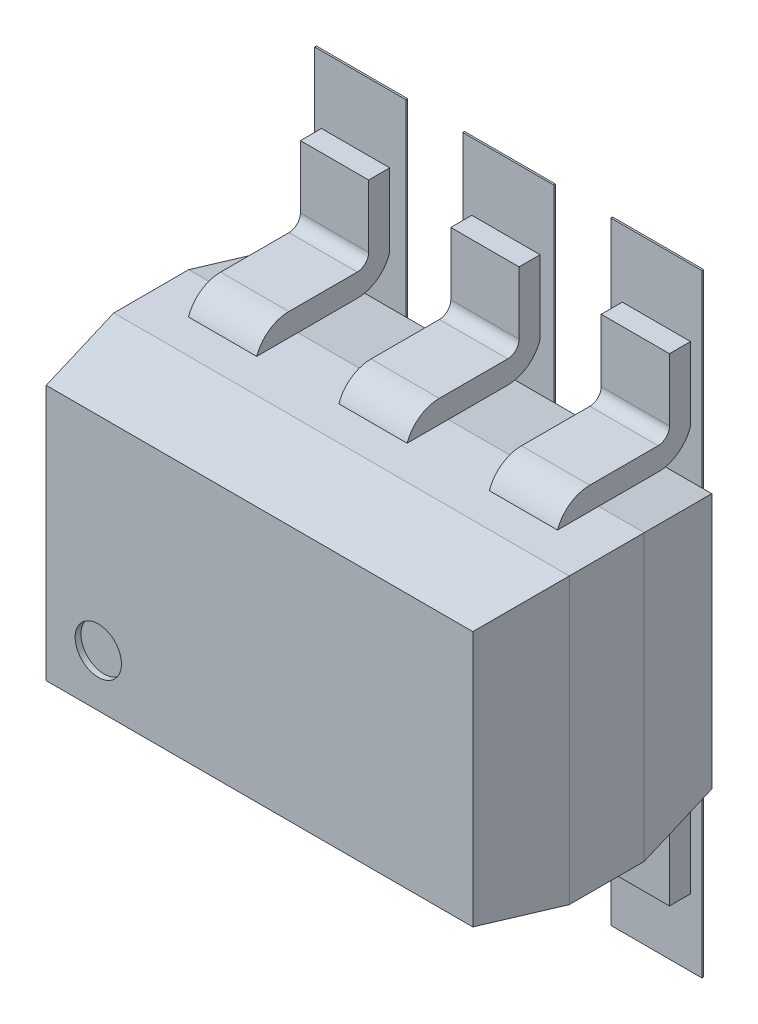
ISO-10303-21;
HEADER;
FILE_DESCRIPTION(('STEP AP214'),'2;1');
FILE_NAME('part.step','',(''),(''),'','','');
FILE_SCHEMA(('AUTOMOTIVE_DESIGN { 1 0 10303 214 1 1 1 1 }'));
ENDSEC;
DATA;
#1=APPLICATION_CONTEXT('core data for automotive mechanical design processes');
#2=APPLICATION_PROTOCOL_DEFINITION('international standard','automotive_design',2000,#1);
#3=PRODUCT_CONTEXT('',#1,'mechanical');
#4=PRODUCT('Part','Part','',(#3));
#5=PRODUCT_RELATED_PRODUCT_CATEGORY('part','',(#4));
#6=PRODUCT_DEFINITION_FORMATION('','',#4);
#7=PRODUCT_DEFINITION_CONTEXT('part definition',#1,'design');
#8=PRODUCT_DEFINITION('design','',#6,#7);
#9=PRODUCT_DEFINITION_SHAPE('','',#8);
#10=(LENGTH_UNIT() NAMED_UNIT(*) SI_UNIT(.MILLI.,.METRE.));
#11=(NAMED_UNIT(*) PLANE_ANGLE_UNIT() SI_UNIT($,.RADIAN.));
#12=(NAMED_UNIT(*) SI_UNIT($,.STERADIAN.) SOLID_ANGLE_UNIT());
#13=UNCERTAINTY_MEASURE_WITH_UNIT(LENGTH_MEASURE(1.E-05),#10,'distance_accuracy_value','');
#14=(GEOMETRIC_REPRESENTATION_CONTEXT(3) GLOBAL_UNCERTAINTY_ASSIGNED_CONTEXT((#13)) GLOBAL_UNIT_ASSIGNED_CONTEXT((#10,
#11,#12)) REPRESENTATION_CONTEXT('',''));
#15=CARTESIAN_POINT('',(0.,0.,0.));
#16=DIRECTION('',(0.,0.,1.));
#17=DIRECTION('',(1.,0.,0.));
#18=AXIS2_PLACEMENT_3D('',#15,#16,#17);
#19=CARTESIAN_POINT('',(0.50013999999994,-1.05000000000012,0.0762));
#20=DIRECTION('',(0.,0.,-1.));
#21=DIRECTION('',(-1.,0.,0.));
#22=AXIS2_PLACEMENT_3D('',#19,#20,#21);
#23=PLANE('',#22);
#24=DIRECTION('',(1.,0.,0.));
#25=VECTOR('',#24,1.);
#26=CARTESIAN_POINT('',(-0.1999996,0.3949954,0.0762));
#27=LINE('',#26,#25);
#28=CARTESIAN_POINT('',(-0.1999996,0.3949954,0.0762));
#29=VERTEX_POINT('',#28);
#30=CARTESIAN_POINT('',(0.1999996,0.3949954,0.0762));
#31=VERTEX_POINT('',#30);
#32=EDGE_CURVE('E913',#29,#31,#27,.T.);
#33=ORIENTED_EDGE('',*,*,#32,.F.);
#34=DIRECTION('',(0.,1.,0.));
#35=VECTOR('',#34,1.);
#36=CARTESIAN_POINT('',(-0.1999996,1.3450062,0.0762));
#37=LINE('',#36,#35);
#38=CARTESIAN_POINT('',(-0.1999996,1.3450062,0.0762));
#39=VERTEX_POINT('',#38);
#40=EDGE_CURVE('E895',#39,#29,#37,.F.);
#41=ORIENTED_EDGE('',*,*,#40,.F.);
#42=DIRECTION('',(1.,0.,0.));
#43=VECTOR('',#42,1.);
#44=CARTESIAN_POINT('',(0.1999996,1.3450062,0.0762));
#45=LINE('',#44,#43);
#46=CARTESIAN_POINT('',(0.1999996,1.3450062,0.0762));
#47=VERTEX_POINT('',#46);
#48=EDGE_CURVE('E903',#47,#39,#45,.F.);
#49=ORIENTED_EDGE('',*,*,#48,.F.);
#50=DIRECTION('',(0.,1.,0.));
#51=VECTOR('',#50,1.);
#52=CARTESIAN_POINT('',(0.1999996,0.3949954,0.0762));
#53=LINE('',#52,#51);
#54=EDGE_CURVE('E908',#31,#47,#53,.T.);
#55=ORIENTED_EDGE('',*,*,#54,.F.);
#56=EDGE_LOOP('',(#33,#41,#49,#55));
#57=FACE_BOUND('',#56,.T.);
#58=ADVANCED_FACE('F16',(#57),#23,.T.);
#59=CARTESIAN_POINT('',(0.50013999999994,-1.05000000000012,0.0762));
#60=DIRECTION('',(0.,0.,-1.));
#61=DIRECTION('',(-1.,0.,0.));
#62=AXIS2_PLACEMENT_3D('',#59,#60,#61);
#63=PLANE('',#62);
#64=DIRECTION('',(1.,0.,0.));
#65=VECTOR('',#64,1.);
#66=CARTESIAN_POINT('',(0.4500118,0.3949954,0.0762));
#67=LINE('',#66,#65);
#68=CARTESIAN_POINT('',(0.4500118,0.3949954,0.0762));
#69=VERTEX_POINT('',#68);
#70=CARTESIAN_POINT('',(0.850011,0.3949954,0.0762));
#71=VERTEX_POINT('',#70);
#72=EDGE_CURVE('E893',#69,#71,#67,.T.);
#73=ORIENTED_EDGE('',*,*,#72,.F.);
#74=DIRECTION('',(0.,1.,0.));
#75=VECTOR('',#74,1.);
#76=CARTESIAN_POINT('',(0.4500118,1.3450062,0.0762));
#77=LINE('',#76,#75);
#78=CARTESIAN_POINT('',(0.4500118,1.3450062,0.0762));
#79=VERTEX_POINT('',#78);
#80=EDGE_CURVE('E875',#79,#69,#77,.F.);
#81=ORIENTED_EDGE('',*,*,#80,.F.);
#82=DIRECTION('',(1.,0.,0.));
#83=VECTOR('',#82,1.);
#84=CARTESIAN_POINT('',(0.850011,1.3450062,0.0762));
#85=LINE('',#84,#83);
#86=CARTESIAN_POINT('',(0.850011,1.3450062,0.0762));
#87=VERTEX_POINT('',#86);
#88=EDGE_CURVE('E883',#87,#79,#85,.F.);
#89=ORIENTED_EDGE('',*,*,#88,.F.);
#90=DIRECTION('',(0.,1.,0.));
#91=VECTOR('',#90,1.);
#92=CARTESIAN_POINT('',(0.850011,0.3949954,0.0762));
#93=LINE('',#92,#91);
#94=EDGE_CURVE('E888',#71,#87,#93,.T.);
#95=ORIENTED_EDGE('',*,*,#94,.F.);
#96=EDGE_LOOP('',(#73,#81,#89,#95));
#97=FACE_BOUND('',#96,.T.);
#98=ADVANCED_FACE('F1877',(#97),#63,.T.);
#99=CARTESIAN_POINT('',(0.50013999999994,-1.05000000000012,0.0762));
#100=DIRECTION('',(0.,0.,-1.));
#101=DIRECTION('',(-1.,0.,0.));
#102=AXIS2_PLACEMENT_3D('',#99,#100,#101);
#103=PLANE('',#102);
#104=DIRECTION('',(1.,0.,0.));
#105=VECTOR('',#104,1.);
#106=CARTESIAN_POINT('',(-0.850011,0.3949954,0.0762));
#107=LINE('',#106,#105);
#108=CARTESIAN_POINT('',(-0.850011,0.3949954,0.0762));
#109=VERTEX_POINT('',#108);
#110=CARTESIAN_POINT('',(-0.4500118,0.3949954,0.0762));
#111=VERTEX_POINT('',#110);
#112=EDGE_CURVE('E873',#109,#111,#107,.T.);
#113=ORIENTED_EDGE('',*,*,#112,.F.);
#114=DIRECTION('',(0.,1.,0.));
#115=VECTOR('',#114,1.);
#116=CARTESIAN_POINT('',(-0.850011,1.3450062,0.0762));
#117=LINE('',#116,#115);
#118=CARTESIAN_POINT('',(-0.850011,1.3450062,0.0762));
#119=VERTEX_POINT('',#118);
#120=EDGE_CURVE('E855',#119,#109,#117,.F.);
#121=ORIENTED_EDGE('',*,*,#120,.F.);
#122=DIRECTION('',(1.,0.,0.));
#123=VECTOR('',#122,1.);
#124=CARTESIAN_POINT('',(-0.4500118,1.3450062,0.0762));
#125=LINE('',#124,#123);
#126=CARTESIAN_POINT('',(-0.4500118,1.3450062,0.0762));
#127=VERTEX_POINT('',#126);
#128=EDGE_CURVE('E863',#127,#119,#125,.F.);
#129=ORIENTED_EDGE('',*,*,#128,.F.);
#130=DIRECTION('',(0.,1.,0.));
#131=VECTOR('',#130,1.);
#132=CARTESIAN_POINT('',(-0.4500118,0.3949954,0.0762));
#133=LINE('',#132,#131);
#134=EDGE_CURVE('E868',#111,#127,#133,.T.);
#135=ORIENTED_EDGE('',*,*,#134,.F.);
#136=EDGE_LOOP('',(#113,#121,#129,#135));
#137=FACE_BOUND('',#136,.T.);
#138=ADVANCED_FACE('F1874',(#137),#103,.T.);
#139=CARTESIAN_POINT('',(0.50013999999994,-1.05000000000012,0.0762));
#140=DIRECTION('',(0.,0.,-1.));
#141=DIRECTION('',(-1.,0.,0.));
#142=AXIS2_PLACEMENT_3D('',#139,#140,#141);
#143=PLANE('',#142);
#144=DIRECTION('',(0.,1.,0.));
#145=VECTOR('',#144,1.);
#146=CARTESIAN_POINT('',(0.1999996,-1.3450062,0.0762));
#147=LINE('',#146,#145);
#148=CARTESIAN_POINT('',(0.1999996,-1.3450062,0.0762));
#149=VERTEX_POINT('',#148);
#150=CARTESIAN_POINT('',(0.1999996,-0.3949954,0.0762));
#151=VERTEX_POINT('',#150);
#152=EDGE_CURVE('E853',#149,#151,#147,.T.);
#153=ORIENTED_EDGE('',*,*,#152,.F.);
#154=DIRECTION('',(1.,0.,0.));
#155=VECTOR('',#154,1.);
#156=CARTESIAN_POINT('',(-0.1999996,-1.3450062,0.0762));
#157=LINE('',#156,#155);
#158=CARTESIAN_POINT('',(-0.1999996,-1.3450062,0.0762));
#159=VERTEX_POINT('',#158);
#160=EDGE_CURVE('E835',#159,#149,#157,.T.);
#161=ORIENTED_EDGE('',*,*,#160,.F.);
#162=DIRECTION('',(0.,1.,0.));
#163=VECTOR('',#162,1.);
#164=CARTESIAN_POINT('',(-0.1999996,-0.3949954,0.0762));
#165=LINE('',#164,#163);
#166=CARTESIAN_POINT('',(-0.1999996,-0.3949954,0.0762));
#167=VERTEX_POINT('',#166);
#168=EDGE_CURVE('E843',#167,#159,#165,.F.);
#169=ORIENTED_EDGE('',*,*,#168,.F.);
#170=DIRECTION('',(1.,0.,0.));
#171=VECTOR('',#170,1.);
#172=CARTESIAN_POINT('',(0.1999996,-0.3949954,0.0762));
#173=LINE('',#172,#171);
#174=EDGE_CURVE('E848',#151,#167,#173,.F.);
#175=ORIENTED_EDGE('',*,*,#174,.F.);
#176=EDGE_LOOP('',(#153,#161,#169,#175));
#177=FACE_BOUND('',#176,.T.);
#178=ADVANCED_FACE('F1870',(#177),#143,.T.);
#179=CARTESIAN_POINT('',(0.50013999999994,-1.05000000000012,0.0762));
#180=DIRECTION('',(0.,0.,-1.));
#181=DIRECTION('',(-1.,0.,0.));
#182=AXIS2_PLACEMENT_3D('',#179,#180,#181);
#183=PLANE('',#182);
#184=DIRECTION('',(1.,0.,0.));
#185=VECTOR('',#184,1.);
#186=CARTESIAN_POINT('',(0.4500118,-1.3450062,0.0762));
#187=LINE('',#186,#185);
#188=CARTESIAN_POINT('',(0.4500118,-1.3450062,0.0762));
#189=VERTEX_POINT('',#188);
#190=CARTESIAN_POINT('',(0.850011,-1.3450062,0.0762));
#191=VERTEX_POINT('',#190);
#192=EDGE_CURVE('E833',#189,#191,#187,.T.);
#193=ORIENTED_EDGE('',*,*,#192,.F.);
#194=DIRECTION('',(0.,1.,0.));
#195=VECTOR('',#194,1.);
#196=CARTESIAN_POINT('',(0.4500118,-0.3949954,0.0762));
#197=LINE('',#196,#195);
#198=CARTESIAN_POINT('',(0.4500118,-0.3949954,0.0762));
#199=VERTEX_POINT('',#198);
#200=EDGE_CURVE('E815',#199,#189,#197,.F.);
#201=ORIENTED_EDGE('',*,*,#200,.F.);
#202=DIRECTION('',(1.,0.,0.));
#203=VECTOR('',#202,1.);
#204=CARTESIAN_POINT('',(0.850011,-0.3949954,0.0762));
#205=LINE('',#204,#203);
#206=CARTESIAN_POINT('',(0.850011,-0.3949954,0.0762));
#207=VERTEX_POINT('',#206);
#208=EDGE_CURVE('E823',#207,#199,#205,.F.);
#209=ORIENTED_EDGE('',*,*,#208,.F.);
#210=DIRECTION('',(0.,1.,0.));
#211=VECTOR('',#210,1.);
#212=CARTESIAN_POINT('',(0.850011,-1.3450062,0.0762));
#213=LINE('',#212,#211);
#214=EDGE_CURVE('E828',#191,#207,#213,.T.);
#215=ORIENTED_EDGE('',*,*,#214,.F.);
#216=EDGE_LOOP('',(#193,#201,#209,#215));
#217=FACE_BOUND('',#216,.T.);
#218=ADVANCED_FACE('F1867',(#217),#183,.T.);
#219=CARTESIAN_POINT('',(1.00000000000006,0.62500000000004,0.0762));
#220=DIRECTION('',(0.,1.,0.));
#221=DIRECTION('',(0.,0.,1.));
#222=AXIS2_PLACEMENT_3D('',#219,#220,#221);
#223=PLANE('',#222);
#224=DIRECTION('',(1.,0.,0.));
#225=VECTOR('',#224,1.);
#226=CARTESIAN_POINT('',(1.00000000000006,0.62500000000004,0.667658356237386));
#227=LINE('',#226,#225);
#228=CARTESIAN_POINT('',(-0.52094000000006,0.62500000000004,0.667658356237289));
#229=VERTEX_POINT('',#228);
#230=CARTESIAN_POINT('',(-0.82066000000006,0.62500000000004,0.667658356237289));
#231=VERTEX_POINT('',#230);
#232=EDGE_CURVE('E916',#229,#231,#227,.F.);
#233=ORIENTED_EDGE('',*,*,#232,.T.);
#234=DIRECTION('',(0.,0.,1.));
#235=VECTOR('',#234,1.);
#236=CARTESIAN_POINT('',(-0.82066000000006,0.62500000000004,0.0762));
#237=LINE('',#236,#235);
#238=CARTESIAN_POINT('',(-0.82066000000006,0.625000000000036,0.487126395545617));
#239=VERTEX_POINT('',#238);
#240=EDGE_CURVE('E915',#231,#239,#237,.F.);
#241=ORIENTED_EDGE('',*,*,#240,.T.);
#242=DIRECTION('',(1.,0.,0.));
#243=VECTOR('',#242,1.);
#244=CARTESIAN_POINT('',(1.00000000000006,0.62500000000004,0.487126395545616));
#245=LINE('',#244,#243);
#246=CARTESIAN_POINT('',(-1.00000000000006,0.62500000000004,0.487126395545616));
#247=VERTEX_POINT('',#246);
#248=EDGE_CURVE('E922',#239,#247,#245,.F.);
#249=ORIENTED_EDGE('',*,*,#248,.T.);
#250=DIRECTION('',(0.,0.,1.));
#251=VECTOR('',#250,1.);
#252=CARTESIAN_POINT('',(-1.00000000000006,0.62500000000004,0.0762));
#253=LINE('',#252,#251);
#254=CARTESIAN_POINT('',(-1.00000000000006,0.625000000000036,0.816147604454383));
#255=VERTEX_POINT('',#254);
#256=EDGE_CURVE('E924',#247,#255,#253,.T.);
#257=ORIENTED_EDGE('',*,*,#256,.T.);
#258=DIRECTION('',(1.,0.,0.));
#259=VECTOR('',#258,1.);
#260=CARTESIAN_POINT('',(0.,0.625000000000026,0.816147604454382));
#261=LINE('',#260,#259);
#262=CARTESIAN_POINT('',(1.00000000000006,0.62500000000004,0.816147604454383));
#263=VERTEX_POINT('',#262);
#264=EDGE_CURVE('E977',#263,#255,#261,.F.);
#265=ORIENTED_EDGE('',*,*,#264,.F.);
#266=DIRECTION('',(0.,0.,1.));
#267=VECTOR('',#266,1.);
#268=CARTESIAN_POINT('',(1.00000000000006,0.62500000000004,0.0762));
#269=LINE('',#268,#267);
#270=CARTESIAN_POINT('',(1.00000000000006,0.62500000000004,0.487126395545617));
#271=VERTEX_POINT('',#270);
#272=EDGE_CURVE('E960',#263,#271,#269,.F.);
#273=ORIENTED_EDGE('',*,*,#272,.T.);
#274=DIRECTION('',(1.,0.,0.));
#275=VECTOR('',#274,1.);
#276=CARTESIAN_POINT('',(1.00000000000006,0.62500000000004,0.487126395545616));
#277=LINE('',#276,#275);
#278=CARTESIAN_POINT('',(0.79985999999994,0.625000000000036,0.487126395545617));
#279=VERTEX_POINT('',#278);
#280=EDGE_CURVE('E956',#271,#279,#277,.F.);
#281=ORIENTED_EDGE('',*,*,#280,.T.);
#282=DIRECTION('',(0.,0.,1.));
#283=VECTOR('',#282,1.);
#284=CARTESIAN_POINT('',(0.79985999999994,0.62500000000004,0.0762));
#285=LINE('',#284,#283);
#286=CARTESIAN_POINT('',(0.79985999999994,0.62500000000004,0.667658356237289));
#287=VERTEX_POINT('',#286);
#288=EDGE_CURVE('E954',#279,#287,#285,.T.);
#289=ORIENTED_EDGE('',*,*,#288,.T.);
#290=DIRECTION('',(1.,0.,0.));
#291=VECTOR('',#290,1.);
#292=CARTESIAN_POINT('',(1.00000000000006,0.62500000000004,0.667658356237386));
#293=LINE('',#292,#291);
#294=CARTESIAN_POINT('',(0.50013999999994,0.62500000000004,0.667658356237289));
#295=VERTEX_POINT('',#294);
#296=EDGE_CURVE('E950',#287,#295,#293,.F.);
#297=ORIENTED_EDGE('',*,*,#296,.T.);
#298=DIRECTION('',(0.,0.,1.));
#299=VECTOR('',#298,1.);
#300=CARTESIAN_POINT('',(0.50013999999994,0.62500000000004,0.0762));
#301=LINE('',#300,#299);
#302=CARTESIAN_POINT('',(0.50013999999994,0.625000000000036,0.487126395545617));
#303=VERTEX_POINT('',#302);
#304=EDGE_CURVE('E946',#295,#303,#301,.F.);
#305=ORIENTED_EDGE('',*,*,#304,.T.);
#306=DIRECTION('',(1.,0.,0.));
#307=VECTOR('',#306,1.);
#308=CARTESIAN_POINT('',(1.00000000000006,0.62500000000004,0.487126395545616));
#309=LINE('',#308,#307);
#310=CARTESIAN_POINT('',(0.139459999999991,0.625000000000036,0.487126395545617));
#311=VERTEX_POINT('',#310);
#312=EDGE_CURVE('E942',#303,#311,#309,.F.);
#313=ORIENTED_EDGE('',*,*,#312,.T.);
#314=DIRECTION('',(0.,0.,1.));
#315=VECTOR('',#314,1.);
#316=CARTESIAN_POINT('',(0.139459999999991,0.62500000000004,0.0762));
#317=LINE('',#316,#315);
#318=CARTESIAN_POINT('',(0.139459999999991,0.62500000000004,0.667658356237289));
#319=VERTEX_POINT('',#318);
#320=EDGE_CURVE('E940',#311,#319,#317,.T.);
#321=ORIENTED_EDGE('',*,*,#320,.T.);
#322=DIRECTION('',(1.,0.,0.));
#323=VECTOR('',#322,1.);
#324=CARTESIAN_POINT('',(1.00000000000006,0.62500000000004,0.667658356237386));
#325=LINE('',#324,#323);
#326=CARTESIAN_POINT('',(-0.160260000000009,0.62500000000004,0.667658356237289));
#327=VERTEX_POINT('',#326);
#328=EDGE_CURVE('E936',#319,#327,#325,.F.);
#329=ORIENTED_EDGE('',*,*,#328,.T.);
#330=DIRECTION('',(0.,0.,1.));
#331=VECTOR('',#330,1.);
#332=CARTESIAN_POINT('',(-0.160260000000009,0.62500000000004,0.0762));
#333=LINE('',#332,#331);
#334=CARTESIAN_POINT('',(-0.160260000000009,0.625000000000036,0.487126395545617));
#335=VERTEX_POINT('',#334);
#336=EDGE_CURVE('E932',#327,#335,#333,.F.);
#337=ORIENTED_EDGE('',*,*,#336,.T.);
#338=DIRECTION('',(1.,0.,0.));
#339=VECTOR('',#338,1.);
#340=CARTESIAN_POINT('',(1.00000000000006,0.62500000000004,0.487126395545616));
#341=LINE('',#340,#339);
#342=CARTESIAN_POINT('',(-0.52094000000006,0.625000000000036,0.487126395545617));
#343=VERTEX_POINT('',#342);
#344=EDGE_CURVE('E928',#335,#343,#341,.F.);
#345=ORIENTED_EDGE('',*,*,#344,.T.);
#346=DIRECTION('',(0.,0.,1.));
#347=VECTOR('',#346,1.);
#348=CARTESIAN_POINT('',(-0.52094000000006,0.62500000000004,0.0762));
#349=LINE('',#348,#347);
#350=EDGE_CURVE('E918',#343,#229,#349,.T.);
#351=ORIENTED_EDGE('',*,*,#350,.T.);
#352=EDGE_LOOP('',(#233,#241,#249,#257,#265,#273,#281,#289,#297,#305,#313,#321,#329,#337,#345,#351));
#353=FACE_BOUND('',#352,.T.);
#354=ADVANCED_FACE('F1123',(#353),#223,.T.);
#355=CARTESIAN_POINT('',(0.,0.,1.150874));
#356=DIRECTION('',(0.,0.,1.));
#357=DIRECTION('',(1.,0.,0.));
#358=AXIS2_PLACEMENT_3D('',#355,#356,#357);
#359=PLANE('',#358);
#360=CARTESIAN_POINT('',(-0.707900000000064,-0.33290000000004,1.150874));
#361=DIRECTION('',(0.,0.,1.));
#362=DIRECTION('',(1.,0.,0.));
#363=AXIS2_PLACEMENT_3D('',#360,#361,#362);
#364=CIRCLE('',#363,0.1016);
#365=CARTESIAN_POINT('',(-0.606300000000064,-0.33290000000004,1.150874));
#366=VERTEX_POINT('',#365);
#367=EDGE_CURVE('E19',#366,#366,#364,.T.);
#368=ORIENTED_EDGE('',*,*,#367,.T.);
#369=EDGE_LOOP('',(#368));
#370=FACE_BOUND('',#369,.T.);
#371=ADVANCED_FACE('F1860',(#370),#359,.T.);
#372=CARTESIAN_POINT('',(0.50013999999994,-1.05000000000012,0.0762));
#373=DIRECTION('',(0.,0.,-1.));
#374=DIRECTION('',(-1.,0.,0.));
#375=AXIS2_PLACEMENT_3D('',#372,#373,#374);
#376=PLANE('',#375);
#377=DIRECTION('',(1.,0.,0.));
#378=VECTOR('',#377,1.);
#379=CARTESIAN_POINT('',(-0.850011,-1.3450062,0.0762));
#380=LINE('',#379,#378);
#381=CARTESIAN_POINT('',(-0.850011,-1.3450062,0.0762));
#382=VERTEX_POINT('',#381);
#383=CARTESIAN_POINT('',(-0.4500118,-1.3450062,0.0762));
#384=VERTEX_POINT('',#383);
#385=EDGE_CURVE('E810',#382,#384,#380,.T.);
#386=ORIENTED_EDGE('',*,*,#385,.F.);
#387=DIRECTION('',(0.,1.,0.));
#388=VECTOR('',#387,1.);
#389=CARTESIAN_POINT('',(-0.850011,-0.3949954,0.0762));
#390=LINE('',#389,#388);
#391=CARTESIAN_POINT('',(-0.850011,-0.3949954,0.0762));
#392=VERTEX_POINT('',#391);
#393=EDGE_CURVE('E785',#392,#382,#390,.F.);
#394=ORIENTED_EDGE('',*,*,#393,.F.);
#395=DIRECTION('',(1.,0.,0.));
#396=VECTOR('',#395,1.);
#397=CARTESIAN_POINT('',(-0.4500118,-0.3949954,0.0762));
#398=LINE('',#397,#396);
#399=CARTESIAN_POINT('',(-0.4500118,-0.3949954,0.0762));
#400=VERTEX_POINT('',#399);
#401=EDGE_CURVE('E800',#400,#392,#398,.F.);
#402=ORIENTED_EDGE('',*,*,#401,.F.);
#403=DIRECTION('',(0.,1.,0.));
#404=VECTOR('',#403,1.);
#405=CARTESIAN_POINT('',(-0.4500118,-1.3450062,0.0762));
#406=LINE('',#405,#404);
#407=EDGE_CURVE('E805',#384,#400,#406,.T.);
#408=ORIENTED_EDGE('',*,*,#407,.F.);
#409=EDGE_LOOP('',(#386,#394,#402,#408));
#410=FACE_BOUND('',#409,.T.);
#411=ADVANCED_FACE('F1856',(#410),#376,.T.);
#412=CARTESIAN_POINT('',(-0.1999996,0.3949954,0.0762));
#413=DIRECTION('',(0.,-1.,0.));
#414=DIRECTION('',(0.,0.,-1.));
#415=AXIS2_PLACEMENT_3D('',#412,#413,#414);
#416=PLANE('',#415);
#417=DIRECTION('',(0.,0.,1.));
#418=VECTOR('',#417,1.);
#419=CARTESIAN_POINT('',(-0.1999996,0.3949954,0.0762));
#420=LINE('',#419,#418);
#421=CARTESIAN_POINT('',(-0.1999996,0.3949954,0.08382));
#422=VERTEX_POINT('',#421);
#423=EDGE_CURVE('E901',#29,#422,#420,.T.);
#424=ORIENTED_EDGE('',*,*,#423,.F.);
#425=ORIENTED_EDGE('',*,*,#32,.T.);
#426=DIRECTION('',(0.,0.,-1.));
#427=VECTOR('',#426,1.);
#428=CARTESIAN_POINT('',(0.1999996,0.3949954,0.0762));
#429=LINE('',#428,#427);
#430=CARTESIAN_POINT('',(0.1999996,0.3949954,0.08382));
#431=VERTEX_POINT('',#430);
#432=EDGE_CURVE('E910',#431,#31,#429,.T.);
#433=ORIENTED_EDGE('',*,*,#432,.F.);
#434=DIRECTION('',(1.,0.,0.));
#435=VECTOR('',#434,1.);
#436=CARTESIAN_POINT('',(0.,0.3949954,0.08382));
#437=LINE('',#436,#435);
#438=EDGE_CURVE('E768',#422,#431,#437,.T.);
#439=ORIENTED_EDGE('',*,*,#438,.F.);
#440=EDGE_LOOP('',(#424,#425,#433,#439));
#441=FACE_BOUND('',#440,.T.);
#442=ADVANCED_FACE('F1852',(#441),#416,.T.);
#443=CARTESIAN_POINT('',(0.1999996,0.3949954,0.0762));
#444=DIRECTION('',(1.,0.,0.));
#445=DIRECTION('',(0.,0.,-1.));
#446=AXIS2_PLACEMENT_3D('',#443,#444,#445);
#447=PLANE('',#446);
#448=ORIENTED_EDGE('',*,*,#432,.T.);
#449=ORIENTED_EDGE('',*,*,#54,.T.);
#450=DIRECTION('',(0.,0.,1.));
#451=VECTOR('',#450,1.);
#452=CARTESIAN_POINT('',(0.1999996,1.3450062,0.0762));
#453=LINE('',#452,#451);
#454=CARTESIAN_POINT('',(0.1999996,1.3450062,0.08382));
#455=VERTEX_POINT('',#454);
#456=EDGE_CURVE('E905',#455,#47,#453,.F.);
#457=ORIENTED_EDGE('',*,*,#456,.F.);
#458=DIRECTION('',(0.,1.,0.));
#459=VECTOR('',#458,1.);
#460=CARTESIAN_POINT('',(0.1999996,0.,0.08382));
#461=LINE('',#460,#459);
#462=EDGE_CURVE('E766',#431,#455,#461,.T.);
#463=ORIENTED_EDGE('',*,*,#462,.F.);
#464=EDGE_LOOP('',(#448,#449,#457,#463));
#465=FACE_BOUND('',#464,.T.);
#466=ADVANCED_FACE('F1848',(#465),#447,.T.);
#467=CARTESIAN_POINT('',(0.1999996,1.3450062,0.0762));
#468=DIRECTION('',(0.,1.,0.));
#469=DIRECTION('',(0.,0.,1.));
#470=AXIS2_PLACEMENT_3D('',#467,#468,#469);
#471=PLANE('',#470);
#472=ORIENTED_EDGE('',*,*,#456,.T.);
#473=ORIENTED_EDGE('',*,*,#48,.T.);
#474=DIRECTION('',(0.,0.,1.));
#475=VECTOR('',#474,1.);
#476=CARTESIAN_POINT('',(-0.1999996,1.3450062,0.0762));
#477=LINE('',#476,#475);
#478=CARTESIAN_POINT('',(-0.1999996,1.3450062,0.08382));
#479=VERTEX_POINT('',#478);
#480=EDGE_CURVE('E898',#479,#39,#477,.F.);
#481=ORIENTED_EDGE('',*,*,#480,.F.);
#482=DIRECTION('',(1.,0.,0.));
#483=VECTOR('',#482,1.);
#484=CARTESIAN_POINT('',(0.,1.3450062,0.08382));
#485=LINE('',#484,#483);
#486=EDGE_CURVE('E764',#455,#479,#485,.F.);
#487=ORIENTED_EDGE('',*,*,#486,.F.);
#488=EDGE_LOOP('',(#472,#473,#481,#487));
#489=FACE_BOUND('',#488,.T.);
#490=ADVANCED_FACE('F1844',(#489),#471,.T.);
#491=CARTESIAN_POINT('',(-0.1999996,1.3450062,0.0762));
#492=DIRECTION('',(-1.,0.,0.));
#493=DIRECTION('',(0.,0.,1.));
#494=AXIS2_PLACEMENT_3D('',#491,#492,#493);
#495=PLANE('',#494);
#496=ORIENTED_EDGE('',*,*,#480,.T.);
#497=ORIENTED_EDGE('',*,*,#40,.T.);
#498=ORIENTED_EDGE('',*,*,#423,.T.);
#499=DIRECTION('',(0.,1.,0.));
#500=VECTOR('',#499,1.);
#501=CARTESIAN_POINT('',(-0.1999996,0.,0.08382));
#502=LINE('',#501,#500);
#503=EDGE_CURVE('E761',#479,#422,#502,.F.);
#504=ORIENTED_EDGE('',*,*,#503,.F.);
#505=EDGE_LOOP('',(#496,#497,#498,#504));
#506=FACE_BOUND('',#505,.T.);
#507=ADVANCED_FACE('F1840',(#506),#495,.T.);
#508=CARTESIAN_POINT('',(0.4500118,0.3949954,0.0762));
#509=DIRECTION('',(0.,-1.,0.));
#510=DIRECTION('',(0.,0.,-1.));
#511=AXIS2_PLACEMENT_3D('',#508,#509,#510);
#512=PLANE('',#511);
#513=DIRECTION('',(0.,0.,1.));
#514=VECTOR('',#513,1.);
#515=CARTESIAN_POINT('',(0.4500118,0.3949954,0.0762));
#516=LINE('',#515,#514);
#517=CARTESIAN_POINT('',(0.4500118,0.3949954,0.08382));
#518=VERTEX_POINT('',#517);
#519=EDGE_CURVE('E881',#69,#518,#516,.T.);
#520=ORIENTED_EDGE('',*,*,#519,.F.);
#521=ORIENTED_EDGE('',*,*,#72,.T.);
#522=DIRECTION('',(0.,0.,-1.));
#523=VECTOR('',#522,1.);
#524=CARTESIAN_POINT('',(0.850011,0.3949954,0.0762));
#525=LINE('',#524,#523);
#526=CARTESIAN_POINT('',(0.850011,0.3949954,0.08382));
#527=VERTEX_POINT('',#526);
#528=EDGE_CURVE('E890',#527,#71,#525,.T.);
#529=ORIENTED_EDGE('',*,*,#528,.F.);
#530=DIRECTION('',(1.,0.,0.));
#531=VECTOR('',#530,1.);
#532=CARTESIAN_POINT('',(0.,0.3949954,0.08382));
#533=LINE('',#532,#531);
#534=EDGE_CURVE('E729',#518,#527,#533,.T.);
#535=ORIENTED_EDGE('',*,*,#534,.F.);
#536=EDGE_LOOP('',(#520,#521,#529,#535));
#537=FACE_BOUND('',#536,.T.);
#538=ADVANCED_FACE('F1836',(#537),#512,.T.);
#539=CARTESIAN_POINT('',(0.850011,0.3949954,0.0762));
#540=DIRECTION('',(1.,0.,0.));
#541=DIRECTION('',(0.,0.,-1.));
#542=AXIS2_PLACEMENT_3D('',#539,#540,#541);
#543=PLANE('',#542);
#544=ORIENTED_EDGE('',*,*,#528,.T.);
#545=ORIENTED_EDGE('',*,*,#94,.T.);
#546=DIRECTION('',(0.,0.,1.));
#547=VECTOR('',#546,1.);
#548=CARTESIAN_POINT('',(0.850011,1.3450062,0.0762));
#549=LINE('',#548,#547);
#550=CARTESIAN_POINT('',(0.850011,1.3450062,0.08382));
#551=VERTEX_POINT('',#550);
#552=EDGE_CURVE('E885',#551,#87,#549,.F.);
#553=ORIENTED_EDGE('',*,*,#552,.F.);
#554=DIRECTION('',(0.,1.,0.));
#555=VECTOR('',#554,1.);
#556=CARTESIAN_POINT('',(0.850011,0.,0.08382));
#557=LINE('',#556,#555);
#558=EDGE_CURVE('E727',#527,#551,#557,.T.);
#559=ORIENTED_EDGE('',*,*,#558,.F.);
#560=EDGE_LOOP('',(#544,#545,#553,#559));
#561=FACE_BOUND('',#560,.T.);
#562=ADVANCED_FACE('F1832',(#561),#543,.T.);
#563=CARTESIAN_POINT('',(0.850011,1.3450062,0.0762));
#564=DIRECTION('',(0.,1.,0.));
#565=DIRECTION('',(0.,0.,1.));
#566=AXIS2_PLACEMENT_3D('',#563,#564,#565);
#567=PLANE('',#566);
#568=ORIENTED_EDGE('',*,*,#552,.T.);
#569=ORIENTED_EDGE('',*,*,#88,.T.);
#570=DIRECTION('',(0.,0.,1.));
#571=VECTOR('',#570,1.);
#572=CARTESIAN_POINT('',(0.4500118,1.3450062,0.0762));
#573=LINE('',#572,#571);
#574=CARTESIAN_POINT('',(0.4500118,1.3450062,0.08382));
#575=VERTEX_POINT('',#574);
#576=EDGE_CURVE('E878',#575,#79,#573,.F.);
#577=ORIENTED_EDGE('',*,*,#576,.F.);
#578=DIRECTION('',(1.,0.,0.));
#579=VECTOR('',#578,1.);
#580=CARTESIAN_POINT('',(0.,1.3450062,0.08382));
#581=LINE('',#580,#579);
#582=EDGE_CURVE('E725',#551,#575,#581,.F.);
#583=ORIENTED_EDGE('',*,*,#582,.F.);
#584=EDGE_LOOP('',(#568,#569,#577,#583));
#585=FACE_BOUND('',#584,.T.);
#586=ADVANCED_FACE('F1828',(#585),#567,.T.);
#587=CARTESIAN_POINT('',(0.4500118,1.3450062,0.0762));
#588=DIRECTION('',(-1.,0.,0.));
#589=DIRECTION('',(0.,0.,1.));
#590=AXIS2_PLACEMENT_3D('',#587,#588,#589);
#591=PLANE('',#590);
#592=ORIENTED_EDGE('',*,*,#576,.T.);
#593=ORIENTED_EDGE('',*,*,#80,.T.);
#594=ORIENTED_EDGE('',*,*,#519,.T.);
#595=DIRECTION('',(0.,1.,0.));
#596=VECTOR('',#595,1.);
#597=CARTESIAN_POINT('',(0.4500118,0.,0.08382));
#598=LINE('',#597,#596);
#599=EDGE_CURVE('E722',#575,#518,#598,.F.);
#600=ORIENTED_EDGE('',*,*,#599,.F.);
#601=EDGE_LOOP('',(#592,#593,#594,#600));
#602=FACE_BOUND('',#601,.T.);
#603=ADVANCED_FACE('F1824',(#602),#591,.T.);
#604=CARTESIAN_POINT('',(-0.850011,0.3949954,0.0762));
#605=DIRECTION('',(0.,-1.,0.));
#606=DIRECTION('',(0.,0.,-1.));
#607=AXIS2_PLACEMENT_3D('',#604,#605,#606);
#608=PLANE('',#607);
#609=DIRECTION('',(0.,0.,1.));
#610=VECTOR('',#609,1.);
#611=CARTESIAN_POINT('',(-0.850011,0.3949954,0.0762));
#612=LINE('',#611,#610);
#613=CARTESIAN_POINT('',(-0.850011,0.3949954,0.08382));
#614=VERTEX_POINT('',#613);
#615=EDGE_CURVE('E861',#109,#614,#612,.T.);
#616=ORIENTED_EDGE('',*,*,#615,.F.);
#617=ORIENTED_EDGE('',*,*,#112,.T.);
#618=DIRECTION('',(0.,0.,-1.));
#619=VECTOR('',#618,1.);
#620=CARTESIAN_POINT('',(-0.4500118,0.3949954,0.0762));
#621=LINE('',#620,#619);
#622=CARTESIAN_POINT('',(-0.4500118,0.3949954,0.08382));
#623=VERTEX_POINT('',#622);
#624=EDGE_CURVE('E870',#623,#111,#621,.T.);
#625=ORIENTED_EDGE('',*,*,#624,.F.);
#626=DIRECTION('',(1.,0.,0.));
#627=VECTOR('',#626,1.);
#628=CARTESIAN_POINT('',(0.,0.3949954,0.08382));
#629=LINE('',#628,#627);
#630=EDGE_CURVE('E690',#614,#623,#629,.T.);
#631=ORIENTED_EDGE('',*,*,#630,.F.);
#632=EDGE_LOOP('',(#616,#617,#625,#631));
#633=FACE_BOUND('',#632,.T.);
#634=ADVANCED_FACE('F1820',(#633),#608,.T.);
#635=CARTESIAN_POINT('',(-0.4500118,0.3949954,0.0762));
#636=DIRECTION('',(1.,0.,0.));
#637=DIRECTION('',(0.,0.,-1.));
#638=AXIS2_PLACEMENT_3D('',#635,#636,#637);
#639=PLANE('',#638);
#640=ORIENTED_EDGE('',*,*,#624,.T.);
#641=ORIENTED_EDGE('',*,*,#134,.T.);
#642=DIRECTION('',(0.,0.,1.));
#643=VECTOR('',#642,1.);
#644=CARTESIAN_POINT('',(-0.4500118,1.3450062,0.0762));
#645=LINE('',#644,#643);
#646=CARTESIAN_POINT('',(-0.4500118,1.3450062,0.08382));
#647=VERTEX_POINT('',#646);
#648=EDGE_CURVE('E865',#647,#127,#645,.F.);
#649=ORIENTED_EDGE('',*,*,#648,.F.);
#650=DIRECTION('',(0.,1.,0.));
#651=VECTOR('',#650,1.);
#652=CARTESIAN_POINT('',(-0.4500118,0.,0.08382));
#653=LINE('',#652,#651);
#654=EDGE_CURVE('E688',#623,#647,#653,.T.);
#655=ORIENTED_EDGE('',*,*,#654,.F.);
#656=EDGE_LOOP('',(#640,#641,#649,#655));
#657=FACE_BOUND('',#656,.T.);
#658=ADVANCED_FACE('F1816',(#657),#639,.T.);
#659=CARTESIAN_POINT('',(-0.4500118,1.3450062,0.0762));
#660=DIRECTION('',(0.,1.,0.));
#661=DIRECTION('',(0.,0.,1.));
#662=AXIS2_PLACEMENT_3D('',#659,#660,#661);
#663=PLANE('',#662);
#664=ORIENTED_EDGE('',*,*,#648,.T.);
#665=ORIENTED_EDGE('',*,*,#128,.T.);
#666=DIRECTION('',(0.,0.,1.));
#667=VECTOR('',#666,1.);
#668=CARTESIAN_POINT('',(-0.850011,1.3450062,0.0762));
#669=LINE('',#668,#667);
#670=CARTESIAN_POINT('',(-0.850011,1.3450062,0.08382));
#671=VERTEX_POINT('',#670);
#672=EDGE_CURVE('E858',#671,#119,#669,.F.);
#673=ORIENTED_EDGE('',*,*,#672,.F.);
#674=DIRECTION('',(1.,0.,0.));
#675=VECTOR('',#674,1.);
#676=CARTESIAN_POINT('',(0.,1.3450062,0.08382));
#677=LINE('',#676,#675);
#678=EDGE_CURVE('E686',#647,#671,#677,.F.);
#679=ORIENTED_EDGE('',*,*,#678,.F.);
#680=EDGE_LOOP('',(#664,#665,#673,#679));
#681=FACE_BOUND('',#680,.T.);
#682=ADVANCED_FACE('F1812',(#681),#663,.T.);
#683=CARTESIAN_POINT('',(-0.850011,1.3450062,0.0762));
#684=DIRECTION('',(-1.,0.,0.));
#685=DIRECTION('',(0.,0.,1.));
#686=AXIS2_PLACEMENT_3D('',#683,#684,#685);
#687=PLANE('',#686);
#688=ORIENTED_EDGE('',*,*,#672,.T.);
#689=ORIENTED_EDGE('',*,*,#120,.T.);
#690=ORIENTED_EDGE('',*,*,#615,.T.);
#691=DIRECTION('',(0.,1.,0.));
#692=VECTOR('',#691,1.);
#693=CARTESIAN_POINT('',(-0.850011,0.,0.08382));
#694=LINE('',#693,#692);
#695=EDGE_CURVE('E683',#671,#614,#694,.F.);
#696=ORIENTED_EDGE('',*,*,#695,.F.);
#697=EDGE_LOOP('',(#688,#689,#690,#696));
#698=FACE_BOUND('',#697,.T.);
#699=ADVANCED_FACE('F1808',(#698),#687,.T.);
#700=CARTESIAN_POINT('',(0.1999996,-1.3450062,0.0762));
#701=DIRECTION('',(1.,0.,0.));
#702=DIRECTION('',(0.,0.,-1.));
#703=AXIS2_PLACEMENT_3D('',#700,#701,#702);
#704=PLANE('',#703);
#705=DIRECTION('',(0.,0.,-1.));
#706=VECTOR('',#705,1.);
#707=CARTESIAN_POINT('',(0.1999996,-1.3450062,0.0762));
#708=LINE('',#707,#706);
#709=CARTESIAN_POINT('',(0.1999996,-1.3450062,0.08382));
#710=VERTEX_POINT('',#709);
#711=EDGE_CURVE('E841',#149,#710,#708,.F.);
#712=ORIENTED_EDGE('',*,*,#711,.F.);
#713=ORIENTED_EDGE('',*,*,#152,.T.);
#714=DIRECTION('',(0.,0.,1.));
#715=VECTOR('',#714,1.);
#716=CARTESIAN_POINT('',(0.1999996,-0.3949954,0.0762));
#717=LINE('',#716,#715);
#718=CARTESIAN_POINT('',(0.1999996,-0.3949954,0.08382));
#719=VERTEX_POINT('',#718);
#720=EDGE_CURVE('E850',#719,#151,#717,.F.);
#721=ORIENTED_EDGE('',*,*,#720,.F.);
#722=DIRECTION('',(0.,1.,0.));
#723=VECTOR('',#722,1.);
#724=CARTESIAN_POINT('',(0.1999996,0.,0.08382));
#725=LINE('',#724,#723);
#726=EDGE_CURVE('E650',#710,#719,#725,.T.);
#727=ORIENTED_EDGE('',*,*,#726,.F.);
#728=EDGE_LOOP('',(#712,#713,#721,#727));
#729=FACE_BOUND('',#728,.T.);
#730=ADVANCED_FACE('F1804',(#729),#704,.T.);
#731=CARTESIAN_POINT('',(0.1999996,-0.3949954,0.0762));
#732=DIRECTION('',(0.,1.,0.));
#733=DIRECTION('',(0.,0.,1.));
#734=AXIS2_PLACEMENT_3D('',#731,#732,#733);
#735=PLANE('',#734);
#736=ORIENTED_EDGE('',*,*,#720,.T.);
#737=ORIENTED_EDGE('',*,*,#174,.T.);
#738=DIRECTION('',(0.,0.,1.));
#739=VECTOR('',#738,1.);
#740=CARTESIAN_POINT('',(-0.1999996,-0.3949954,0.0762));
#741=LINE('',#740,#739);
#742=CARTESIAN_POINT('',(-0.1999996,-0.3949954,0.08382));
#743=VERTEX_POINT('',#742);
#744=EDGE_CURVE('E845',#743,#167,#741,.F.);
#745=ORIENTED_EDGE('',*,*,#744,.F.);
#746=DIRECTION('',(1.,0.,0.));
#747=VECTOR('',#746,1.);
#748=CARTESIAN_POINT('',(0.,-0.3949954,0.08382));
#749=LINE('',#748,#747);
#750=EDGE_CURVE('E648',#719,#743,#749,.F.);
#751=ORIENTED_EDGE('',*,*,#750,.F.);
#752=EDGE_LOOP('',(#736,#737,#745,#751));
#753=FACE_BOUND('',#752,.T.);
#754=ADVANCED_FACE('F1800',(#753),#735,.T.);
#755=CARTESIAN_POINT('',(-0.1999996,-0.3949954,0.0762));
#756=DIRECTION('',(-1.,0.,0.));
#757=DIRECTION('',(0.,0.,1.));
#758=AXIS2_PLACEMENT_3D('',#755,#756,#757);
#759=PLANE('',#758);
#760=ORIENTED_EDGE('',*,*,#744,.T.);
#761=ORIENTED_EDGE('',*,*,#168,.T.);
#762=DIRECTION('',(0.,0.,-1.));
#763=VECTOR('',#762,1.);
#764=CARTESIAN_POINT('',(-0.1999996,-1.3450062,0.0762));
#765=LINE('',#764,#763);
#766=CARTESIAN_POINT('',(-0.1999996,-1.3450062,0.08382));
#767=VERTEX_POINT('',#766);
#768=EDGE_CURVE('E838',#767,#159,#765,.T.);
#769=ORIENTED_EDGE('',*,*,#768,.F.);
#770=DIRECTION('',(0.,1.,0.));
#771=VECTOR('',#770,1.);
#772=CARTESIAN_POINT('',(-0.1999996,0.,0.08382));
#773=LINE('',#772,#771);
#774=EDGE_CURVE('E646',#743,#767,#773,.F.);
#775=ORIENTED_EDGE('',*,*,#774,.F.);
#776=EDGE_LOOP('',(#760,#761,#769,#775));
#777=FACE_BOUND('',#776,.T.);
#778=ADVANCED_FACE('F1796',(#777),#759,.T.);
#779=CARTESIAN_POINT('',(-0.1999996,-1.3450062,0.0762));
#780=DIRECTION('',(0.,-1.,0.));
#781=DIRECTION('',(0.,0.,-1.));
#782=AXIS2_PLACEMENT_3D('',#779,#780,#781);
#783=PLANE('',#782);
#784=ORIENTED_EDGE('',*,*,#768,.T.);
#785=ORIENTED_EDGE('',*,*,#160,.T.);
#786=ORIENTED_EDGE('',*,*,#711,.T.);
#787=DIRECTION('',(1.,0.,0.));
#788=VECTOR('',#787,1.);
#789=CARTESIAN_POINT('',(0.,-1.3450062,0.08382));
#790=LINE('',#789,#788);
#791=EDGE_CURVE('E643',#767,#710,#790,.T.);
#792=ORIENTED_EDGE('',*,*,#791,.F.);
#793=EDGE_LOOP('',(#784,#785,#786,#792));
#794=FACE_BOUND('',#793,.T.);
#795=ADVANCED_FACE('F1792',(#794),#783,.T.);
#796=CARTESIAN_POINT('',(0.4500118,-1.3450062,0.0762));
#797=DIRECTION('',(0.,-1.,0.));
#798=DIRECTION('',(0.,0.,-1.));
#799=AXIS2_PLACEMENT_3D('',#796,#797,#798);
#800=PLANE('',#799);
#801=DIRECTION('',(0.,0.,1.));
#802=VECTOR('',#801,1.);
#803=CARTESIAN_POINT('',(0.4500118,-1.3450062,0.0762));
#804=LINE('',#803,#802);
#805=CARTESIAN_POINT('',(0.4500118,-1.3450062,0.08382));
#806=VERTEX_POINT('',#805);
#807=EDGE_CURVE('E821',#189,#806,#804,.T.);
#808=ORIENTED_EDGE('',*,*,#807,.F.);
#809=ORIENTED_EDGE('',*,*,#192,.T.);
#810=DIRECTION('',(0.,0.,-1.));
#811=VECTOR('',#810,1.);
#812=CARTESIAN_POINT('',(0.850011,-1.3450062,0.0762));
#813=LINE('',#812,#811);
#814=CARTESIAN_POINT('',(0.850011,-1.3450062,0.08382));
#815=VERTEX_POINT('',#814);
#816=EDGE_CURVE('E830',#815,#191,#813,.T.);
#817=ORIENTED_EDGE('',*,*,#816,.F.);
#818=DIRECTION('',(1.,0.,0.));
#819=VECTOR('',#818,1.);
#820=CARTESIAN_POINT('',(0.,-1.3450062,0.08382));
#821=LINE('',#820,#819);
#822=EDGE_CURVE('E608',#806,#815,#821,.T.);
#823=ORIENTED_EDGE('',*,*,#822,.F.);
#824=EDGE_LOOP('',(#808,#809,#817,#823));
#825=FACE_BOUND('',#824,.T.);
#826=ADVANCED_FACE('F1788',(#825),#800,.T.);
#827=CARTESIAN_POINT('',(0.850011,-1.3450062,0.0762));
#828=DIRECTION('',(1.,0.,0.));
#829=DIRECTION('',(0.,0.,-1.));
#830=AXIS2_PLACEMENT_3D('',#827,#828,#829);
#831=PLANE('',#830);
#832=ORIENTED_EDGE('',*,*,#816,.T.);
#833=ORIENTED_EDGE('',*,*,#214,.T.);
#834=DIRECTION('',(0.,0.,1.));
#835=VECTOR('',#834,1.);
#836=CARTESIAN_POINT('',(0.850011,-0.3949954,0.0762));
#837=LINE('',#836,#835);
#838=CARTESIAN_POINT('',(0.850011,-0.3949954,0.08382));
#839=VERTEX_POINT('',#838);
#840=EDGE_CURVE('E825',#839,#207,#837,.F.);
#841=ORIENTED_EDGE('',*,*,#840,.F.);
#842=DIRECTION('',(0.,1.,0.));
#843=VECTOR('',#842,1.);
#844=CARTESIAN_POINT('',(0.850011,0.,0.08382));
#845=LINE('',#844,#843);
#846=EDGE_CURVE('E606',#815,#839,#845,.T.);
#847=ORIENTED_EDGE('',*,*,#846,.F.);
#848=EDGE_LOOP('',(#832,#833,#841,#847));
#849=FACE_BOUND('',#848,.T.);
#850=ADVANCED_FACE('F1784',(#849),#831,.T.);
#851=CARTESIAN_POINT('',(0.850011,-0.3949954,0.0762));
#852=DIRECTION('',(0.,1.,0.));
#853=DIRECTION('',(0.,0.,1.));
#854=AXIS2_PLACEMENT_3D('',#851,#852,#853);
#855=PLANE('',#854);
#856=ORIENTED_EDGE('',*,*,#840,.T.);
#857=ORIENTED_EDGE('',*,*,#208,.T.);
#858=DIRECTION('',(0.,0.,1.));
#859=VECTOR('',#858,1.);
#860=CARTESIAN_POINT('',(0.4500118,-0.3949954,0.0762));
#861=LINE('',#860,#859);
#862=CARTESIAN_POINT('',(0.4500118,-0.3949954,0.08382));
#863=VERTEX_POINT('',#862);
#864=EDGE_CURVE('E818',#863,#199,#861,.F.);
#865=ORIENTED_EDGE('',*,*,#864,.F.);
#866=DIRECTION('',(1.,0.,0.));
#867=VECTOR('',#866,1.);
#868=CARTESIAN_POINT('',(0.,-0.3949954,0.08382));
#869=LINE('',#868,#867);
#870=EDGE_CURVE('E604',#839,#863,#869,.F.);
#871=ORIENTED_EDGE('',*,*,#870,.F.);
#872=EDGE_LOOP('',(#856,#857,#865,#871));
#873=FACE_BOUND('',#872,.T.);
#874=ADVANCED_FACE('F1780',(#873),#855,.T.);
#875=CARTESIAN_POINT('',(0.4500118,-0.3949954,0.0762));
#876=DIRECTION('',(-1.,0.,0.));
#877=DIRECTION('',(0.,0.,1.));
#878=AXIS2_PLACEMENT_3D('',#875,#876,#877);
#879=PLANE('',#878);
#880=ORIENTED_EDGE('',*,*,#864,.T.);
#881=ORIENTED_EDGE('',*,*,#200,.T.);
#882=ORIENTED_EDGE('',*,*,#807,.T.);
#883=DIRECTION('',(0.,1.,0.));
#884=VECTOR('',#883,1.);
#885=CARTESIAN_POINT('',(0.4500118,0.,0.08382));
#886=LINE('',#885,#884);
#887=EDGE_CURVE('E601',#863,#806,#886,.F.);
#888=ORIENTED_EDGE('',*,*,#887,.F.);
#889=EDGE_LOOP('',(#880,#881,#882,#888));
#890=FACE_BOUND('',#889,.T.);
#891=ADVANCED_FACE('F1776',(#890),#879,.T.);
#892=CARTESIAN_POINT('',(0.,0.59325000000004,0.996210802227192));
#893=DIRECTION('',(0.,0.984807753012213,0.173648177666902));
#894=DIRECTION('',(0.,-0.173648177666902,0.984807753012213));
#895=AXIS2_PLACEMENT_3D('',#892,#893,#894);
#896=PLANE('',#895);
#897=DIRECTION('',(0.171087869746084,0.171087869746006,-0.97028752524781));
#898=VECTOR('',#897,1.);
#899=CARTESIAN_POINT('',(0.936500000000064,0.561500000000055,1.176274));
#900=LINE('',#899,#898);
#901=CARTESIAN_POINT('',(0.936500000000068,0.561500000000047,1.176274));
#902=VERTEX_POINT('',#901);
#903=EDGE_CURVE('E814',#902,#263,#900,.T.);
#904=ORIENTED_EDGE('',*,*,#903,.T.);
#905=ORIENTED_EDGE('',*,*,#264,.T.);
#906=DIRECTION('',(0.171087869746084,-0.171087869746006,0.97028752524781));
#907=VECTOR('',#906,1.);
#908=CARTESIAN_POINT('',(-1.00000000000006,0.625000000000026,0.816147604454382));
#909=LINE('',#908,#907);
#910=CARTESIAN_POINT('',(-0.936500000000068,0.561500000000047,1.176274));
#911=VERTEX_POINT('',#910);
#912=EDGE_CURVE('E812',#255,#911,#909,.T.);
#913=ORIENTED_EDGE('',*,*,#912,.T.);
#914=DIRECTION('',(1.,0.,0.));
#915=VECTOR('',#914,1.);
#916=CARTESIAN_POINT('',(0.,0.56150000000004,1.176274));
#917=LINE('',#916,#915);
#918=EDGE_CURVE('E589',#902,#911,#917,.F.);
#919=ORIENTED_EDGE('',*,*,#918,.F.);
#920=EDGE_LOOP('',(#904,#905,#913,#919));
#921=FACE_BOUND('',#920,.T.);
#922=ADVANCED_FACE('F1772',(#921),#896,.T.);
#923=CARTESIAN_POINT('',(-0.707900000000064,-0.33290000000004,1.176274));
#924=DIRECTION('',(0.,0.,1.));
#925=DIRECTION('',(1.,0.,0.));
#926=AXIS2_PLACEMENT_3D('',#923,#924,#925);
#927=CYLINDRICAL_SURFACE('',#926,0.1016);
#928=ORIENTED_EDGE('',*,*,#367,.F.);
#929=EDGE_LOOP('',(#928));
#930=FACE_BOUND('',#929,.T.);
#931=CARTESIAN_POINT('',(-0.707900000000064,-0.33290000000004,1.176274));
#932=DIRECTION('',(0.,0.,1.));
#933=DIRECTION('',(1.,0.,0.));
#934=AXIS2_PLACEMENT_3D('',#931,#932,#933);
#935=CIRCLE('',#934,0.1016);
#936=CARTESIAN_POINT('',(-0.606300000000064,-0.33290000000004,1.176274));
#937=VERTEX_POINT('',#936);
#938=EDGE_CURVE('E580',#937,#937,#935,.F.);
#939=ORIENTED_EDGE('',*,*,#938,.F.);
#940=EDGE_LOOP('',(#939));
#941=FACE_BOUND('',#940,.T.);
#942=ADVANCED_FACE('F1768',(#930,#941),#927,.F.);
#943=CARTESIAN_POINT('',(-0.850011,-1.3450062,0.0762));
#944=DIRECTION('',(0.,-1.,0.));
#945=DIRECTION('',(0.,0.,-1.));
#946=AXIS2_PLACEMENT_3D('',#943,#944,#945);
#947=PLANE('',#946);
#948=DIRECTION('',(0.,0.,1.));
#949=VECTOR('',#948,1.);
#950=CARTESIAN_POINT('',(-0.850011,-1.3450062,0.0762));
#951=LINE('',#950,#949);
#952=CARTESIAN_POINT('',(-0.850011,-1.3450062,0.08382));
#953=VERTEX_POINT('',#952);
#954=EDGE_CURVE('E798',#382,#953,#951,.T.);
#955=ORIENTED_EDGE('',*,*,#954,.F.);
#956=ORIENTED_EDGE('',*,*,#385,.T.);
#957=DIRECTION('',(0.,0.,-1.));
#958=VECTOR('',#957,1.);
#959=CARTESIAN_POINT('',(-0.4500118,-1.3450062,0.0762));
#960=LINE('',#959,#958);
#961=CARTESIAN_POINT('',(-0.4500118,-1.3450062,0.08382));
#962=VERTEX_POINT('',#961);
#963=EDGE_CURVE('E807',#962,#384,#960,.T.);
#964=ORIENTED_EDGE('',*,*,#963,.F.);
#965=DIRECTION('',(1.,0.,0.));
#966=VECTOR('',#965,1.);
#967=CARTESIAN_POINT('',(0.,-1.3450062,0.08382));
#968=LINE('',#967,#966);
#969=EDGE_CURVE('E582',#953,#962,#968,.T.);
#970=ORIENTED_EDGE('',*,*,#969,.F.);
#971=EDGE_LOOP('',(#955,#956,#964,#970));
#972=FACE_BOUND('',#971,.T.);
#973=ADVANCED_FACE('F1764',(#972),#947,.T.);
#974=CARTESIAN_POINT('',(-0.4500118,-1.3450062,0.0762));
#975=DIRECTION('',(1.,0.,0.));
#976=DIRECTION('',(0.,0.,-1.));
#977=AXIS2_PLACEMENT_3D('',#974,#975,#976);
#978=PLANE('',#977);
#979=ORIENTED_EDGE('',*,*,#963,.T.);
#980=ORIENTED_EDGE('',*,*,#407,.T.);
#981=DIRECTION('',(0.,0.,1.));
#982=VECTOR('',#981,1.);
#983=CARTESIAN_POINT('',(-0.4500118,-0.3949954,0.0762));
#984=LINE('',#983,#982);
#985=CARTESIAN_POINT('',(-0.4500118,-0.3949954,0.08382));
#986=VERTEX_POINT('',#985);
#987=EDGE_CURVE('E802',#986,#400,#984,.F.);
#988=ORIENTED_EDGE('',*,*,#987,.F.);
#989=DIRECTION('',(0.,1.,0.));
#990=VECTOR('',#989,1.);
#991=CARTESIAN_POINT('',(-0.4500118,0.,0.08382));
#992=LINE('',#991,#990);
#993=EDGE_CURVE('E586',#962,#986,#992,.T.);
#994=ORIENTED_EDGE('',*,*,#993,.F.);
#995=EDGE_LOOP('',(#979,#980,#988,#994));
#996=FACE_BOUND('',#995,.T.);
#997=ADVANCED_FACE('F1760',(#996),#978,.T.);
#998=CARTESIAN_POINT('',(-0.4500118,-0.3949954,0.0762));
#999=DIRECTION('',(0.,1.,0.));
#1000=DIRECTION('',(0.,0.,1.));
#1001=AXIS2_PLACEMENT_3D('',#998,#999,#1000);
#1002=PLANE('',#1001);
#1003=ORIENTED_EDGE('',*,*,#987,.T.);
#1004=ORIENTED_EDGE('',*,*,#401,.T.);
#1005=DIRECTION('',(0.,0.,1.));
#1006=VECTOR('',#1005,1.);
#1007=CARTESIAN_POINT('',(-0.850011,-0.3949954,0.0762));
#1008=LINE('',#1007,#1006);
#1009=CARTESIAN_POINT('',(-0.850011,-0.3949954,0.08382));
#1010=VERTEX_POINT('',#1009);
#1011=EDGE_CURVE('E795',#1010,#392,#1008,.F.);
#1012=ORIENTED_EDGE('',*,*,#1011,.F.);
#1013=DIRECTION('',(1.,0.,0.));
#1014=VECTOR('',#1013,1.);
#1015=CARTESIAN_POINT('',(0.,-0.3949954,0.08382));
#1016=LINE('',#1015,#1014);
#1017=EDGE_CURVE('E1175',#986,#1010,#1016,.F.);
#1018=ORIENTED_EDGE('',*,*,#1017,.F.);
#1019=EDGE_LOOP('',(#1003,#1004,#1012,#1018));
#1020=FACE_BOUND('',#1019,.T.);
#1021=ADVANCED_FACE('F1756',(#1020),#1002,.T.);
#1022=CARTESIAN_POINT('',(-0.850011,-0.3949954,0.0762));
#1023=DIRECTION('',(-1.,0.,0.));
#1024=DIRECTION('',(0.,0.,1.));
#1025=AXIS2_PLACEMENT_3D('',#1022,#1023,#1024);
#1026=PLANE('',#1025);
#1027=ORIENTED_EDGE('',*,*,#1011,.T.);
#1028=ORIENTED_EDGE('',*,*,#393,.T.);
#1029=ORIENTED_EDGE('',*,*,#954,.T.);
#1030=DIRECTION('',(0.,1.,0.));
#1031=VECTOR('',#1030,1.);
#1032=CARTESIAN_POINT('',(-0.850011,0.,0.08382));
#1033=LINE('',#1032,#1031);
#1034=EDGE_CURVE('E1170',#1010,#953,#1033,.F.);
#1035=ORIENTED_EDGE('',*,*,#1034,.F.);
#1036=EDGE_LOOP('',(#1027,#1028,#1029,#1035));
#1037=FACE_BOUND('',#1036,.T.);
#1038=ADVANCED_FACE('F1752',(#1037),#1026,.T.);
#1039=CARTESIAN_POINT('',(-0.160260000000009,1.05000000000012,0.0762));
#1040=DIRECTION('',(0.,1.,0.));
#1041=DIRECTION('',(0.,0.,1.));
#1042=AXIS2_PLACEMENT_3D('',#1039,#1040,#1041);
#1043=PLANE('',#1042);
#1044=DIRECTION('',(0.,0.,-1.));
#1045=VECTOR('',#1044,1.);
#1046=CARTESIAN_POINT('',(0.139459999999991,1.05000000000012,0.));
#1047=LINE('',#1046,#1045);
#1048=CARTESIAN_POINT('',(0.139459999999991,1.05000000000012,0.08382));
#1049=VERTEX_POINT('',#1048);
#1050=CARTESIAN_POINT('',(0.139459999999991,1.05000000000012,0.176200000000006));
#1051=VERTEX_POINT('',#1050);
#1052=EDGE_CURVE('E773',#1049,#1051,#1047,.F.);
#1053=ORIENTED_EDGE('',*,*,#1052,.F.);
#1054=DIRECTION('',(1.,0.,0.));
#1055=VECTOR('',#1054,1.);
#1056=CARTESIAN_POINT('',(0.,1.05000000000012,0.08382));
#1057=LINE('',#1056,#1055);
#1058=CARTESIAN_POINT('',(-0.160260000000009,1.05000000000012,0.08382));
#1059=VERTEX_POINT('',#1058);
#1060=EDGE_CURVE('E751',#1059,#1049,#1057,.T.);
#1061=ORIENTED_EDGE('',*,*,#1060,.F.);
#1062=DIRECTION('',(0.,0.,-1.));
#1063=VECTOR('',#1062,1.);
#1064=CARTESIAN_POINT('',(-0.160260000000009,1.05000000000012,0.));
#1065=LINE('',#1064,#1063);
#1066=CARTESIAN_POINT('',(-0.160260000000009,1.05000000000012,0.176200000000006));
#1067=VERTEX_POINT('',#1066);
#1068=EDGE_CURVE('E576',#1059,#1067,#1065,.F.);
#1069=ORIENTED_EDGE('',*,*,#1068,.T.);
#1070=DIRECTION('',(1.,0.,0.));
#1071=VECTOR('',#1070,1.);
#1072=CARTESIAN_POINT('',(-0.160260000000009,1.05000000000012,0.176200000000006));
#1073=LINE('',#1072,#1071);
#1074=EDGE_CURVE('E783',#1051,#1067,#1073,.F.);
#1075=ORIENTED_EDGE('',*,*,#1074,.F.);
#1076=EDGE_LOOP('',(#1053,#1061,#1069,#1075));
#1077=FACE_BOUND('',#1076,.T.);
#1078=ADVANCED_FACE('F1748',(#1077),#1043,.T.);
#1079=CARTESIAN_POINT('',(-0.160260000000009,1.05000000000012,0.176200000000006));
#1080=DIRECTION('',(0.,0.,1.));
#1081=DIRECTION('',(1.,0.,0.));
#1082=AXIS2_PLACEMENT_3D('',#1079,#1080,#1081);
#1083=PLANE('',#1082);
#1084=ORIENTED_EDGE('',*,*,#1074,.T.);
#1085=DIRECTION('',(0.,1.,0.));
#1086=VECTOR('',#1085,1.);
#1087=CARTESIAN_POINT('',(-0.160260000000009,0.,0.176200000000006));
#1088=LINE('',#1087,#1086);
#1089=CARTESIAN_POINT('',(-0.160260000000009,0.774999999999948,0.176200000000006));
#1090=VERTEX_POINT('',#1089);
#1091=EDGE_CURVE('E574',#1067,#1090,#1088,.F.);
#1092=ORIENTED_EDGE('',*,*,#1091,.T.);
#1093=DIRECTION('',(1.,0.,0.));
#1094=VECTOR('',#1093,1.);
#1095=CARTESIAN_POINT('',(-0.160260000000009,0.774999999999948,0.176200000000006));
#1096=LINE('',#1095,#1094);
#1097=CARTESIAN_POINT('',(0.139459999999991,0.774999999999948,0.176200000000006));
#1098=VERTEX_POINT('',#1097);
#1099=EDGE_CURVE('E547',#1090,#1098,#1096,.T.);
#1100=ORIENTED_EDGE('',*,*,#1099,.T.);
#1101=DIRECTION('',(0.,1.,0.));
#1102=VECTOR('',#1101,1.);
#1103=CARTESIAN_POINT('',(0.139459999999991,0.,0.176200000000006));
#1104=LINE('',#1103,#1102);
#1105=EDGE_CURVE('E775',#1051,#1098,#1104,.F.);
#1106=ORIENTED_EDGE('',*,*,#1105,.F.);
#1107=EDGE_LOOP('',(#1084,#1092,#1100,#1106));
#1108=FACE_BOUND('',#1107,.T.);
#1109=ADVANCED_FACE('F1745',(#1108),#1083,.T.);
#1110=CARTESIAN_POINT('',(-0.160260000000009,0.774999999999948,0.22620000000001));
#1111=DIRECTION('',(1.,0.,0.));
#1112=DIRECTION('',(0.,0.,-1.));
#1113=AXIS2_PLACEMENT_3D('',#1110,#1111,#1112);
#1114=CYLINDRICAL_SURFACE('',#1113,0.0500000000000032);
#1115=CARTESIAN_POINT('',(0.139459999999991,0.774999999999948,0.22620000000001));
#1116=DIRECTION('',(1.,0.,0.));
#1117=DIRECTION('',(0.,0.,-1.));
#1118=AXIS2_PLACEMENT_3D('',#1115,#1116,#1117);
#1119=CIRCLE('',#1118,0.0500000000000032);
#1120=CARTESIAN_POINT('',(0.139459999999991,0.724999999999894,0.22620000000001));
#1121=VERTEX_POINT('',#1120);
#1122=EDGE_CURVE('E1109',#1098,#1121,#1119,.F.);
#1123=ORIENTED_EDGE('',*,*,#1122,.F.);
#1124=ORIENTED_EDGE('',*,*,#1099,.F.);
#1125=CARTESIAN_POINT('',(-0.160260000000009,0.774999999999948,0.22620000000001));
#1126=DIRECTION('',(1.,0.,0.));
#1127=DIRECTION('',(0.,0.,-1.));
#1128=AXIS2_PLACEMENT_3D('',#1125,#1126,#1127);
#1129=CIRCLE('',#1128,0.0500000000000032);
#1130=CARTESIAN_POINT('',(-0.160260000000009,0.724999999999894,0.22620000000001));
#1131=VERTEX_POINT('',#1130);
#1132=EDGE_CURVE('E567',#1090,#1131,#1129,.F.);
#1133=ORIENTED_EDGE('',*,*,#1132,.T.);
#1134=DIRECTION('',(1.,0.,0.));
#1135=VECTOR('',#1134,1.);
#1136=CARTESIAN_POINT('',(-0.160260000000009,0.724999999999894,0.22620000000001));
#1137=LINE('',#1136,#1135);
#1138=EDGE_CURVE('E554',#1121,#1131,#1137,.F.);
#1139=ORIENTED_EDGE('',*,*,#1138,.F.);
#1140=EDGE_LOOP('',(#1123,#1124,#1133,#1139));
#1141=FACE_BOUND('',#1140,.T.);
#1142=ADVANCED_FACE('F573',(#1141),#1114,.F.);
#1143=CARTESIAN_POINT('',(-0.160260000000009,0.724999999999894,0.22620000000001));
#1144=DIRECTION('',(0.,1.,0.));
#1145=DIRECTION('',(0.,0.,1.));
#1146=AXIS2_PLACEMENT_3D('',#1143,#1144,#1145);
#1147=PLANE('',#1146);
#1148=ORIENTED_EDGE('',*,*,#1138,.T.);
#1149=DIRECTION('',(0.,0.,-1.));
#1150=VECTOR('',#1149,1.);
#1151=CARTESIAN_POINT('',(-0.160260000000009,0.724999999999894,0.));
#1152=LINE('',#1151,#1150);
#1153=CARTESIAN_POINT('',(-0.160260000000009,0.724999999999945,0.526236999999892));
#1154=VERTEX_POINT('',#1153);
#1155=EDGE_CURVE('E558',#1131,#1154,#1152,.F.);
#1156=ORIENTED_EDGE('',*,*,#1155,.T.);
#1157=DIRECTION('',(1.,0.,0.));
#1158=VECTOR('',#1157,1.);
#1159=CARTESIAN_POINT('',(-0.160260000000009,0.724999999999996,0.526236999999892));
#1160=LINE('',#1159,#1158);
#1161=CARTESIAN_POINT('',(0.139459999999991,0.724999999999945,0.526236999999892));
#1162=VERTEX_POINT('',#1161);
#1163=EDGE_CURVE('E560',#1162,#1154,#1160,.F.);
#1164=ORIENTED_EDGE('',*,*,#1163,.F.);
#1165=DIRECTION('',(0.,0.,-1.));
#1166=VECTOR('',#1165,1.);
#1167=CARTESIAN_POINT('',(0.139459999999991,0.724999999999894,0.));
#1168=LINE('',#1167,#1166);
#1169=EDGE_CURVE('E559',#1121,#1162,#1168,.F.);
#1170=ORIENTED_EDGE('',*,*,#1169,.F.);
#1171=EDGE_LOOP('',(#1148,#1156,#1164,#1170));
#1172=FACE_BOUND('',#1171,.T.);
#1173=ADVANCED_FACE('F556',(#1172),#1147,.T.);
#1174=CARTESIAN_POINT('',(-0.160260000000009,0.574999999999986,0.526236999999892));
#1175=DIRECTION('',(1.,0.,0.));
#1176=DIRECTION('',(0.,0.,-1.));
#1177=AXIS2_PLACEMENT_3D('',#1174,#1175,#1176);
#1178=CYLINDRICAL_SURFACE('',#1177,0.15000000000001);
#1179=CARTESIAN_POINT('',(-0.160260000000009,0.574999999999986,0.526236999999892));
#1180=DIRECTION('',(1.,0.,0.));
#1181=DIRECTION('',(0.,0.,-1.));
#1182=AXIS2_PLACEMENT_3D('',#1179,#1180,#1181);
#1183=CIRCLE('',#1182,0.15000000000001);
#1184=EDGE_CURVE('E571',#1154,#327,#1183,.T.);
#1185=ORIENTED_EDGE('',*,*,#1184,.T.);
#1186=ORIENTED_EDGE('',*,*,#328,.F.);
#1187=CARTESIAN_POINT('',(0.139459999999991,0.574999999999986,0.526236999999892));
#1188=DIRECTION('',(1.,0.,0.));
#1189=DIRECTION('',(0.,0.,-1.));
#1190=AXIS2_PLACEMENT_3D('',#1187,#1188,#1189);
#1191=CIRCLE('',#1190,0.15000000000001);
#1192=EDGE_CURVE('E1106',#1162,#319,#1191,.T.);
#1193=ORIENTED_EDGE('',*,*,#1192,.F.);
#1194=ORIENTED_EDGE('',*,*,#1163,.T.);
#1195=EDGE_LOOP('',(#1185,#1186,#1193,#1194));
#1196=FACE_BOUND('',#1195,.T.);
#1197=ADVANCED_FACE('F1117',(#1196),#1178,.T.);
#1198=CARTESIAN_POINT('',(0.,0.,0.08382));
#1199=DIRECTION('',(0.,0.,1.));
#1200=DIRECTION('',(1.,0.,0.));
#1201=AXIS2_PLACEMENT_3D('',#1198,#1199,#1200);
#1202=PLANE('',#1201);
#1203=DIRECTION('',(1.,0.,0.));
#1204=VECTOR('',#1203,1.);
#1205=CARTESIAN_POINT('',(-0.160260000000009,0.727798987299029,0.0838199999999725));
#1206=LINE('',#1205,#1204);
#1207=CARTESIAN_POINT('',(-0.160260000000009,0.727798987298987,0.0838199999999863));
#1208=VERTEX_POINT('',#1207);
#1209=CARTESIAN_POINT('',(0.139459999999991,0.727798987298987,0.0838199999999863));
#1210=VERTEX_POINT('',#1209);
#1211=EDGE_CURVE('E776',#1208,#1210,#1206,.T.);
#1212=ORIENTED_EDGE('',*,*,#1211,.F.);
#1213=DIRECTION('',(0.,1.,0.));
#1214=VECTOR('',#1213,1.);
#1215=CARTESIAN_POINT('',(-0.160260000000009,0.,0.08382));
#1216=LINE('',#1215,#1214);
#1217=EDGE_CURVE('E790',#1208,#1059,#1216,.T.);
#1218=ORIENTED_EDGE('',*,*,#1217,.T.);
#1219=ORIENTED_EDGE('',*,*,#1060,.T.);
#1220=DIRECTION('',(0.,1.,0.));
#1221=VECTOR('',#1220,1.);
#1222=CARTESIAN_POINT('',(0.139459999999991,0.,0.08382));
#1223=LINE('',#1222,#1221);
#1224=EDGE_CURVE('E1105',#1210,#1049,#1223,.T.);
#1225=ORIENTED_EDGE('',*,*,#1224,.F.);
#1226=EDGE_LOOP('',(#1212,#1218,#1219,#1225));
#1227=FACE_BOUND('',#1226,.T.);
#1228=ORIENTED_EDGE('',*,*,#486,.T.);
#1229=ORIENTED_EDGE('',*,*,#503,.T.);
#1230=ORIENTED_EDGE('',*,*,#438,.T.);
#1231=ORIENTED_EDGE('',*,*,#462,.T.);
#1232=EDGE_LOOP('',(#1228,#1229,#1230,#1231));
#1233=FACE_BOUND('',#1232,.T.);
#1234=ADVANCED_FACE('F1734',(#1227,#1233),#1202,.T.);
#1235=CARTESIAN_POINT('',(0.50013999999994,1.05000000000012,0.0762));
#1236=DIRECTION('',(0.,1.,0.));
#1237=DIRECTION('',(0.,0.,1.));
#1238=AXIS2_PLACEMENT_3D('',#1235,#1236,#1237);
#1239=PLANE('',#1238);
#1240=DIRECTION('',(0.,0.,-1.));
#1241=VECTOR('',#1240,1.);
#1242=CARTESIAN_POINT('',(0.79985999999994,1.05000000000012,0.));
#1243=LINE('',#1242,#1241);
#1244=CARTESIAN_POINT('',(0.79985999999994,1.05000000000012,0.08382));
#1245=VERTEX_POINT('',#1244);
#1246=CARTESIAN_POINT('',(0.79985999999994,1.05000000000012,0.176200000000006));
#1247=VERTEX_POINT('',#1246);
#1248=EDGE_CURVE('E735',#1245,#1247,#1243,.F.);
#1249=ORIENTED_EDGE('',*,*,#1248,.F.);
#1250=DIRECTION('',(1.,0.,0.));
#1251=VECTOR('',#1250,1.);
#1252=CARTESIAN_POINT('',(0.,1.05000000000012,0.08382));
#1253=LINE('',#1252,#1251);
#1254=CARTESIAN_POINT('',(0.50013999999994,1.05000000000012,0.08382));
#1255=VERTEX_POINT('',#1254);
#1256=EDGE_CURVE('E712',#1255,#1245,#1253,.T.);
#1257=ORIENTED_EDGE('',*,*,#1256,.F.);
#1258=DIRECTION('',(0.,0.,-1.));
#1259=VECTOR('',#1258,1.);
#1260=CARTESIAN_POINT('',(0.50013999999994,1.05000000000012,0.));
#1261=LINE('',#1260,#1259);
#1262=CARTESIAN_POINT('',(0.50013999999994,1.05000000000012,0.176200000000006));
#1263=VERTEX_POINT('',#1262);
#1264=EDGE_CURVE('E754',#1255,#1263,#1261,.F.);
#1265=ORIENTED_EDGE('',*,*,#1264,.T.);
#1266=DIRECTION('',(1.,0.,0.));
#1267=VECTOR('',#1266,1.);
#1268=CARTESIAN_POINT('',(0.50013999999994,1.05000000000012,0.176200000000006));
#1269=LINE('',#1268,#1267);
#1270=EDGE_CURVE('E749',#1247,#1263,#1269,.F.);
#1271=ORIENTED_EDGE('',*,*,#1270,.F.);
#1272=EDGE_LOOP('',(#1249,#1257,#1265,#1271));
#1273=FACE_BOUND('',#1272,.T.);
#1274=ADVANCED_FACE('F1730',(#1273),#1239,.T.);
#1275=CARTESIAN_POINT('',(0.50013999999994,1.05000000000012,0.176200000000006));
#1276=DIRECTION('',(0.,0.,1.));
#1277=DIRECTION('',(1.,0.,0.));
#1278=AXIS2_PLACEMENT_3D('',#1275,#1276,#1277);
#1279=PLANE('',#1278);
#1280=ORIENTED_EDGE('',*,*,#1270,.T.);
#1281=DIRECTION('',(0.,1.,0.));
#1282=VECTOR('',#1281,1.);
#1283=CARTESIAN_POINT('',(0.50013999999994,0.,0.176200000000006));
#1284=LINE('',#1283,#1282);
#1285=CARTESIAN_POINT('',(0.50013999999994,0.774999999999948,0.176200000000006));
#1286=VERTEX_POINT('',#1285);
#1287=EDGE_CURVE('E757',#1263,#1286,#1284,.F.);
#1288=ORIENTED_EDGE('',*,*,#1287,.T.);
#1289=DIRECTION('',(1.,0.,0.));
#1290=VECTOR('',#1289,1.);
#1291=CARTESIAN_POINT('',(0.50013999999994,0.774999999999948,0.176200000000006));
#1292=LINE('',#1291,#1290);
#1293=CARTESIAN_POINT('',(0.79985999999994,0.774999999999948,0.176200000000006));
#1294=VERTEX_POINT('',#1293);
#1295=EDGE_CURVE('E746',#1286,#1294,#1292,.T.);
#1296=ORIENTED_EDGE('',*,*,#1295,.T.);
#1297=DIRECTION('',(0.,1.,0.));
#1298=VECTOR('',#1297,1.);
#1299=CARTESIAN_POINT('',(0.79985999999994,0.,0.176200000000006));
#1300=LINE('',#1299,#1298);
#1301=EDGE_CURVE('E737',#1247,#1294,#1300,.F.);
#1302=ORIENTED_EDGE('',*,*,#1301,.F.);
#1303=EDGE_LOOP('',(#1280,#1288,#1296,#1302));
#1304=FACE_BOUND('',#1303,.T.);
#1305=ADVANCED_FACE('F1726',(#1304),#1279,.T.);
#1306=CARTESIAN_POINT('',(0.50013999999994,0.774999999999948,0.22620000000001));
#1307=DIRECTION('',(1.,0.,0.));
#1308=DIRECTION('',(0.,0.,-1.));
#1309=AXIS2_PLACEMENT_3D('',#1306,#1307,#1308);
#1310=CYLINDRICAL_SURFACE('',#1309,0.0500000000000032);
#1311=CARTESIAN_POINT('',(0.79985999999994,0.774999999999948,0.22620000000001));
#1312=DIRECTION('',(1.,0.,0.));
#1313=DIRECTION('',(0.,0.,-1.));
#1314=AXIS2_PLACEMENT_3D('',#1311,#1312,#1313);
#1315=CIRCLE('',#1314,0.0500000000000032);
#1316=CARTESIAN_POINT('',(0.79985999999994,0.724999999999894,0.22620000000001));
#1317=VERTEX_POINT('',#1316);
#1318=EDGE_CURVE('E1091',#1294,#1317,#1315,.F.);
#1319=ORIENTED_EDGE('',*,*,#1318,.F.);
#1320=ORIENTED_EDGE('',*,*,#1295,.F.);
#1321=CARTESIAN_POINT('',(0.50013999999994,0.774999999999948,0.22620000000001));
#1322=DIRECTION('',(1.,0.,0.));
#1323=DIRECTION('',(0.,0.,-1.));
#1324=AXIS2_PLACEMENT_3D('',#1321,#1322,#1323);
#1325=CIRCLE('',#1324,0.0500000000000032);
#1326=CARTESIAN_POINT('',(0.50013999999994,0.724999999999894,0.22620000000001));
#1327=VERTEX_POINT('',#1326);
#1328=EDGE_CURVE('E1099',#1286,#1327,#1325,.F.);
#1329=ORIENTED_EDGE('',*,*,#1328,.T.);
#1330=DIRECTION('',(1.,0.,0.));
#1331=VECTOR('',#1330,1.);
#1332=CARTESIAN_POINT('',(0.50013999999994,0.724999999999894,0.22620000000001));
#1333=LINE('',#1332,#1331);
#1334=EDGE_CURVE('E744',#1317,#1327,#1333,.F.);
#1335=ORIENTED_EDGE('',*,*,#1334,.F.);
#1336=EDGE_LOOP('',(#1319,#1320,#1329,#1335));
#1337=FACE_BOUND('',#1336,.T.);
#1338=ADVANCED_FACE('F1722',(#1337),#1310,.F.);
#1339=CARTESIAN_POINT('',(0.50013999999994,0.724999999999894,0.22620000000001));
#1340=DIRECTION('',(0.,1.,0.));
#1341=DIRECTION('',(0.,0.,1.));
#1342=AXIS2_PLACEMENT_3D('',#1339,#1340,#1341);
#1343=PLANE('',#1342);
#1344=ORIENTED_EDGE('',*,*,#1334,.T.);
#1345=DIRECTION('',(0.,0.,-1.));
#1346=VECTOR('',#1345,1.);
#1347=CARTESIAN_POINT('',(0.50013999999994,0.724999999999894,0.));
#1348=LINE('',#1347,#1346);
#1349=CARTESIAN_POINT('',(0.50013999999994,0.724999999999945,0.526236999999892));
#1350=VERTEX_POINT('',#1349);
#1351=EDGE_CURVE('E1098',#1327,#1350,#1348,.F.);
#1352=ORIENTED_EDGE('',*,*,#1351,.T.);
#1353=DIRECTION('',(1.,0.,0.));
#1354=VECTOR('',#1353,1.);
#1355=CARTESIAN_POINT('',(0.50013999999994,0.724999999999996,0.526236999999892));
#1356=LINE('',#1355,#1354);
#1357=CARTESIAN_POINT('',(0.79985999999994,0.724999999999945,0.526236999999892));
#1358=VERTEX_POINT('',#1357);
#1359=EDGE_CURVE('E731',#1358,#1350,#1356,.F.);
#1360=ORIENTED_EDGE('',*,*,#1359,.F.);
#1361=DIRECTION('',(0.,0.,-1.));
#1362=VECTOR('',#1361,1.);
#1363=CARTESIAN_POINT('',(0.79985999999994,0.724999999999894,0.));
#1364=LINE('',#1363,#1362);
#1365=EDGE_CURVE('E1090',#1317,#1358,#1364,.F.);
#1366=ORIENTED_EDGE('',*,*,#1365,.F.);
#1367=EDGE_LOOP('',(#1344,#1352,#1360,#1366));
#1368=FACE_BOUND('',#1367,.T.);
#1369=ADVANCED_FACE('F1718',(#1368),#1343,.T.);
#1370=CARTESIAN_POINT('',(0.50013999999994,0.574999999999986,0.526236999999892));
#1371=DIRECTION('',(1.,0.,0.));
#1372=DIRECTION('',(0.,0.,-1.));
#1373=AXIS2_PLACEMENT_3D('',#1370,#1371,#1372);
#1374=CYLINDRICAL_SURFACE('',#1373,0.15000000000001);
#1375=CARTESIAN_POINT('',(0.50013999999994,0.574999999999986,0.526236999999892));
#1376=DIRECTION('',(1.,0.,0.));
#1377=DIRECTION('',(0.,0.,-1.));
#1378=AXIS2_PLACEMENT_3D('',#1375,#1376,#1377);
#1379=CIRCLE('',#1378,0.15000000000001);
#1380=EDGE_CURVE('E1095',#1350,#295,#1379,.T.);
#1381=ORIENTED_EDGE('',*,*,#1380,.T.);
#1382=ORIENTED_EDGE('',*,*,#296,.F.);
#1383=CARTESIAN_POINT('',(0.79985999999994,0.574999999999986,0.526236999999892));
#1384=DIRECTION('',(1.,0.,0.));
#1385=DIRECTION('',(0.,0.,-1.));
#1386=AXIS2_PLACEMENT_3D('',#1383,#1384,#1385);
#1387=CIRCLE('',#1386,0.15000000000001);
#1388=EDGE_CURVE('E1087',#1358,#287,#1387,.T.);
#1389=ORIENTED_EDGE('',*,*,#1388,.F.);
#1390=ORIENTED_EDGE('',*,*,#1359,.T.);
#1391=EDGE_LOOP('',(#1381,#1382,#1389,#1390));
#1392=FACE_BOUND('',#1391,.T.);
#1393=ADVANCED_FACE('F1714',(#1392),#1374,.T.);
#1394=CARTESIAN_POINT('',(0.,0.,0.08382));
#1395=DIRECTION('',(0.,0.,1.));
#1396=DIRECTION('',(1.,0.,0.));
#1397=AXIS2_PLACEMENT_3D('',#1394,#1395,#1396);
#1398=PLANE('',#1397);
#1399=DIRECTION('',(1.,0.,0.));
#1400=VECTOR('',#1399,1.);
#1401=CARTESIAN_POINT('',(0.50013999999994,0.727798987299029,0.0838199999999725));
#1402=LINE('',#1401,#1400);
#1403=CARTESIAN_POINT('',(0.50013999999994,0.727798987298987,0.0838199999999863));
#1404=VERTEX_POINT('',#1403);
#1405=CARTESIAN_POINT('',(0.79985999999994,0.727798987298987,0.0838199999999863));
#1406=VERTEX_POINT('',#1405);
#1407=EDGE_CURVE('E738',#1404,#1406,#1402,.T.);
#1408=ORIENTED_EDGE('',*,*,#1407,.F.);
#1409=DIRECTION('',(0.,1.,0.));
#1410=VECTOR('',#1409,1.);
#1411=CARTESIAN_POINT('',(0.50013999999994,0.,0.08382));
#1412=LINE('',#1411,#1410);
#1413=EDGE_CURVE('E758',#1404,#1255,#1412,.T.);
#1414=ORIENTED_EDGE('',*,*,#1413,.T.);
#1415=ORIENTED_EDGE('',*,*,#1256,.T.);
#1416=DIRECTION('',(0.,1.,0.));
#1417=VECTOR('',#1416,1.);
#1418=CARTESIAN_POINT('',(0.79985999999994,0.,0.08382));
#1419=LINE('',#1418,#1417);
#1420=EDGE_CURVE('E1086',#1406,#1245,#1419,.T.);
#1421=ORIENTED_EDGE('',*,*,#1420,.F.);
#1422=EDGE_LOOP('',(#1408,#1414,#1415,#1421));
#1423=FACE_BOUND('',#1422,.T.);
#1424=ORIENTED_EDGE('',*,*,#582,.T.);
#1425=ORIENTED_EDGE('',*,*,#599,.T.);
#1426=ORIENTED_EDGE('',*,*,#534,.T.);
#1427=ORIENTED_EDGE('',*,*,#558,.T.);
#1428=EDGE_LOOP('',(#1424,#1425,#1426,#1427));
#1429=FACE_BOUND('',#1428,.T.);
#1430=ADVANCED_FACE('F1710',(#1423,#1429),#1398,.T.);
#1431=CARTESIAN_POINT('',(-0.82066000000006,1.05000000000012,0.0762));
#1432=DIRECTION('',(0.,1.,0.));
#1433=DIRECTION('',(0.,0.,1.));
#1434=AXIS2_PLACEMENT_3D('',#1431,#1432,#1433);
#1435=PLANE('',#1434);
#1436=DIRECTION('',(0.,0.,-1.));
#1437=VECTOR('',#1436,1.);
#1438=CARTESIAN_POINT('',(-0.52094000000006,1.05000000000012,0.));
#1439=LINE('',#1438,#1437);
#1440=CARTESIAN_POINT('',(-0.52094000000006,1.05000000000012,0.08382));
#1441=VERTEX_POINT('',#1440);
#1442=CARTESIAN_POINT('',(-0.52094000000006,1.05000000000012,0.176200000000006));
#1443=VERTEX_POINT('',#1442);
#1444=EDGE_CURVE('E696',#1441,#1443,#1439,.F.);
#1445=ORIENTED_EDGE('',*,*,#1444,.F.);
#1446=DIRECTION('',(1.,0.,0.));
#1447=VECTOR('',#1446,1.);
#1448=CARTESIAN_POINT('',(0.,1.05000000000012,0.08382));
#1449=LINE('',#1448,#1447);
#1450=CARTESIAN_POINT('',(-0.82066000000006,1.05000000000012,0.08382));
#1451=VERTEX_POINT('',#1450);
#1452=EDGE_CURVE('E670',#1451,#1441,#1449,.T.);
#1453=ORIENTED_EDGE('',*,*,#1452,.F.);
#1454=DIRECTION('',(0.,0.,-1.));
#1455=VECTOR('',#1454,1.);
#1456=CARTESIAN_POINT('',(-0.82066000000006,1.05000000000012,0.));
#1457=LINE('',#1456,#1455);
#1458=CARTESIAN_POINT('',(-0.82066000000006,1.05000000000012,0.176200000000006));
#1459=VERTEX_POINT('',#1458);
#1460=EDGE_CURVE('E715',#1451,#1459,#1457,.F.);
#1461=ORIENTED_EDGE('',*,*,#1460,.T.);
#1462=DIRECTION('',(1.,0.,0.));
#1463=VECTOR('',#1462,1.);
#1464=CARTESIAN_POINT('',(-0.82066000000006,1.05000000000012,0.176200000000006));
#1465=LINE('',#1464,#1463);
#1466=EDGE_CURVE('E710',#1443,#1459,#1465,.F.);
#1467=ORIENTED_EDGE('',*,*,#1466,.F.);
#1468=EDGE_LOOP('',(#1445,#1453,#1461,#1467));
#1469=FACE_BOUND('',#1468,.T.);
#1470=ADVANCED_FACE('F1706',(#1469),#1435,.T.);
#1471=CARTESIAN_POINT('',(-0.82066000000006,1.05000000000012,0.176200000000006));
#1472=DIRECTION('',(0.,0.,1.));
#1473=DIRECTION('',(1.,0.,0.));
#1474=AXIS2_PLACEMENT_3D('',#1471,#1472,#1473);
#1475=PLANE('',#1474);
#1476=ORIENTED_EDGE('',*,*,#1466,.T.);
#1477=DIRECTION('',(0.,1.,0.));
#1478=VECTOR('',#1477,1.);
#1479=CARTESIAN_POINT('',(-0.82066000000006,0.,0.176200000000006));
#1480=LINE('',#1479,#1478);
#1481=CARTESIAN_POINT('',(-0.82066000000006,0.774999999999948,0.176200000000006));
#1482=VERTEX_POINT('',#1481);
#1483=EDGE_CURVE('E718',#1459,#1482,#1480,.F.);
#1484=ORIENTED_EDGE('',*,*,#1483,.T.);
#1485=DIRECTION('',(1.,0.,0.));
#1486=VECTOR('',#1485,1.);
#1487=CARTESIAN_POINT('',(-0.82066000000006,0.774999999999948,0.176200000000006));
#1488=LINE('',#1487,#1486);
#1489=CARTESIAN_POINT('',(-0.52094000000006,0.774999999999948,0.176200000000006));
#1490=VERTEX_POINT('',#1489);
#1491=EDGE_CURVE('E707',#1482,#1490,#1488,.T.);
#1492=ORIENTED_EDGE('',*,*,#1491,.T.);
#1493=DIRECTION('',(0.,1.,0.));
#1494=VECTOR('',#1493,1.);
#1495=CARTESIAN_POINT('',(-0.52094000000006,0.,0.176200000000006));
#1496=LINE('',#1495,#1494);
#1497=EDGE_CURVE('E698',#1443,#1490,#1496,.F.);
#1498=ORIENTED_EDGE('',*,*,#1497,.F.);
#1499=EDGE_LOOP('',(#1476,#1484,#1492,#1498));
#1500=FACE_BOUND('',#1499,.T.);
#1501=ADVANCED_FACE('F1702',(#1500),#1475,.T.);
#1502=CARTESIAN_POINT('',(-0.82066000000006,0.774999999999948,0.22620000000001));
#1503=DIRECTION('',(1.,0.,0.));
#1504=DIRECTION('',(0.,0.,-1.));
#1505=AXIS2_PLACEMENT_3D('',#1502,#1503,#1504);
#1506=CYLINDRICAL_SURFACE('',#1505,0.0500000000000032);
#1507=CARTESIAN_POINT('',(-0.52094000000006,0.774999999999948,0.22620000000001));
#1508=DIRECTION('',(1.,0.,0.));
#1509=DIRECTION('',(0.,0.,-1.));
#1510=AXIS2_PLACEMENT_3D('',#1507,#1508,#1509);
#1511=CIRCLE('',#1510,0.0500000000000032);
#1512=CARTESIAN_POINT('',(-0.52094000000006,0.724999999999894,0.22620000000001));
#1513=VERTEX_POINT('',#1512);
#1514=EDGE_CURVE('E1072',#1490,#1513,#1511,.F.);
#1515=ORIENTED_EDGE('',*,*,#1514,.F.);
#1516=ORIENTED_EDGE('',*,*,#1491,.F.);
#1517=CARTESIAN_POINT('',(-0.82066000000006,0.774999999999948,0.22620000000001));
#1518=DIRECTION('',(1.,0.,0.));
#1519=DIRECTION('',(0.,0.,-1.));
#1520=AXIS2_PLACEMENT_3D('',#1517,#1518,#1519);
#1521=CIRCLE('',#1520,0.0500000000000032);
#1522=CARTESIAN_POINT('',(-0.82066000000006,0.724999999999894,0.22620000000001));
#1523=VERTEX_POINT('',#1522);
#1524=EDGE_CURVE('E1080',#1482,#1523,#1521,.F.);
#1525=ORIENTED_EDGE('',*,*,#1524,.T.);
#1526=DIRECTION('',(1.,0.,0.));
#1527=VECTOR('',#1526,1.);
#1528=CARTESIAN_POINT('',(-0.82066000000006,0.724999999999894,0.22620000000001));
#1529=LINE('',#1528,#1527);
#1530=EDGE_CURVE('E705',#1513,#1523,#1529,.F.);
#1531=ORIENTED_EDGE('',*,*,#1530,.F.);
#1532=EDGE_LOOP('',(#1515,#1516,#1525,#1531));
#1533=FACE_BOUND('',#1532,.T.);
#1534=ADVANCED_FACE('F1698',(#1533),#1506,.F.);
#1535=CARTESIAN_POINT('',(-0.82066000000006,0.724999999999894,0.22620000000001));
#1536=DIRECTION('',(0.,1.,0.));
#1537=DIRECTION('',(0.,0.,1.));
#1538=AXIS2_PLACEMENT_3D('',#1535,#1536,#1537);
#1539=PLANE('',#1538);
#1540=ORIENTED_EDGE('',*,*,#1530,.T.);
#1541=DIRECTION('',(0.,0.,-1.));
#1542=VECTOR('',#1541,1.);
#1543=CARTESIAN_POINT('',(-0.82066000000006,0.724999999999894,0.));
#1544=LINE('',#1543,#1542);
#1545=CARTESIAN_POINT('',(-0.82066000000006,0.724999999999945,0.526236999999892));
#1546=VERTEX_POINT('',#1545);
#1547=EDGE_CURVE('E1079',#1523,#1546,#1544,.F.);
#1548=ORIENTED_EDGE('',*,*,#1547,.T.);
#1549=DIRECTION('',(1.,0.,0.));
#1550=VECTOR('',#1549,1.);
#1551=CARTESIAN_POINT('',(-0.82066000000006,0.724999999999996,0.526236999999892));
#1552=LINE('',#1551,#1550);
#1553=CARTESIAN_POINT('',(-0.52094000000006,0.724999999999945,0.526236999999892));
#1554=VERTEX_POINT('',#1553);
#1555=EDGE_CURVE('E692',#1554,#1546,#1552,.F.);
#1556=ORIENTED_EDGE('',*,*,#1555,.F.);
#1557=DIRECTION('',(0.,0.,-1.));
#1558=VECTOR('',#1557,1.);
#1559=CARTESIAN_POINT('',(-0.52094000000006,0.724999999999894,0.));
#1560=LINE('',#1559,#1558);
#1561=EDGE_CURVE('E1071',#1513,#1554,#1560,.F.);
#1562=ORIENTED_EDGE('',*,*,#1561,.F.);
#1563=EDGE_LOOP('',(#1540,#1548,#1556,#1562));
#1564=FACE_BOUND('',#1563,.T.);
#1565=ADVANCED_FACE('F1694',(#1564),#1539,.T.);
#1566=CARTESIAN_POINT('',(-0.82066000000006,0.574999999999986,0.526236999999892));
#1567=DIRECTION('',(1.,0.,0.));
#1568=DIRECTION('',(0.,0.,-1.));
#1569=AXIS2_PLACEMENT_3D('',#1566,#1567,#1568);
#1570=CYLINDRICAL_SURFACE('',#1569,0.15000000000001);
#1571=CARTESIAN_POINT('',(-0.82066000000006,0.574999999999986,0.526236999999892));
#1572=DIRECTION('',(1.,0.,0.));
#1573=DIRECTION('',(0.,0.,-1.));
#1574=AXIS2_PLACEMENT_3D('',#1571,#1572,#1573);
#1575=CIRCLE('',#1574,0.15000000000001);
#1576=EDGE_CURVE('E1076',#1546,#231,#1575,.T.);
#1577=ORIENTED_EDGE('',*,*,#1576,.T.);
#1578=ORIENTED_EDGE('',*,*,#232,.F.);
#1579=CARTESIAN_POINT('',(-0.52094000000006,0.574999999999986,0.526236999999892));
#1580=DIRECTION('',(1.,0.,0.));
#1581=DIRECTION('',(0.,0.,-1.));
#1582=AXIS2_PLACEMENT_3D('',#1579,#1580,#1581);
#1583=CIRCLE('',#1582,0.15000000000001);
#1584=EDGE_CURVE('E1068',#1554,#229,#1583,.T.);
#1585=ORIENTED_EDGE('',*,*,#1584,.F.);
#1586=ORIENTED_EDGE('',*,*,#1555,.T.);
#1587=EDGE_LOOP('',(#1577,#1578,#1585,#1586));
#1588=FACE_BOUND('',#1587,.T.);
#1589=ADVANCED_FACE('F1690',(#1588),#1570,.T.);
#1590=CARTESIAN_POINT('',(0.,0.,0.08382));
#1591=DIRECTION('',(0.,0.,1.));
#1592=DIRECTION('',(1.,0.,0.));
#1593=AXIS2_PLACEMENT_3D('',#1590,#1591,#1592);
#1594=PLANE('',#1593);
#1595=DIRECTION('',(1.,0.,0.));
#1596=VECTOR('',#1595,1.);
#1597=CARTESIAN_POINT('',(-0.82066000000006,0.727798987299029,0.0838199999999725));
#1598=LINE('',#1597,#1596);
#1599=CARTESIAN_POINT('',(-0.82066000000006,0.727798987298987,0.0838199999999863));
#1600=VERTEX_POINT('',#1599);
#1601=CARTESIAN_POINT('',(-0.52094000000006,0.727798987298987,0.0838199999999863));
#1602=VERTEX_POINT('',#1601);
#1603=EDGE_CURVE('E699',#1600,#1602,#1598,.T.);
#1604=ORIENTED_EDGE('',*,*,#1603,.F.);
#1605=DIRECTION('',(0.,1.,0.));
#1606=VECTOR('',#1605,1.);
#1607=CARTESIAN_POINT('',(-0.82066000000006,0.,0.08382));
#1608=LINE('',#1607,#1606);
#1609=EDGE_CURVE('E719',#1600,#1451,#1608,.T.);
#1610=ORIENTED_EDGE('',*,*,#1609,.T.);
#1611=ORIENTED_EDGE('',*,*,#1452,.T.);
#1612=DIRECTION('',(0.,1.,0.));
#1613=VECTOR('',#1612,1.);
#1614=CARTESIAN_POINT('',(-0.52094000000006,0.,0.08382));
#1615=LINE('',#1614,#1613);
#1616=EDGE_CURVE('E1067',#1602,#1441,#1615,.T.);
#1617=ORIENTED_EDGE('',*,*,#1616,.F.);
#1618=EDGE_LOOP('',(#1604,#1610,#1611,#1617));
#1619=FACE_BOUND('',#1618,.T.);
#1620=ORIENTED_EDGE('',*,*,#678,.T.);
#1621=ORIENTED_EDGE('',*,*,#695,.T.);
#1622=ORIENTED_EDGE('',*,*,#630,.T.);
#1623=ORIENTED_EDGE('',*,*,#654,.T.);
#1624=EDGE_LOOP('',(#1620,#1621,#1622,#1623));
#1625=FACE_BOUND('',#1624,.T.);
#1626=ADVANCED_FACE('F1686',(#1619,#1625),#1594,.T.);
#1627=CARTESIAN_POINT('',(-0.160260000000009,-0.724999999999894,0.526236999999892));
#1628=DIRECTION('',(0.,-1.,0.));
#1629=DIRECTION('',(0.,0.,-1.));
#1630=AXIS2_PLACEMENT_3D('',#1627,#1628,#1629);
#1631=PLANE('',#1630);
#1632=DIRECTION('',(1.,0.,0.));
#1633=VECTOR('',#1632,1.);
#1634=CARTESIAN_POINT('',(-0.160260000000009,-0.724999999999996,0.526236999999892));
#1635=LINE('',#1634,#1633);
#1636=CARTESIAN_POINT('',(-0.160260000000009,-0.724999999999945,0.526236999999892));
#1637=VERTEX_POINT('',#1636);
#1638=CARTESIAN_POINT('',(0.139459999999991,-0.724999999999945,0.526236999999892));
#1639=VERTEX_POINT('',#1638);
#1640=EDGE_CURVE('E671',#1637,#1639,#1635,.T.);
#1641=ORIENTED_EDGE('',*,*,#1640,.F.);
#1642=DIRECTION('',(0.,0.,-1.));
#1643=VECTOR('',#1642,1.);
#1644=CARTESIAN_POINT('',(-0.160260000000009,-0.724999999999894,0.));
#1645=LINE('',#1644,#1643);
#1646=CARTESIAN_POINT('',(-0.160260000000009,-0.724999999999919,0.22620000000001));
#1647=VERTEX_POINT('',#1646);
#1648=EDGE_CURVE('E1059',#1637,#1647,#1645,.T.);
#1649=ORIENTED_EDGE('',*,*,#1648,.T.);
#1650=DIRECTION('',(1.,0.,0.));
#1651=VECTOR('',#1650,1.);
#1652=CARTESIAN_POINT('',(-0.160260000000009,-0.724999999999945,0.22620000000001));
#1653=LINE('',#1652,#1651);
#1654=CARTESIAN_POINT('',(0.139459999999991,-0.724999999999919,0.22620000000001));
#1655=VERTEX_POINT('',#1654);
#1656=EDGE_CURVE('E667',#1647,#1655,#1653,.T.);
#1657=ORIENTED_EDGE('',*,*,#1656,.T.);
#1658=DIRECTION('',(0.,0.,-1.));
#1659=VECTOR('',#1658,1.);
#1660=CARTESIAN_POINT('',(0.139459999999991,-0.724999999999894,0.));
#1661=LINE('',#1660,#1659);
#1662=EDGE_CURVE('E1049',#1639,#1655,#1661,.T.);
#1663=ORIENTED_EDGE('',*,*,#1662,.F.);
#1664=EDGE_LOOP('',(#1641,#1649,#1657,#1663));
#1665=FACE_BOUND('',#1664,.T.);
#1666=ADVANCED_FACE('F1682',(#1665),#1631,.T.);
#1667=CARTESIAN_POINT('',(-0.160260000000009,-0.774999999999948,0.22620000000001));
#1668=DIRECTION('',(1.,0.,0.));
#1669=DIRECTION('',(0.,0.,-1.));
#1670=AXIS2_PLACEMENT_3D('',#1667,#1668,#1669);
#1671=CYLINDRICAL_SURFACE('',#1670,0.0500000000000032);
#1672=CARTESIAN_POINT('',(0.139459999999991,-0.774999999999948,0.22620000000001));
#1673=DIRECTION('',(1.,0.,0.));
#1674=DIRECTION('',(0.,0.,-1.));
#1675=AXIS2_PLACEMENT_3D('',#1672,#1673,#1674);
#1676=CIRCLE('',#1675,0.0500000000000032);
#1677=CARTESIAN_POINT('',(0.139459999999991,-0.774999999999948,0.176200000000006));
#1678=VERTEX_POINT('',#1677);
#1679=EDGE_CURVE('E1047',#1655,#1678,#1676,.F.);
#1680=ORIENTED_EDGE('',*,*,#1679,.F.);
#1681=ORIENTED_EDGE('',*,*,#1656,.F.);
#1682=CARTESIAN_POINT('',(-0.160260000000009,-0.774999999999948,0.22620000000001));
#1683=DIRECTION('',(1.,0.,0.));
#1684=DIRECTION('',(0.,0.,-1.));
#1685=AXIS2_PLACEMENT_3D('',#1682,#1683,#1684);
#1686=CIRCLE('',#1685,0.0500000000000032);
#1687=CARTESIAN_POINT('',(-0.160260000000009,-0.774999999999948,0.176200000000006));
#1688=VERTEX_POINT('',#1687);
#1689=EDGE_CURVE('E1056',#1647,#1688,#1686,.F.);
#1690=ORIENTED_EDGE('',*,*,#1689,.T.);
#1691=DIRECTION('',(1.,0.,0.));
#1692=VECTOR('',#1691,1.);
#1693=CARTESIAN_POINT('',(-0.160260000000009,-0.774999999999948,0.176200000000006));
#1694=LINE('',#1693,#1692);
#1695=EDGE_CURVE('E663',#1678,#1688,#1694,.F.);
#1696=ORIENTED_EDGE('',*,*,#1695,.F.);
#1697=EDGE_LOOP('',(#1680,#1681,#1690,#1696));
#1698=FACE_BOUND('',#1697,.T.);
#1699=ADVANCED_FACE('F1678',(#1698),#1671,.F.);
#1700=CARTESIAN_POINT('',(-0.160260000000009,-0.774999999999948,0.176200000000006));
#1701=DIRECTION('',(0.,0.,1.));
#1702=DIRECTION('',(1.,0.,0.));
#1703=AXIS2_PLACEMENT_3D('',#1700,#1701,#1702);
#1704=PLANE('',#1703);
#1705=ORIENTED_EDGE('',*,*,#1695,.T.);
#1706=DIRECTION('',(0.,1.,0.));
#1707=VECTOR('',#1706,1.);
#1708=CARTESIAN_POINT('',(-0.160260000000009,0.,0.176200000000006));
#1709=LINE('',#1708,#1707);
#1710=CARTESIAN_POINT('',(-0.160260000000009,-1.05000000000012,0.176200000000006));
#1711=VERTEX_POINT('',#1710);
#1712=EDGE_CURVE('E680',#1688,#1711,#1709,.F.);
#1713=ORIENTED_EDGE('',*,*,#1712,.T.);
#1714=DIRECTION('',(1.,0.,0.));
#1715=VECTOR('',#1714,1.);
#1716=CARTESIAN_POINT('',(-0.160260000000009,-1.05000000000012,0.176200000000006));
#1717=LINE('',#1716,#1715);
#1718=CARTESIAN_POINT('',(0.139459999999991,-1.05000000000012,0.176200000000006));
#1719=VERTEX_POINT('',#1718);
#1720=EDGE_CURVE('E652',#1719,#1711,#1717,.F.);
#1721=ORIENTED_EDGE('',*,*,#1720,.F.);
#1722=DIRECTION('',(0.,1.,0.));
#1723=VECTOR('',#1722,1.);
#1724=CARTESIAN_POINT('',(0.139459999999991,0.,0.176200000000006));
#1725=LINE('',#1724,#1723);
#1726=EDGE_CURVE('E659',#1678,#1719,#1725,.F.);
#1727=ORIENTED_EDGE('',*,*,#1726,.F.);
#1728=EDGE_LOOP('',(#1705,#1713,#1721,#1727));
#1729=FACE_BOUND('',#1728,.T.);
#1730=ADVANCED_FACE('F1674',(#1729),#1704,.T.);
#1731=CARTESIAN_POINT('',(-0.160260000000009,-1.05000000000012,0.176200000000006));
#1732=DIRECTION('',(0.,-1.,0.));
#1733=DIRECTION('',(0.,0.,-1.));
#1734=AXIS2_PLACEMENT_3D('',#1731,#1732,#1733);
#1735=PLANE('',#1734);
#1736=DIRECTION('',(0.,0.,-1.));
#1737=VECTOR('',#1736,1.);
#1738=CARTESIAN_POINT('',(-0.160260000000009,-1.05000000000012,0.));
#1739=LINE('',#1738,#1737);
#1740=CARTESIAN_POINT('',(-0.160260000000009,-1.05000000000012,0.08382));
#1741=VERTEX_POINT('',#1740);
#1742=EDGE_CURVE('E677',#1711,#1741,#1739,.T.);
#1743=ORIENTED_EDGE('',*,*,#1742,.T.);
#1744=DIRECTION('',(1.,0.,0.));
#1745=VECTOR('',#1744,1.);
#1746=CARTESIAN_POINT('',(0.,-1.05000000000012,0.08382));
#1747=LINE('',#1746,#1745);
#1748=CARTESIAN_POINT('',(0.139459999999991,-1.05000000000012,0.08382));
#1749=VERTEX_POINT('',#1748);
#1750=EDGE_CURVE('E628',#1749,#1741,#1747,.F.);
#1751=ORIENTED_EDGE('',*,*,#1750,.F.);
#1752=DIRECTION('',(0.,0.,-1.));
#1753=VECTOR('',#1752,1.);
#1754=CARTESIAN_POINT('',(0.139459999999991,-1.05000000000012,0.));
#1755=LINE('',#1754,#1753);
#1756=EDGE_CURVE('E656',#1719,#1749,#1755,.T.);
#1757=ORIENTED_EDGE('',*,*,#1756,.F.);
#1758=ORIENTED_EDGE('',*,*,#1720,.T.);
#1759=EDGE_LOOP('',(#1743,#1751,#1757,#1758));
#1760=FACE_BOUND('',#1759,.T.);
#1761=ADVANCED_FACE('F1670',(#1760),#1735,.T.);
#1762=CARTESIAN_POINT('',(0.,0.,0.08382));
#1763=DIRECTION('',(0.,0.,1.));
#1764=DIRECTION('',(1.,0.,0.));
#1765=AXIS2_PLACEMENT_3D('',#1762,#1763,#1764);
#1766=PLANE('',#1765);
#1767=ORIENTED_EDGE('',*,*,#1750,.T.);
#1768=DIRECTION('',(0.,1.,0.));
#1769=VECTOR('',#1768,1.);
#1770=CARTESIAN_POINT('',(-0.160260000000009,0.,0.08382));
#1771=LINE('',#1770,#1769);
#1772=CARTESIAN_POINT('',(-0.160260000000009,-0.727798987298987,0.0838199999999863));
#1773=VERTEX_POINT('',#1772);
#1774=EDGE_CURVE('E1063',#1741,#1773,#1771,.T.);
#1775=ORIENTED_EDGE('',*,*,#1774,.T.);
#1776=DIRECTION('',(1.,0.,0.));
#1777=VECTOR('',#1776,1.);
#1778=CARTESIAN_POINT('',(-0.160260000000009,-0.727798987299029,0.0838199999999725));
#1779=LINE('',#1778,#1777);
#1780=CARTESIAN_POINT('',(0.139459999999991,-0.727798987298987,0.0838199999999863));
#1781=VERTEX_POINT('',#1780);
#1782=EDGE_CURVE('E635',#1781,#1773,#1779,.F.);
#1783=ORIENTED_EDGE('',*,*,#1782,.F.);
#1784=DIRECTION('',(0.,1.,0.));
#1785=VECTOR('',#1784,1.);
#1786=CARTESIAN_POINT('',(0.139459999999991,0.,0.08382));
#1787=LINE('',#1786,#1785);
#1788=EDGE_CURVE('E658',#1749,#1781,#1787,.T.);
#1789=ORIENTED_EDGE('',*,*,#1788,.F.);
#1790=EDGE_LOOP('',(#1767,#1775,#1783,#1789));
#1791=FACE_BOUND('',#1790,.T.);
#1792=ORIENTED_EDGE('',*,*,#774,.T.);
#1793=ORIENTED_EDGE('',*,*,#791,.T.);
#1794=ORIENTED_EDGE('',*,*,#726,.T.);
#1795=ORIENTED_EDGE('',*,*,#750,.T.);
#1796=EDGE_LOOP('',(#1792,#1793,#1794,#1795));
#1797=FACE_BOUND('',#1796,.T.);
#1798=ADVANCED_FACE('F1666',(#1791,#1797),#1766,.T.);
#1799=CARTESIAN_POINT('',(0.50013999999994,-0.724999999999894,0.526236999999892));
#1800=DIRECTION('',(0.,-1.,0.));
#1801=DIRECTION('',(0.,0.,-1.));
#1802=AXIS2_PLACEMENT_3D('',#1799,#1800,#1801);
#1803=PLANE('',#1802);
#1804=DIRECTION('',(1.,0.,0.));
#1805=VECTOR('',#1804,1.);
#1806=CARTESIAN_POINT('',(0.50013999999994,-0.724999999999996,0.526236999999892));
#1807=LINE('',#1806,#1805);
#1808=CARTESIAN_POINT('',(0.50013999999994,-0.724999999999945,0.526236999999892));
#1809=VERTEX_POINT('',#1808);
#1810=CARTESIAN_POINT('',(0.79985999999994,-0.724999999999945,0.526236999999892));
#1811=VERTEX_POINT('',#1810);
#1812=EDGE_CURVE('E629',#1809,#1811,#1807,.T.);
#1813=ORIENTED_EDGE('',*,*,#1812,.F.);
#1814=DIRECTION('',(0.,0.,-1.));
#1815=VECTOR('',#1814,1.);
#1816=CARTESIAN_POINT('',(0.50013999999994,-0.724999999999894,0.));
#1817=LINE('',#1816,#1815);
#1818=CARTESIAN_POINT('',(0.50013999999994,-0.724999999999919,0.22620000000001));
#1819=VERTEX_POINT('',#1818);
#1820=EDGE_CURVE('E1042',#1809,#1819,#1817,.T.);
#1821=ORIENTED_EDGE('',*,*,#1820,.T.);
#1822=DIRECTION('',(1.,0.,0.));
#1823=VECTOR('',#1822,1.);
#1824=CARTESIAN_POINT('',(0.50013999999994,-0.724999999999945,0.22620000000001));
#1825=LINE('',#1824,#1823);
#1826=CARTESIAN_POINT('',(0.79985999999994,-0.724999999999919,0.22620000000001));
#1827=VERTEX_POINT('',#1826);
#1828=EDGE_CURVE('E625',#1819,#1827,#1825,.T.);
#1829=ORIENTED_EDGE('',*,*,#1828,.T.);
#1830=DIRECTION('',(0.,0.,-1.));
#1831=VECTOR('',#1830,1.);
#1832=CARTESIAN_POINT('',(0.79985999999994,-0.724999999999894,0.));
#1833=LINE('',#1832,#1831);
#1834=EDGE_CURVE('E1032',#1811,#1827,#1833,.T.);
#1835=ORIENTED_EDGE('',*,*,#1834,.F.);
#1836=EDGE_LOOP('',(#1813,#1821,#1829,#1835));
#1837=FACE_BOUND('',#1836,.T.);
#1838=ADVANCED_FACE('F1662',(#1837),#1803,.T.);
#1839=CARTESIAN_POINT('',(0.50013999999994,-0.774999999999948,0.22620000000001));
#1840=DIRECTION('',(1.,0.,0.));
#1841=DIRECTION('',(0.,0.,-1.));
#1842=AXIS2_PLACEMENT_3D('',#1839,#1840,#1841);
#1843=CYLINDRICAL_SURFACE('',#1842,0.0500000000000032);
#1844=CARTESIAN_POINT('',(0.79985999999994,-0.774999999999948,0.22620000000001));
#1845=DIRECTION('',(1.,0.,0.));
#1846=DIRECTION('',(0.,0.,-1.));
#1847=AXIS2_PLACEMENT_3D('',#1844,#1845,#1846);
#1848=CIRCLE('',#1847,0.0500000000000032);
#1849=CARTESIAN_POINT('',(0.79985999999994,-0.774999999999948,0.176200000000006));
#1850=VERTEX_POINT('',#1849);
#1851=EDGE_CURVE('E1030',#1827,#1850,#1848,.F.);
#1852=ORIENTED_EDGE('',*,*,#1851,.F.);
#1853=ORIENTED_EDGE('',*,*,#1828,.F.);
#1854=CARTESIAN_POINT('',(0.50013999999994,-0.774999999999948,0.22620000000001));
#1855=DIRECTION('',(1.,0.,0.));
#1856=DIRECTION('',(0.,0.,-1.));
#1857=AXIS2_PLACEMENT_3D('',#1854,#1855,#1856);
#1858=CIRCLE('',#1857,0.0500000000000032);
#1859=CARTESIAN_POINT('',(0.50013999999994,-0.774999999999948,0.176200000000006));
#1860=VERTEX_POINT('',#1859);
#1861=EDGE_CURVE('E1039',#1819,#1860,#1858,.F.);
#1862=ORIENTED_EDGE('',*,*,#1861,.T.);
#1863=DIRECTION('',(1.,0.,0.));
#1864=VECTOR('',#1863,1.);
#1865=CARTESIAN_POINT('',(0.50013999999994,-0.774999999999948,0.176200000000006));
#1866=LINE('',#1865,#1864);
#1867=EDGE_CURVE('E621',#1850,#1860,#1866,.F.);
#1868=ORIENTED_EDGE('',*,*,#1867,.F.);
#1869=EDGE_LOOP('',(#1852,#1853,#1862,#1868));
#1870=FACE_BOUND('',#1869,.T.);
#1871=ADVANCED_FACE('F1658',(#1870),#1843,.F.);
#1872=CARTESIAN_POINT('',(0.50013999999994,-0.774999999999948,0.176200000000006));
#1873=DIRECTION('',(0.,0.,1.));
#1874=DIRECTION('',(1.,0.,0.));
#1875=AXIS2_PLACEMENT_3D('',#1872,#1873,#1874);
#1876=PLANE('',#1875);
#1877=ORIENTED_EDGE('',*,*,#1867,.T.);
#1878=DIRECTION('',(0.,1.,0.));
#1879=VECTOR('',#1878,1.);
#1880=CARTESIAN_POINT('',(0.50013999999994,0.,0.176200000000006));
#1881=LINE('',#1880,#1879);
#1882=CARTESIAN_POINT('',(0.50013999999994,-1.05000000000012,0.176200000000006));
#1883=VERTEX_POINT('',#1882);
#1884=EDGE_CURVE('E640',#1860,#1883,#1881,.F.);
#1885=ORIENTED_EDGE('',*,*,#1884,.T.);
#1886=DIRECTION('',(1.,0.,0.));
#1887=VECTOR('',#1886,1.);
#1888=CARTESIAN_POINT('',(0.50013999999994,-1.05000000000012,0.176200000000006));
#1889=LINE('',#1888,#1887);
#1890=CARTESIAN_POINT('',(0.79985999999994,-1.05000000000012,0.176200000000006));
#1891=VERTEX_POINT('',#1890);
#1892=EDGE_CURVE('E610',#1891,#1883,#1889,.F.);
#1893=ORIENTED_EDGE('',*,*,#1892,.F.);
#1894=DIRECTION('',(0.,1.,0.));
#1895=VECTOR('',#1894,1.);
#1896=CARTESIAN_POINT('',(0.79985999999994,0.,0.176200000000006));
#1897=LINE('',#1896,#1895);
#1898=EDGE_CURVE('E617',#1850,#1891,#1897,.F.);
#1899=ORIENTED_EDGE('',*,*,#1898,.F.);
#1900=EDGE_LOOP('',(#1877,#1885,#1893,#1899));
#1901=FACE_BOUND('',#1900,.T.);
#1902=ADVANCED_FACE('F1654',(#1901),#1876,.T.);
#1903=CARTESIAN_POINT('',(0.50013999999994,-1.05000000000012,0.176200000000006));
#1904=DIRECTION('',(0.,-1.,0.));
#1905=DIRECTION('',(0.,0.,-1.));
#1906=AXIS2_PLACEMENT_3D('',#1903,#1904,#1905);
#1907=PLANE('',#1906);
#1908=DIRECTION('',(0.,0.,-1.));
#1909=VECTOR('',#1908,1.);
#1910=CARTESIAN_POINT('',(0.50013999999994,-1.05000000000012,0.));
#1911=LINE('',#1910,#1909);
#1912=CARTESIAN_POINT('',(0.50013999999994,-1.05000000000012,0.08382));
#1913=VERTEX_POINT('',#1912);
#1914=EDGE_CURVE('E637',#1883,#1913,#1911,.T.);
#1915=ORIENTED_EDGE('',*,*,#1914,.T.);
#1916=DIRECTION('',(1.,0.,0.));
#1917=VECTOR('',#1916,1.);
#1918=CARTESIAN_POINT('',(0.,-1.05000000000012,0.08382));
#1919=LINE('',#1918,#1917);
#1920=CARTESIAN_POINT('',(0.79985999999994,-1.05000000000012,0.08382));
#1921=VERTEX_POINT('',#1920);
#1922=EDGE_CURVE('E595',#1921,#1913,#1919,.F.);
#1923=ORIENTED_EDGE('',*,*,#1922,.F.);
#1924=DIRECTION('',(0.,0.,-1.));
#1925=VECTOR('',#1924,1.);
#1926=CARTESIAN_POINT('',(0.79985999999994,-1.05000000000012,0.));
#1927=LINE('',#1926,#1925);
#1928=EDGE_CURVE('E614',#1891,#1921,#1927,.T.);
#1929=ORIENTED_EDGE('',*,*,#1928,.F.);
#1930=ORIENTED_EDGE('',*,*,#1892,.T.);
#1931=EDGE_LOOP('',(#1915,#1923,#1929,#1930));
#1932=FACE_BOUND('',#1931,.T.);
#1933=ADVANCED_FACE('F1650',(#1932),#1907,.T.);
#1934=CARTESIAN_POINT('',(0.,0.,0.08382));
#1935=DIRECTION('',(0.,0.,1.));
#1936=DIRECTION('',(1.,0.,0.));
#1937=AXIS2_PLACEMENT_3D('',#1934,#1935,#1936);
#1938=PLANE('',#1937);
#1939=ORIENTED_EDGE('',*,*,#1922,.T.);
#1940=DIRECTION('',(0.,1.,0.));
#1941=VECTOR('',#1940,1.);
#1942=CARTESIAN_POINT('',(0.50013999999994,0.,0.08382));
#1943=LINE('',#1942,#1941);
#1944=CARTESIAN_POINT('',(0.50013999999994,-0.727798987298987,0.0838199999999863));
#1945=VERTEX_POINT('',#1944);
#1946=EDGE_CURVE('E1046',#1913,#1945,#1943,.T.);
#1947=ORIENTED_EDGE('',*,*,#1946,.T.);
#1948=DIRECTION('',(1.,0.,0.));
#1949=VECTOR('',#1948,1.);
#1950=CARTESIAN_POINT('',(0.50013999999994,-0.727798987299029,0.0838199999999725));
#1951=LINE('',#1950,#1949);
#1952=CARTESIAN_POINT('',(0.79985999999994,-0.727798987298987,0.0838199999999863));
#1953=VERTEX_POINT('',#1952);
#1954=EDGE_CURVE('E633',#1953,#1945,#1951,.F.);
#1955=ORIENTED_EDGE('',*,*,#1954,.F.);
#1956=DIRECTION('',(0.,1.,0.));
#1957=VECTOR('',#1956,1.);
#1958=CARTESIAN_POINT('',(0.79985999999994,0.,0.08382));
#1959=LINE('',#1958,#1957);
#1960=EDGE_CURVE('E616',#1921,#1953,#1959,.T.);
#1961=ORIENTED_EDGE('',*,*,#1960,.F.);
#1962=EDGE_LOOP('',(#1939,#1947,#1955,#1961));
#1963=FACE_BOUND('',#1962,.T.);
#1964=ORIENTED_EDGE('',*,*,#870,.T.);
#1965=ORIENTED_EDGE('',*,*,#887,.T.);
#1966=ORIENTED_EDGE('',*,*,#822,.T.);
#1967=ORIENTED_EDGE('',*,*,#846,.T.);
#1968=EDGE_LOOP('',(#1964,#1965,#1966,#1967));
#1969=FACE_BOUND('',#1968,.T.);
#1970=ADVANCED_FACE('F1647',(#1963,#1969),#1938,.T.);
#1971=CARTESIAN_POINT('',(0.,0.,1.176274));
#1972=DIRECTION('',(0.,0.,1.));
#1973=DIRECTION('',(1.,0.,0.));
#1974=AXIS2_PLACEMENT_3D('',#1971,#1972,#1973);
#1975=PLANE('',#1974);
#1976=ORIENTED_EDGE('',*,*,#938,.T.);
#1977=EDGE_LOOP('',(#1976));
#1978=FACE_BOUND('',#1977,.T.);
#1979=DIRECTION('',(1.,0.,0.));
#1980=VECTOR('',#1979,1.);
#1981=CARTESIAN_POINT('',(0.,-0.561500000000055,1.176274));
#1982=LINE('',#1981,#1980);
#1983=CARTESIAN_POINT('',(0.936500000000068,-0.561500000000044,1.176274));
#1984=VERTEX_POINT('',#1983);
#1985=CARTESIAN_POINT('',(-0.936500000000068,-0.561500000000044,1.176274));
#1986=VERTEX_POINT('',#1985);
#1987=EDGE_CURVE('E1210',#1984,#1986,#1982,.F.);
#1988=ORIENTED_EDGE('',*,*,#1987,.F.);
#1989=DIRECTION('',(0.,1.,0.));
#1990=VECTOR('',#1989,1.);
#1991=CARTESIAN_POINT('',(0.936500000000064,0.,1.176274));
#1992=LINE('',#1991,#1990);
#1993=EDGE_CURVE('E583',#1984,#902,#1992,.T.);
#1994=ORIENTED_EDGE('',*,*,#1993,.T.);
#1995=ORIENTED_EDGE('',*,*,#918,.T.);
#1996=DIRECTION('',(0.,1.,0.));
#1997=VECTOR('',#1996,1.);
#1998=CARTESIAN_POINT('',(-0.936500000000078,0.,1.176274));
#1999=LINE('',#1998,#1997);
#2000=EDGE_CURVE('E636',#1986,#911,#1999,.T.);
#2001=ORIENTED_EDGE('',*,*,#2000,.F.);
#2002=EDGE_LOOP('',(#1988,#1994,#1995,#2001));
#2003=FACE_BOUND('',#2002,.T.);
#2004=ADVANCED_FACE('F1643',(#1978,#2003),#1975,.T.);
#2005=CARTESIAN_POINT('',(0.,0.,0.08382));
#2006=DIRECTION('',(0.,0.,1.));
#2007=DIRECTION('',(1.,0.,0.));
#2008=AXIS2_PLACEMENT_3D('',#2005,#2006,#2007);
#2009=PLANE('',#2008);
#2010=DIRECTION('',(1.,0.,0.));
#2011=VECTOR('',#2010,1.);
#2012=CARTESIAN_POINT('',(-0.82066000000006,-1.05000000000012,0.08382));
#2013=LINE('',#2012,#2011);
#2014=CARTESIAN_POINT('',(-0.82066000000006,-1.05000000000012,0.08382));
#2015=VERTEX_POINT('',#2014);
#2016=CARTESIAN_POINT('',(-0.52094000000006,-1.05000000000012,0.08382));
#2017=VERTEX_POINT('',#2016);
#2018=EDGE_CURVE('E1153',#2015,#2017,#2013,.T.);
#2019=ORIENTED_EDGE('',*,*,#2018,.F.);
#2020=DIRECTION('',(0.,1.,0.));
#2021=VECTOR('',#2020,1.);
#2022=CARTESIAN_POINT('',(-0.82066000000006,0.,0.08382));
#2023=LINE('',#2022,#2021);
#2024=CARTESIAN_POINT('',(-0.82066000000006,-0.727798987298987,0.0838199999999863));
#2025=VERTEX_POINT('',#2024);
#2026=EDGE_CURVE('E1016',#2015,#2025,#2023,.T.);
#2027=ORIENTED_EDGE('',*,*,#2026,.T.);
#2028=DIRECTION('',(1.,0.,0.));
#2029=VECTOR('',#2028,1.);
#2030=CARTESIAN_POINT('',(-0.82066000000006,-0.727798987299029,0.0838199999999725));
#2031=LINE('',#2030,#2029);
#2032=CARTESIAN_POINT('',(-0.52094000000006,-0.727798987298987,0.0838199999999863));
#2033=VERTEX_POINT('',#2032);
#2034=EDGE_CURVE('E1020',#2033,#2025,#2031,.F.);
#2035=ORIENTED_EDGE('',*,*,#2034,.F.);
#2036=DIRECTION('',(0.,1.,0.));
#2037=VECTOR('',#2036,1.);
#2038=CARTESIAN_POINT('',(-0.52094000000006,0.,0.08382));
#2039=LINE('',#2038,#2037);
#2040=EDGE_CURVE('E1021',#2017,#2033,#2039,.T.);
#2041=ORIENTED_EDGE('',*,*,#2040,.F.);
#2042=EDGE_LOOP('',(#2019,#2027,#2035,#2041));
#2043=FACE_BOUND('',#2042,.T.);
#2044=ORIENTED_EDGE('',*,*,#1017,.T.);
#2045=ORIENTED_EDGE('',*,*,#1034,.T.);
#2046=ORIENTED_EDGE('',*,*,#969,.T.);
#2047=ORIENTED_EDGE('',*,*,#993,.T.);
#2048=EDGE_LOOP('',(#2044,#2045,#2046,#2047));
#2049=FACE_BOUND('',#2048,.T.);
#2050=ADVANCED_FACE('F1639',(#2043,#2049),#2009,.T.);
#2051=CARTESIAN_POINT('',(-0.82066000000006,-0.724999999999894,0.526236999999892));
#2052=DIRECTION('',(0.,-1.,0.));
#2053=DIRECTION('',(0.,0.,-1.));
#2054=AXIS2_PLACEMENT_3D('',#2051,#2052,#2053);
#2055=PLANE('',#2054);
#2056=DIRECTION('',(1.,0.,0.));
#2057=VECTOR('',#2056,1.);
#2058=CARTESIAN_POINT('',(-0.82066000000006,-0.724999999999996,0.526236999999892));
#2059=LINE('',#2058,#2057);
#2060=CARTESIAN_POINT('',(-0.82066000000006,-0.724999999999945,0.526236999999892));
#2061=VERTEX_POINT('',#2060);
#2062=CARTESIAN_POINT('',(-0.52094000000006,-0.724999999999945,0.526236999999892));
#2063=VERTEX_POINT('',#2062);
#2064=EDGE_CURVE('E676',#2061,#2063,#2059,.T.);
#2065=ORIENTED_EDGE('',*,*,#2064,.F.);
#2066=DIRECTION('',(0.,0.,-1.));
#2067=VECTOR('',#2066,1.);
#2068=CARTESIAN_POINT('',(-0.82066000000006,-0.724999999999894,0.));
#2069=LINE('',#2068,#2067);
#2070=CARTESIAN_POINT('',(-0.82066000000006,-0.724999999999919,0.22620000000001));
#2071=VERTEX_POINT('',#2070);
#2072=EDGE_CURVE('E1009',#2061,#2071,#2069,.T.);
#2073=ORIENTED_EDGE('',*,*,#2072,.T.);
#2074=DIRECTION('',(1.,0.,0.));
#2075=VECTOR('',#2074,1.);
#2076=CARTESIAN_POINT('',(-0.82066000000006,-0.724999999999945,0.22620000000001));
#2077=LINE('',#2076,#2075);
#2078=CARTESIAN_POINT('',(-0.52094000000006,-0.724999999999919,0.22620000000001));
#2079=VERTEX_POINT('',#2078);
#2080=EDGE_CURVE('E1159',#2071,#2079,#2077,.T.);
#2081=ORIENTED_EDGE('',*,*,#2080,.T.);
#2082=DIRECTION('',(0.,0.,-1.));
#2083=VECTOR('',#2082,1.);
#2084=CARTESIAN_POINT('',(-0.52094000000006,-0.724999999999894,0.));
#2085=LINE('',#2084,#2083);
#2086=EDGE_CURVE('E1025',#2063,#2079,#2085,.T.);
#2087=ORIENTED_EDGE('',*,*,#2086,.F.);
#2088=EDGE_LOOP('',(#2065,#2073,#2081,#2087));
#2089=FACE_BOUND('',#2088,.T.);
#2090=ADVANCED_FACE('F1635',(#2089),#2055,.T.);
#2091=CARTESIAN_POINT('',(-0.82066000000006,-0.774999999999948,0.22620000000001));
#2092=DIRECTION('',(1.,0.,0.));
#2093=DIRECTION('',(0.,0.,-1.));
#2094=AXIS2_PLACEMENT_3D('',#2091,#2092,#2093);
#2095=CYLINDRICAL_SURFACE('',#2094,0.0500000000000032);
#2096=CARTESIAN_POINT('',(-0.52094000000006,-0.774999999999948,0.22620000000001));
#2097=DIRECTION('',(1.,0.,0.));
#2098=DIRECTION('',(0.,0.,-1.));
#2099=AXIS2_PLACEMENT_3D('',#2096,#2097,#2098);
#2100=CIRCLE('',#2099,0.0500000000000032);
#2101=CARTESIAN_POINT('',(-0.52094000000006,-0.774999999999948,0.176200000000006));
#2102=VERTEX_POINT('',#2101);
#2103=EDGE_CURVE('E1022',#2079,#2102,#2100,.F.);
#2104=ORIENTED_EDGE('',*,*,#2103,.F.);
#2105=ORIENTED_EDGE('',*,*,#2080,.F.);
#2106=CARTESIAN_POINT('',(-0.82066000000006,-0.774999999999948,0.22620000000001));
#2107=DIRECTION('',(1.,0.,0.));
#2108=DIRECTION('',(0.,0.,-1.));
#2109=AXIS2_PLACEMENT_3D('',#2106,#2107,#2108);
#2110=CIRCLE('',#2109,0.0500000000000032);
#2111=CARTESIAN_POINT('',(-0.82066000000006,-0.774999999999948,0.176200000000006));
#2112=VERTEX_POINT('',#2111);
#2113=EDGE_CURVE('E1005',#2071,#2112,#2110,.F.);
#2114=ORIENTED_EDGE('',*,*,#2113,.T.);
#2115=DIRECTION('',(1.,0.,0.));
#2116=VECTOR('',#2115,1.);
#2117=CARTESIAN_POINT('',(-0.82066000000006,-0.774999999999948,0.176200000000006));
#2118=LINE('',#2117,#2116);
#2119=EDGE_CURVE('E1156',#2102,#2112,#2118,.F.);
#2120=ORIENTED_EDGE('',*,*,#2119,.F.);
#2121=EDGE_LOOP('',(#2104,#2105,#2114,#2120));
#2122=FACE_BOUND('',#2121,.T.);
#2123=ADVANCED_FACE('F1631',(#2122),#2095,.F.);
#2124=CARTESIAN_POINT('',(-0.82066000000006,-0.774999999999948,0.176200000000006));
#2125=DIRECTION('',(0.,0.,1.));
#2126=DIRECTION('',(1.,0.,0.));
#2127=AXIS2_PLACEMENT_3D('',#2124,#2125,#2126);
#2128=PLANE('',#2127);
#2129=ORIENTED_EDGE('',*,*,#2119,.T.);
#2130=DIRECTION('',(0.,1.,0.));
#2131=VECTOR('',#2130,1.);
#2132=CARTESIAN_POINT('',(-0.82066000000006,0.,0.176200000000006));
#2133=LINE('',#2132,#2131);
#2134=CARTESIAN_POINT('',(-0.82066000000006,-1.05000000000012,0.176200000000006));
#2135=VERTEX_POINT('',#2134);
#2136=EDGE_CURVE('E1008',#2112,#2135,#2133,.F.);
#2137=ORIENTED_EDGE('',*,*,#2136,.T.);
#2138=DIRECTION('',(1.,0.,0.));
#2139=VECTOR('',#2138,1.);
#2140=CARTESIAN_POINT('',(-0.82066000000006,-1.05000000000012,0.176200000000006));
#2141=LINE('',#2140,#2139);
#2142=CARTESIAN_POINT('',(-0.52094000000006,-1.05000000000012,0.176200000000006));
#2143=VERTEX_POINT('',#2142);
#2144=EDGE_CURVE('E1158',#2143,#2135,#2141,.F.);
#2145=ORIENTED_EDGE('',*,*,#2144,.F.);
#2146=DIRECTION('',(0.,1.,0.));
#2147=VECTOR('',#2146,1.);
#2148=CARTESIAN_POINT('',(-0.52094000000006,0.,0.176200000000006));
#2149=LINE('',#2148,#2147);
#2150=EDGE_CURVE('E1024',#2102,#2143,#2149,.F.);
#2151=ORIENTED_EDGE('',*,*,#2150,.F.);
#2152=EDGE_LOOP('',(#2129,#2137,#2145,#2151));
#2153=FACE_BOUND('',#2152,.T.);
#2154=ADVANCED_FACE('F1627',(#2153),#2128,.T.);
#2155=CARTESIAN_POINT('',(-0.82066000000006,-1.05000000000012,0.176200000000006));
#2156=DIRECTION('',(0.,-1.,0.));
#2157=DIRECTION('',(0.,0.,-1.));
#2158=AXIS2_PLACEMENT_3D('',#2155,#2156,#2157);
#2159=PLANE('',#2158);
#2160=DIRECTION('',(0.,0.,-1.));
#2161=VECTOR('',#2160,1.);
#2162=CARTESIAN_POINT('',(-0.82066000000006,-1.05000000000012,0.));
#2163=LINE('',#2162,#2161);
#2164=EDGE_CURVE('E1160',#2135,#2015,#2163,.T.);
#2165=ORIENTED_EDGE('',*,*,#2164,.T.);
#2166=ORIENTED_EDGE('',*,*,#2018,.T.);
#2167=DIRECTION('',(0.,0.,-1.));
#2168=VECTOR('',#2167,1.);
#2169=CARTESIAN_POINT('',(-0.52094000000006,-1.05000000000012,0.));
#2170=LINE('',#2169,#2168);
#2171=EDGE_CURVE('E1180',#2143,#2017,#2170,.T.);
#2172=ORIENTED_EDGE('',*,*,#2171,.F.);
#2173=ORIENTED_EDGE('',*,*,#2144,.T.);
#2174=EDGE_LOOP('',(#2165,#2166,#2172,#2173));
#2175=FACE_BOUND('',#2174,.T.);
#2176=ADVANCED_FACE('F1624',(#2175),#2159,.T.);
#2177=CARTESIAN_POINT('',(-0.160260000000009,0.,0.));
#2178=DIRECTION('',(1.,0.,0.));
#2179=DIRECTION('',(0.,0.,-1.));
#2180=AXIS2_PLACEMENT_3D('',#2177,#2178,#2179);
#2181=PLANE('',#2180);
#2182=DIRECTION('',(0.,0.,-1.));
#2183=VECTOR('',#2182,1.);
#2184=CARTESIAN_POINT('',(-0.160260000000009,0.62500000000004,0.526236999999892));
#2185=LINE('',#2184,#2183);
#2186=CARTESIAN_POINT('',(-0.160260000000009,0.62500000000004,0.22620000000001));
#2187=VERTEX_POINT('',#2186);
#2188=EDGE_CURVE('E1119',#335,#2187,#2185,.T.);
#2189=ORIENTED_EDGE('',*,*,#2188,.F.);
#2190=ORIENTED_EDGE('',*,*,#336,.F.);
#2191=ORIENTED_EDGE('',*,*,#1184,.F.);
#2192=ORIENTED_EDGE('',*,*,#1155,.F.);
#2193=ORIENTED_EDGE('',*,*,#1132,.F.);
#2194=ORIENTED_EDGE('',*,*,#1091,.F.);
#2195=ORIENTED_EDGE('',*,*,#1068,.F.);
#2196=ORIENTED_EDGE('',*,*,#1217,.F.);
#2197=CARTESIAN_POINT('',(-0.160260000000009,0.774999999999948,0.22620000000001));
#2198=DIRECTION('',(1.,0.,0.));
#2199=DIRECTION('',(0.,0.,-1.));
#2200=AXIS2_PLACEMENT_3D('',#2197,#2198,#2199);
#2201=CIRCLE('',#2200,0.15000000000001);
#2202=EDGE_CURVE('E780',#2187,#1208,#2201,.T.);
#2203=ORIENTED_EDGE('',*,*,#2202,.F.);
#2204=EDGE_LOOP('',(#2189,#2190,#2191,#2192,#2193,#2194,#2195,#2196,#2203));
#2205=FACE_BOUND('',#2204,.T.);
#2206=ADVANCED_FACE('F565',(#2205),#2181,.F.);
#2207=CARTESIAN_POINT('',(-0.160260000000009,0.774999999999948,0.22620000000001));
#2208=DIRECTION('',(1.,0.,0.));
#2209=DIRECTION('',(0.,0.,-1.));
#2210=AXIS2_PLACEMENT_3D('',#2207,#2208,#2209);
#2211=CYLINDRICAL_SURFACE('',#2210,0.15000000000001);
#2212=ORIENTED_EDGE('',*,*,#2202,.T.);
#2213=ORIENTED_EDGE('',*,*,#1211,.T.);
#2214=CARTESIAN_POINT('',(0.139459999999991,0.774999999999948,0.22620000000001));
#2215=DIRECTION('',(1.,0.,0.));
#2216=DIRECTION('',(0.,0.,-1.));
#2217=AXIS2_PLACEMENT_3D('',#2214,#2215,#2216);
#2218=CIRCLE('',#2217,0.15000000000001);
#2219=CARTESIAN_POINT('',(0.139459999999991,0.62500000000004,0.22620000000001));
#2220=VERTEX_POINT('',#2219);
#2221=EDGE_CURVE('E1102',#2220,#1210,#2218,.T.);
#2222=ORIENTED_EDGE('',*,*,#2221,.F.);
#2223=DIRECTION('',(1.,0.,0.));
#2224=VECTOR('',#2223,1.);
#2225=CARTESIAN_POINT('',(-0.160260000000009,0.62500000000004,0.22620000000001));
#2226=LINE('',#2225,#2224);
#2227=EDGE_CURVE('E1145',#2187,#2220,#2226,.T.);
#2228=ORIENTED_EDGE('',*,*,#2227,.F.);
#2229=EDGE_LOOP('',(#2212,#2213,#2222,#2228));
#2230=FACE_BOUND('',#2229,.T.);
#2231=ADVANCED_FACE('F1384',(#2230),#2211,.T.);
#2232=CARTESIAN_POINT('',(0.139459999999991,0.,0.));
#2233=DIRECTION('',(1.,0.,0.));
#2234=DIRECTION('',(0.,0.,-1.));
#2235=AXIS2_PLACEMENT_3D('',#2232,#2233,#2234);
#2236=PLANE('',#2235);
#2237=ORIENTED_EDGE('',*,*,#2221,.T.);
#2238=ORIENTED_EDGE('',*,*,#1224,.T.);
#2239=ORIENTED_EDGE('',*,*,#1052,.T.);
#2240=ORIENTED_EDGE('',*,*,#1105,.T.);
#2241=ORIENTED_EDGE('',*,*,#1122,.T.);
#2242=ORIENTED_EDGE('',*,*,#1169,.T.);
#2243=ORIENTED_EDGE('',*,*,#1192,.T.);
#2244=ORIENTED_EDGE('',*,*,#320,.F.);
#2245=DIRECTION('',(0.,0.,-1.));
#2246=VECTOR('',#2245,1.);
#2247=CARTESIAN_POINT('',(0.139459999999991,0.62500000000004,0.526236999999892));
#2248=LINE('',#2247,#2246);
#2249=EDGE_CURVE('E1130',#2220,#311,#2248,.F.);
#2250=ORIENTED_EDGE('',*,*,#2249,.F.);
#2251=EDGE_LOOP('',(#2237,#2238,#2239,#2240,#2241,#2242,#2243,#2244,#2250));
#2252=FACE_BOUND('',#2251,.T.);
#2253=ADVANCED_FACE('F1387',(#2252),#2236,.T.);
#2254=CARTESIAN_POINT('',(0.50013999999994,0.,0.));
#2255=DIRECTION('',(1.,0.,0.));
#2256=DIRECTION('',(0.,0.,-1.));
#2257=AXIS2_PLACEMENT_3D('',#2254,#2255,#2256);
#2258=PLANE('',#2257);
#2259=DIRECTION('',(0.,0.,-1.));
#2260=VECTOR('',#2259,1.);
#2261=CARTESIAN_POINT('',(0.50013999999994,0.62500000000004,0.526236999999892));
#2262=LINE('',#2261,#2260);
#2263=CARTESIAN_POINT('',(0.50013999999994,0.62500000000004,0.22620000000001));
#2264=VERTEX_POINT('',#2263);
#2265=EDGE_CURVE('E1355',#303,#2264,#2262,.T.);
#2266=ORIENTED_EDGE('',*,*,#2265,.F.);
#2267=ORIENTED_EDGE('',*,*,#304,.F.);
#2268=ORIENTED_EDGE('',*,*,#1380,.F.);
#2269=ORIENTED_EDGE('',*,*,#1351,.F.);
#2270=ORIENTED_EDGE('',*,*,#1328,.F.);
#2271=ORIENTED_EDGE('',*,*,#1287,.F.);
#2272=ORIENTED_EDGE('',*,*,#1264,.F.);
#2273=ORIENTED_EDGE('',*,*,#1413,.F.);
#2274=CARTESIAN_POINT('',(0.50013999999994,0.774999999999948,0.22620000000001));
#2275=DIRECTION('',(1.,0.,0.));
#2276=DIRECTION('',(0.,0.,-1.));
#2277=AXIS2_PLACEMENT_3D('',#2274,#2275,#2276);
#2278=CIRCLE('',#2277,0.15000000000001);
#2279=EDGE_CURVE('E742',#2264,#1404,#2278,.T.);
#2280=ORIENTED_EDGE('',*,*,#2279,.F.);
#2281=EDGE_LOOP('',(#2266,#2267,#2268,#2269,#2270,#2271,#2272,#2273,#2280));
#2282=FACE_BOUND('',#2281,.T.);
#2283=ADVANCED_FACE('F1613',(#2282),#2258,.F.);
#2284=CARTESIAN_POINT('',(0.50013999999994,0.774999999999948,0.22620000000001));
#2285=DIRECTION('',(1.,0.,0.));
#2286=DIRECTION('',(0.,0.,-1.));
#2287=AXIS2_PLACEMENT_3D('',#2284,#2285,#2286);
#2288=CYLINDRICAL_SURFACE('',#2287,0.15000000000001);
#2289=ORIENTED_EDGE('',*,*,#2279,.T.);
#2290=ORIENTED_EDGE('',*,*,#1407,.T.);
#2291=CARTESIAN_POINT('',(0.79985999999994,0.774999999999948,0.22620000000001));
#2292=DIRECTION('',(1.,0.,0.));
#2293=DIRECTION('',(0.,0.,-1.));
#2294=AXIS2_PLACEMENT_3D('',#2291,#2292,#2293);
#2295=CIRCLE('',#2294,0.15000000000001);
#2296=CARTESIAN_POINT('',(0.79985999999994,0.62500000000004,0.22620000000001));
#2297=VERTEX_POINT('',#2296);
#2298=EDGE_CURVE('E1083',#2297,#1406,#2295,.T.);
#2299=ORIENTED_EDGE('',*,*,#2298,.F.);
#2300=DIRECTION('',(1.,0.,0.));
#2301=VECTOR('',#2300,1.);
#2302=CARTESIAN_POINT('',(0.50013999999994,0.62500000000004,0.22620000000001));
#2303=LINE('',#2302,#2301);
#2304=EDGE_CURVE('E1353',#2264,#2297,#2303,.T.);
#2305=ORIENTED_EDGE('',*,*,#2304,.F.);
#2306=EDGE_LOOP('',(#2289,#2290,#2299,#2305));
#2307=FACE_BOUND('',#2306,.T.);
#2308=ADVANCED_FACE('F1610',(#2307),#2288,.T.);
#2309=CARTESIAN_POINT('',(0.79985999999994,0.,0.));
#2310=DIRECTION('',(1.,0.,0.));
#2311=DIRECTION('',(0.,0.,-1.));
#2312=AXIS2_PLACEMENT_3D('',#2309,#2310,#2311);
#2313=PLANE('',#2312);
#2314=ORIENTED_EDGE('',*,*,#2298,.T.);
#2315=ORIENTED_EDGE('',*,*,#1420,.T.);
#2316=ORIENTED_EDGE('',*,*,#1248,.T.);
#2317=ORIENTED_EDGE('',*,*,#1301,.T.);
#2318=ORIENTED_EDGE('',*,*,#1318,.T.);
#2319=ORIENTED_EDGE('',*,*,#1365,.T.);
#2320=ORIENTED_EDGE('',*,*,#1388,.T.);
#2321=ORIENTED_EDGE('',*,*,#288,.F.);
#2322=DIRECTION('',(0.,0.,-1.));
#2323=VECTOR('',#2322,1.);
#2324=CARTESIAN_POINT('',(0.79985999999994,0.62500000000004,0.526236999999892));
#2325=LINE('',#2324,#2323);
#2326=EDGE_CURVE('E1332',#2297,#279,#2325,.F.);
#2327=ORIENTED_EDGE('',*,*,#2326,.F.);
#2328=EDGE_LOOP('',(#2314,#2315,#2316,#2317,#2318,#2319,#2320,#2321,#2327));
#2329=FACE_BOUND('',#2328,.T.);
#2330=ADVANCED_FACE('F1402',(#2329),#2313,.T.);
#2331=CARTESIAN_POINT('',(-0.82066000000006,0.,0.));
#2332=DIRECTION('',(1.,0.,0.));
#2333=DIRECTION('',(0.,0.,-1.));
#2334=AXIS2_PLACEMENT_3D('',#2331,#2332,#2333);
#2335=PLANE('',#2334);
#2336=DIRECTION('',(0.,0.,-1.));
#2337=VECTOR('',#2336,1.);
#2338=CARTESIAN_POINT('',(-0.82066000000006,0.62500000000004,0.526236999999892));
#2339=LINE('',#2338,#2337);
#2340=CARTESIAN_POINT('',(-0.82066000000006,0.62500000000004,0.22620000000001));
#2341=VERTEX_POINT('',#2340);
#2342=EDGE_CURVE('E1323',#239,#2341,#2339,.T.);
#2343=ORIENTED_EDGE('',*,*,#2342,.F.);
#2344=ORIENTED_EDGE('',*,*,#240,.F.);
#2345=ORIENTED_EDGE('',*,*,#1576,.F.);
#2346=ORIENTED_EDGE('',*,*,#1547,.F.);
#2347=ORIENTED_EDGE('',*,*,#1524,.F.);
#2348=ORIENTED_EDGE('',*,*,#1483,.F.);
#2349=ORIENTED_EDGE('',*,*,#1460,.F.);
#2350=ORIENTED_EDGE('',*,*,#1609,.F.);
#2351=CARTESIAN_POINT('',(-0.82066000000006,0.774999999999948,0.22620000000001));
#2352=DIRECTION('',(1.,0.,0.));
#2353=DIRECTION('',(0.,0.,-1.));
#2354=AXIS2_PLACEMENT_3D('',#2351,#2352,#2353);
#2355=CIRCLE('',#2354,0.15000000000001);
#2356=EDGE_CURVE('E703',#2341,#1600,#2355,.T.);
#2357=ORIENTED_EDGE('',*,*,#2356,.F.);
#2358=EDGE_LOOP('',(#2343,#2344,#2345,#2346,#2347,#2348,#2349,#2350,#2357));
#2359=FACE_BOUND('',#2358,.T.);
#2360=ADVANCED_FACE('F1603',(#2359),#2335,.F.);
#2361=CARTESIAN_POINT('',(-0.82066000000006,0.774999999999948,0.22620000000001));
#2362=DIRECTION('',(1.,0.,0.));
#2363=DIRECTION('',(0.,0.,-1.));
#2364=AXIS2_PLACEMENT_3D('',#2361,#2362,#2363);
#2365=CYLINDRICAL_SURFACE('',#2364,0.15000000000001);
#2366=ORIENTED_EDGE('',*,*,#2356,.T.);
#2367=ORIENTED_EDGE('',*,*,#1603,.T.);
#2368=CARTESIAN_POINT('',(-0.52094000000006,0.774999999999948,0.22620000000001));
#2369=DIRECTION('',(1.,0.,0.));
#2370=DIRECTION('',(0.,0.,-1.));
#2371=AXIS2_PLACEMENT_3D('',#2368,#2369,#2370);
#2372=CIRCLE('',#2371,0.15000000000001);
#2373=CARTESIAN_POINT('',(-0.52094000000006,0.62500000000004,0.22620000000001));
#2374=VERTEX_POINT('',#2373);
#2375=EDGE_CURVE('E1064',#2374,#1602,#2372,.T.);
#2376=ORIENTED_EDGE('',*,*,#2375,.F.);
#2377=DIRECTION('',(1.,0.,0.));
#2378=VECTOR('',#2377,1.);
#2379=CARTESIAN_POINT('',(-0.82066000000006,0.62500000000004,0.22620000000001));
#2380=LINE('',#2379,#2378);
#2381=EDGE_CURVE('E1320',#2341,#2374,#2380,.T.);
#2382=ORIENTED_EDGE('',*,*,#2381,.F.);
#2383=EDGE_LOOP('',(#2366,#2367,#2376,#2382));
#2384=FACE_BOUND('',#2383,.T.);
#2385=ADVANCED_FACE('F1599',(#2384),#2365,.T.);
#2386=CARTESIAN_POINT('',(-0.52094000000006,0.,0.));
#2387=DIRECTION('',(1.,0.,0.));
#2388=DIRECTION('',(0.,0.,-1.));
#2389=AXIS2_PLACEMENT_3D('',#2386,#2387,#2388);
#2390=PLANE('',#2389);
#2391=ORIENTED_EDGE('',*,*,#2375,.T.);
#2392=ORIENTED_EDGE('',*,*,#1616,.T.);
#2393=ORIENTED_EDGE('',*,*,#1444,.T.);
#2394=ORIENTED_EDGE('',*,*,#1497,.T.);
#2395=ORIENTED_EDGE('',*,*,#1514,.T.);
#2396=ORIENTED_EDGE('',*,*,#1561,.T.);
#2397=ORIENTED_EDGE('',*,*,#1584,.T.);
#2398=ORIENTED_EDGE('',*,*,#350,.F.);
#2399=DIRECTION('',(0.,0.,-1.));
#2400=VECTOR('',#2399,1.);
#2401=CARTESIAN_POINT('',(-0.52094000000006,0.62500000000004,0.526236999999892));
#2402=LINE('',#2401,#2400);
#2403=EDGE_CURVE('E1322',#2374,#343,#2402,.F.);
#2404=ORIENTED_EDGE('',*,*,#2403,.F.);
#2405=EDGE_LOOP('',(#2391,#2392,#2393,#2394,#2395,#2396,#2397,#2398,#2404));
#2406=FACE_BOUND('',#2405,.T.);
#2407=ADVANCED_FACE('F1595',(#2406),#2390,.T.);
#2408=CARTESIAN_POINT('',(-0.968250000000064,0.,0.996210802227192));
#2409=DIRECTION('',(-0.984807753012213,0.,0.173648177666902));
#2410=DIRECTION('',(0.173648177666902,0.,0.984807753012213));
#2411=AXIS2_PLACEMENT_3D('',#2408,#2409,#2410);
#2412=PLANE('',#2411);
#2413=DIRECTION('',(-0.171087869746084,-0.171087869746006,-0.97028752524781));
#2414=VECTOR('',#2413,1.);
#2415=CARTESIAN_POINT('',(-0.936500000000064,-0.561500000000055,1.176274));
#2416=LINE('',#2415,#2414);
#2417=CARTESIAN_POINT('',(-1.00000000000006,-0.625000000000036,0.816147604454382));
#2418=VERTEX_POINT('',#2417);
#2419=EDGE_CURVE('E1029',#1986,#2418,#2416,.T.);
#2420=ORIENTED_EDGE('',*,*,#2419,.F.);
#2421=ORIENTED_EDGE('',*,*,#2000,.T.);
#2422=ORIENTED_EDGE('',*,*,#912,.F.);
#2423=DIRECTION('',(0.,1.,0.));
#2424=VECTOR('',#2423,1.);
#2425=CARTESIAN_POINT('',(-1.00000000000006,0.62500000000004,0.816147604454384));
#2426=LINE('',#2425,#2424);
#2427=EDGE_CURVE('E1239',#2418,#255,#2426,.T.);
#2428=ORIENTED_EDGE('',*,*,#2427,.F.);
#2429=EDGE_LOOP('',(#2420,#2421,#2422,#2428));
#2430=FACE_BOUND('',#2429,.T.);
#2431=ADVANCED_FACE('F1591',(#2430),#2412,.T.);
#2432=CARTESIAN_POINT('',(0.50013999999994,-0.774999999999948,0.22620000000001));
#2433=DIRECTION('',(1.,0.,0.));
#2434=DIRECTION('',(0.,0.,-1.));
#2435=AXIS2_PLACEMENT_3D('',#2432,#2433,#2434);
#2436=CYLINDRICAL_SURFACE('',#2435,0.15000000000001);
#2437=CARTESIAN_POINT('',(0.79985999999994,-0.774999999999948,0.22620000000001));
#2438=DIRECTION('',(1.,0.,0.));
#2439=DIRECTION('',(0.,0.,-1.));
#2440=AXIS2_PLACEMENT_3D('',#2437,#2438,#2439);
#2441=CIRCLE('',#2440,0.15000000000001);
#2442=CARTESIAN_POINT('',(0.79985999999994,-0.62500000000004,0.22620000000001));
#2443=VERTEX_POINT('',#2442);
#2444=EDGE_CURVE('E631',#1953,#2443,#2441,.T.);
#2445=ORIENTED_EDGE('',*,*,#2444,.F.);
#2446=ORIENTED_EDGE('',*,*,#1954,.T.);
#2447=CARTESIAN_POINT('',(0.50013999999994,-0.774999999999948,0.22620000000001));
#2448=DIRECTION('',(1.,0.,0.));
#2449=DIRECTION('',(0.,0.,-1.));
#2450=AXIS2_PLACEMENT_3D('',#2447,#2448,#2449);
#2451=CIRCLE('',#2450,0.15000000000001);
#2452=CARTESIAN_POINT('',(0.50013999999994,-0.62500000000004,0.22620000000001));
#2453=VERTEX_POINT('',#2452);
#2454=EDGE_CURVE('E1043',#1945,#2453,#2451,.T.);
#2455=ORIENTED_EDGE('',*,*,#2454,.T.);
#2456=DIRECTION('',(1.,0.,0.));
#2457=VECTOR('',#2456,1.);
#2458=CARTESIAN_POINT('',(0.50013999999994,-0.62500000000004,0.22620000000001));
#2459=LINE('',#2458,#2457);
#2460=EDGE_CURVE('E1238',#2443,#2453,#2459,.F.);
#2461=ORIENTED_EDGE('',*,*,#2460,.F.);
#2462=EDGE_LOOP('',(#2445,#2446,#2455,#2461));
#2463=FACE_BOUND('',#2462,.T.);
#2464=ADVANCED_FACE('F1587',(#2463),#2436,.T.);
#2465=CARTESIAN_POINT('',(-0.160260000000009,-0.774999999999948,0.22620000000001));
#2466=DIRECTION('',(1.,0.,0.));
#2467=DIRECTION('',(0.,0.,-1.));
#2468=AXIS2_PLACEMENT_3D('',#2465,#2466,#2467);
#2469=CYLINDRICAL_SURFACE('',#2468,0.15000000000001);
#2470=CARTESIAN_POINT('',(0.139459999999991,-0.774999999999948,0.22620000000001));
#2471=DIRECTION('',(1.,0.,0.));
#2472=DIRECTION('',(0.,0.,-1.));
#2473=AXIS2_PLACEMENT_3D('',#2470,#2471,#2472);
#2474=CIRCLE('',#2473,0.15000000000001);
#2475=CARTESIAN_POINT('',(0.139459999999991,-0.62500000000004,0.22620000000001));
#2476=VERTEX_POINT('',#2475);
#2477=EDGE_CURVE('E673',#1781,#2476,#2474,.T.);
#2478=ORIENTED_EDGE('',*,*,#2477,.F.);
#2479=ORIENTED_EDGE('',*,*,#1782,.T.);
#2480=CARTESIAN_POINT('',(-0.160260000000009,-0.774999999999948,0.22620000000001));
#2481=DIRECTION('',(1.,0.,0.));
#2482=DIRECTION('',(0.,0.,-1.));
#2483=AXIS2_PLACEMENT_3D('',#2480,#2481,#2482);
#2484=CIRCLE('',#2483,0.15000000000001);
#2485=CARTESIAN_POINT('',(-0.160260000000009,-0.62500000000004,0.22620000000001));
#2486=VERTEX_POINT('',#2485);
#2487=EDGE_CURVE('E1060',#1773,#2486,#2484,.T.);
#2488=ORIENTED_EDGE('',*,*,#2487,.T.);
#2489=DIRECTION('',(1.,0.,0.));
#2490=VECTOR('',#2489,1.);
#2491=CARTESIAN_POINT('',(-0.160260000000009,-0.62500000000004,0.22620000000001));
#2492=LINE('',#2491,#2490);
#2493=EDGE_CURVE('E1285',#2476,#2486,#2492,.F.);
#2494=ORIENTED_EDGE('',*,*,#2493,.F.);
#2495=EDGE_LOOP('',(#2478,#2479,#2488,#2494));
#2496=FACE_BOUND('',#2495,.T.);
#2497=ADVANCED_FACE('F1583',(#2496),#2469,.T.);
#2498=CARTESIAN_POINT('',(-0.82066000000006,-0.574999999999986,0.526236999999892));
#2499=DIRECTION('',(1.,0.,0.));
#2500=DIRECTION('',(0.,0.,-1.));
#2501=AXIS2_PLACEMENT_3D('',#2498,#2499,#2500);
#2502=CYLINDRICAL_SURFACE('',#2501,0.15000000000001);
#2503=CARTESIAN_POINT('',(-0.52094000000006,-0.574999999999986,0.526236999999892));
#2504=DIRECTION('',(1.,0.,0.));
#2505=DIRECTION('',(0.,0.,-1.));
#2506=AXIS2_PLACEMENT_3D('',#2503,#2504,#2505);
#2507=CIRCLE('',#2506,0.15000000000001);
#2508=CARTESIAN_POINT('',(-0.52094000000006,-0.62500000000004,0.667658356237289));
#2509=VERTEX_POINT('',#2508);
#2510=EDGE_CURVE('E1026',#2509,#2063,#2507,.T.);
#2511=ORIENTED_EDGE('',*,*,#2510,.F.);
#2512=DIRECTION('',(1.,0.,0.));
#2513=VECTOR('',#2512,1.);
#2514=CARTESIAN_POINT('',(-1.00000000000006,-0.62500000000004,0.667658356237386));
#2515=LINE('',#2514,#2513);
#2516=CARTESIAN_POINT('',(-0.82066000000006,-0.62500000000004,0.667658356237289));
#2517=VERTEX_POINT('',#2516);
#2518=EDGE_CURVE('E1204',#2517,#2509,#2515,.T.);
#2519=ORIENTED_EDGE('',*,*,#2518,.F.);
#2520=CARTESIAN_POINT('',(-0.82066000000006,-0.574999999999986,0.526236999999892));
#2521=DIRECTION('',(1.,0.,0.));
#2522=DIRECTION('',(0.,0.,-1.));
#2523=AXIS2_PLACEMENT_3D('',#2520,#2521,#2522);
#2524=CIRCLE('',#2523,0.15000000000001);
#2525=EDGE_CURVE('E1010',#2517,#2061,#2524,.T.);
#2526=ORIENTED_EDGE('',*,*,#2525,.T.);
#2527=ORIENTED_EDGE('',*,*,#2064,.T.);
#2528=EDGE_LOOP('',(#2511,#2519,#2526,#2527));
#2529=FACE_BOUND('',#2528,.T.);
#2530=ADVANCED_FACE('F1579',(#2529),#2502,.T.);
#2531=CARTESIAN_POINT('',(-0.160260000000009,0.,0.));
#2532=DIRECTION('',(1.,0.,0.));
#2533=DIRECTION('',(0.,0.,-1.));
#2534=AXIS2_PLACEMENT_3D('',#2531,#2532,#2533);
#2535=PLANE('',#2534);
#2536=ORIENTED_EDGE('',*,*,#1712,.F.);
#2537=ORIENTED_EDGE('',*,*,#1689,.F.);
#2538=ORIENTED_EDGE('',*,*,#1648,.F.);
#2539=CARTESIAN_POINT('',(-0.160260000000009,-0.574999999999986,0.526236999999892));
#2540=DIRECTION('',(1.,0.,0.));
#2541=DIRECTION('',(0.,0.,-1.));
#2542=AXIS2_PLACEMENT_3D('',#2539,#2540,#2541);
#2543=CIRCLE('',#2542,0.15000000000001);
#2544=CARTESIAN_POINT('',(-0.160260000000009,-0.62500000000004,0.667658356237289));
#2545=VERTEX_POINT('',#2544);
#2546=EDGE_CURVE('E674',#2545,#1637,#2543,.T.);
#2547=ORIENTED_EDGE('',*,*,#2546,.F.);
#2548=DIRECTION('',(0.,0.,-1.));
#2549=VECTOR('',#2548,1.);
#2550=CARTESIAN_POINT('',(-0.160260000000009,-0.62500000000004,0.0762));
#2551=LINE('',#2550,#2549);
#2552=CARTESIAN_POINT('',(-0.160260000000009,-0.625000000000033,0.487126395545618));
#2553=VERTEX_POINT('',#2552);
#2554=EDGE_CURVE('E1203',#2553,#2545,#2551,.F.);
#2555=ORIENTED_EDGE('',*,*,#2554,.F.);
#2556=DIRECTION('',(0.,0.,1.));
#2557=VECTOR('',#2556,1.);
#2558=CARTESIAN_POINT('',(-0.160260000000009,-0.62500000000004,0.22620000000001));
#2559=LINE('',#2558,#2557);
#2560=EDGE_CURVE('E1208',#2486,#2553,#2559,.T.);
#2561=ORIENTED_EDGE('',*,*,#2560,.F.);
#2562=ORIENTED_EDGE('',*,*,#2487,.F.);
#2563=ORIENTED_EDGE('',*,*,#1774,.F.);
#2564=ORIENTED_EDGE('',*,*,#1742,.F.);
#2565=EDGE_LOOP('',(#2536,#2537,#2538,#2547,#2555,#2561,#2562,#2563,#2564));
#2566=FACE_BOUND('',#2565,.T.);
#2567=ADVANCED_FACE('F1575',(#2566),#2535,.F.);
#2568=CARTESIAN_POINT('',(-0.160260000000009,-0.574999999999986,0.526236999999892));
#2569=DIRECTION('',(1.,0.,0.));
#2570=DIRECTION('',(0.,0.,-1.));
#2571=AXIS2_PLACEMENT_3D('',#2568,#2569,#2570);
#2572=CYLINDRICAL_SURFACE('',#2571,0.15000000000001);
#2573=CARTESIAN_POINT('',(0.139459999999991,-0.574999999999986,0.526236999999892));
#2574=DIRECTION('',(1.,0.,0.));
#2575=DIRECTION('',(0.,0.,-1.));
#2576=AXIS2_PLACEMENT_3D('',#2573,#2574,#2575);
#2577=CIRCLE('',#2576,0.15000000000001);
#2578=CARTESIAN_POINT('',(0.139459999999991,-0.62500000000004,0.667658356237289));
#2579=VERTEX_POINT('',#2578);
#2580=EDGE_CURVE('E1050',#2579,#1639,#2577,.T.);
#2581=ORIENTED_EDGE('',*,*,#2580,.F.);
#2582=DIRECTION('',(1.,0.,0.));
#2583=VECTOR('',#2582,1.);
#2584=CARTESIAN_POINT('',(-1.00000000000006,-0.62500000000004,0.667658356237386));
#2585=LINE('',#2584,#2583);
#2586=EDGE_CURVE('E1278',#2545,#2579,#2585,.T.);
#2587=ORIENTED_EDGE('',*,*,#2586,.F.);
#2588=ORIENTED_EDGE('',*,*,#2546,.T.);
#2589=ORIENTED_EDGE('',*,*,#1640,.T.);
#2590=EDGE_LOOP('',(#2581,#2587,#2588,#2589));
#2591=FACE_BOUND('',#2590,.T.);
#2592=ADVANCED_FACE('F1571',(#2591),#2572,.T.);
#2593=CARTESIAN_POINT('',(0.139459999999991,0.,0.));
#2594=DIRECTION('',(1.,0.,0.));
#2595=DIRECTION('',(0.,0.,-1.));
#2596=AXIS2_PLACEMENT_3D('',#2593,#2594,#2595);
#2597=PLANE('',#2596);
#2598=ORIENTED_EDGE('',*,*,#1756,.T.);
#2599=ORIENTED_EDGE('',*,*,#1788,.T.);
#2600=ORIENTED_EDGE('',*,*,#2477,.T.);
#2601=DIRECTION('',(0.,0.,1.));
#2602=VECTOR('',#2601,1.);
#2603=CARTESIAN_POINT('',(0.139459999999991,-0.62500000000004,0.22620000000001));
#2604=LINE('',#2603,#2602);
#2605=CARTESIAN_POINT('',(0.139459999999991,-0.625000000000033,0.487126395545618));
#2606=VERTEX_POINT('',#2605);
#2607=EDGE_CURVE('E1263',#2606,#2476,#2604,.F.);
#2608=ORIENTED_EDGE('',*,*,#2607,.F.);
#2609=DIRECTION('',(0.,0.,-1.));
#2610=VECTOR('',#2609,1.);
#2611=CARTESIAN_POINT('',(0.139459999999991,-0.62500000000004,0.0762));
#2612=LINE('',#2611,#2610);
#2613=EDGE_CURVE('E1248',#2579,#2606,#2612,.T.);
#2614=ORIENTED_EDGE('',*,*,#2613,.F.);
#2615=ORIENTED_EDGE('',*,*,#2580,.T.);
#2616=ORIENTED_EDGE('',*,*,#1662,.T.);
#2617=ORIENTED_EDGE('',*,*,#1679,.T.);
#2618=ORIENTED_EDGE('',*,*,#1726,.T.);
#2619=EDGE_LOOP('',(#2598,#2599,#2600,#2608,#2614,#2615,#2616,#2617,#2618));
#2620=FACE_BOUND('',#2619,.T.);
#2621=ADVANCED_FACE('F1567',(#2620),#2597,.T.);
#2622=CARTESIAN_POINT('',(0.50013999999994,0.,0.));
#2623=DIRECTION('',(1.,0.,0.));
#2624=DIRECTION('',(0.,0.,-1.));
#2625=AXIS2_PLACEMENT_3D('',#2622,#2623,#2624);
#2626=PLANE('',#2625);
#2627=ORIENTED_EDGE('',*,*,#1884,.F.);
#2628=ORIENTED_EDGE('',*,*,#1861,.F.);
#2629=ORIENTED_EDGE('',*,*,#1820,.F.);
#2630=CARTESIAN_POINT('',(0.50013999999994,-0.574999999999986,0.526236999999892));
#2631=DIRECTION('',(1.,0.,0.));
#2632=DIRECTION('',(0.,0.,-1.));
#2633=AXIS2_PLACEMENT_3D('',#2630,#2631,#2632);
#2634=CIRCLE('',#2633,0.15000000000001);
#2635=CARTESIAN_POINT('',(0.50013999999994,-0.62500000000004,0.667658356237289));
#2636=VERTEX_POINT('',#2635);
#2637=EDGE_CURVE('E632',#2636,#1809,#2634,.T.);
#2638=ORIENTED_EDGE('',*,*,#2637,.F.);
#2639=DIRECTION('',(0.,0.,-1.));
#2640=VECTOR('',#2639,1.);
#2641=CARTESIAN_POINT('',(0.50013999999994,-0.62500000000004,0.0762));
#2642=LINE('',#2641,#2640);
#2643=CARTESIAN_POINT('',(0.50013999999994,-0.625000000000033,0.487126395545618));
#2644=VERTEX_POINT('',#2643);
#2645=EDGE_CURVE('E1223',#2644,#2636,#2642,.F.);
#2646=ORIENTED_EDGE('',*,*,#2645,.F.);
#2647=DIRECTION('',(0.,0.,1.));
#2648=VECTOR('',#2647,1.);
#2649=CARTESIAN_POINT('',(0.50013999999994,-0.62500000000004,0.22620000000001));
#2650=LINE('',#2649,#2648);
#2651=EDGE_CURVE('E1261',#2453,#2644,#2650,.T.);
#2652=ORIENTED_EDGE('',*,*,#2651,.F.);
#2653=ORIENTED_EDGE('',*,*,#2454,.F.);
#2654=ORIENTED_EDGE('',*,*,#1946,.F.);
#2655=ORIENTED_EDGE('',*,*,#1914,.F.);
#2656=EDGE_LOOP('',(#2627,#2628,#2629,#2638,#2646,#2652,#2653,#2654,#2655));
#2657=FACE_BOUND('',#2656,.T.);
#2658=ADVANCED_FACE('F1563',(#2657),#2626,.F.);
#2659=CARTESIAN_POINT('',(0.50013999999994,-0.574999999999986,0.526236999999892));
#2660=DIRECTION('',(1.,0.,0.));
#2661=DIRECTION('',(0.,0.,-1.));
#2662=AXIS2_PLACEMENT_3D('',#2659,#2660,#2661);
#2663=CYLINDRICAL_SURFACE('',#2662,0.15000000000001);
#2664=CARTESIAN_POINT('',(0.79985999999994,-0.574999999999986,0.526236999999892));
#2665=DIRECTION('',(1.,0.,0.));
#2666=DIRECTION('',(0.,0.,-1.));
#2667=AXIS2_PLACEMENT_3D('',#2664,#2665,#2666);
#2668=CIRCLE('',#2667,0.15000000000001);
#2669=CARTESIAN_POINT('',(0.79985999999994,-0.62500000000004,0.667658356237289));
#2670=VERTEX_POINT('',#2669);
#2671=EDGE_CURVE('E1033',#2670,#1811,#2668,.T.);
#2672=ORIENTED_EDGE('',*,*,#2671,.F.);
#2673=DIRECTION('',(1.,0.,0.));
#2674=VECTOR('',#2673,1.);
#2675=CARTESIAN_POINT('',(-1.00000000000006,-0.62500000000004,0.667658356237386));
#2676=LINE('',#2675,#2674);
#2677=EDGE_CURVE('E1220',#2636,#2670,#2676,.T.);
#2678=ORIENTED_EDGE('',*,*,#2677,.F.);
#2679=ORIENTED_EDGE('',*,*,#2637,.T.);
#2680=ORIENTED_EDGE('',*,*,#1812,.T.);
#2681=EDGE_LOOP('',(#2672,#2678,#2679,#2680));
#2682=FACE_BOUND('',#2681,.T.);
#2683=ADVANCED_FACE('F1559',(#2682),#2663,.T.);
#2684=CARTESIAN_POINT('',(0.79985999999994,0.,0.));
#2685=DIRECTION('',(1.,0.,0.));
#2686=DIRECTION('',(0.,0.,-1.));
#2687=AXIS2_PLACEMENT_3D('',#2684,#2685,#2686);
#2688=PLANE('',#2687);
#2689=ORIENTED_EDGE('',*,*,#1928,.T.);
#2690=ORIENTED_EDGE('',*,*,#1960,.T.);
#2691=ORIENTED_EDGE('',*,*,#2444,.T.);
#2692=DIRECTION('',(0.,0.,1.));
#2693=VECTOR('',#2692,1.);
#2694=CARTESIAN_POINT('',(0.79985999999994,-0.62500000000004,0.22620000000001));
#2695=LINE('',#2694,#2693);
#2696=CARTESIAN_POINT('',(0.79985999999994,-0.625000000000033,0.487126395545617));
#2697=VERTEX_POINT('',#2696);
#2698=EDGE_CURVE('E1235',#2697,#2443,#2695,.F.);
#2699=ORIENTED_EDGE('',*,*,#2698,.F.);
#2700=DIRECTION('',(0.,0.,-1.));
#2701=VECTOR('',#2700,1.);
#2702=CARTESIAN_POINT('',(0.79985999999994,-0.62500000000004,0.0762));
#2703=LINE('',#2702,#2701);
#2704=EDGE_CURVE('E1222',#2670,#2697,#2703,.T.);
#2705=ORIENTED_EDGE('',*,*,#2704,.F.);
#2706=ORIENTED_EDGE('',*,*,#2671,.T.);
#2707=ORIENTED_EDGE('',*,*,#1834,.T.);
#2708=ORIENTED_EDGE('',*,*,#1851,.T.);
#2709=ORIENTED_EDGE('',*,*,#1898,.T.);
#2710=EDGE_LOOP('',(#2689,#2690,#2691,#2699,#2705,#2706,#2707,#2708,#2709));
#2711=FACE_BOUND('',#2710,.T.);
#2712=ADVANCED_FACE('F1555',(#2711),#2688,.T.);
#2713=CARTESIAN_POINT('',(0.,-0.59325000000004,0.996210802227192));
#2714=DIRECTION('',(0.,-0.984807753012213,0.173648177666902));
#2715=DIRECTION('',(0.,-0.173648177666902,-0.984807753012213));
#2716=AXIS2_PLACEMENT_3D('',#2713,#2714,#2715);
#2717=PLANE('',#2716);
#2718=ORIENTED_EDGE('',*,*,#2419,.T.);
#2719=DIRECTION('',(1.,0.,0.));
#2720=VECTOR('',#2719,1.);
#2721=CARTESIAN_POINT('',(-1.00000000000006,-0.62500000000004,0.816147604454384));
#2722=LINE('',#2721,#2720);
#2723=CARTESIAN_POINT('',(1.00000000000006,-0.625000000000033,0.816147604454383));
#2724=VERTEX_POINT('',#2723);
#2725=EDGE_CURVE('E1225',#2724,#2418,#2722,.F.);
#2726=ORIENTED_EDGE('',*,*,#2725,.F.);
#2727=DIRECTION('',(0.171087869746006,-0.171087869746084,-0.970287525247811));
#2728=VECTOR('',#2727,1.);
#2729=CARTESIAN_POINT('',(0.936500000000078,-0.56150000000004,1.176274));
#2730=LINE('',#2729,#2728);
#2731=EDGE_CURVE('E1146',#1984,#2724,#2730,.T.);
#2732=ORIENTED_EDGE('',*,*,#2731,.F.);
#2733=ORIENTED_EDGE('',*,*,#1987,.T.);
#2734=EDGE_LOOP('',(#2718,#2726,#2732,#2733));
#2735=FACE_BOUND('',#2734,.T.);
#2736=ADVANCED_FACE('F1552',(#2735),#2717,.T.);
#2737=CARTESIAN_POINT('',(-0.52094000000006,0.,0.));
#2738=DIRECTION('',(1.,0.,0.));
#2739=DIRECTION('',(0.,0.,-1.));
#2740=AXIS2_PLACEMENT_3D('',#2737,#2738,#2739);
#2741=PLANE('',#2740);
#2742=ORIENTED_EDGE('',*,*,#2171,.T.);
#2743=ORIENTED_EDGE('',*,*,#2040,.T.);
#2744=CARTESIAN_POINT('',(-0.52094000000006,-0.774999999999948,0.22620000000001));
#2745=DIRECTION('',(1.,0.,0.));
#2746=DIRECTION('',(0.,0.,-1.));
#2747=AXIS2_PLACEMENT_3D('',#2744,#2745,#2746);
#2748=CIRCLE('',#2747,0.15000000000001);
#2749=CARTESIAN_POINT('',(-0.52094000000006,-0.62500000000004,0.22620000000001));
#2750=VERTEX_POINT('',#2749);
#2751=EDGE_CURVE('E1017',#2750,#2033,#2748,.F.);
#2752=ORIENTED_EDGE('',*,*,#2751,.F.);
#2753=DIRECTION('',(0.,0.,1.));
#2754=VECTOR('',#2753,1.);
#2755=CARTESIAN_POINT('',(-0.52094000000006,-0.62500000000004,0.22620000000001));
#2756=LINE('',#2755,#2754);
#2757=CARTESIAN_POINT('',(-0.52094000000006,-0.625000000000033,0.487126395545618));
#2758=VERTEX_POINT('',#2757);
#2759=EDGE_CURVE('E1448',#2758,#2750,#2756,.F.);
#2760=ORIENTED_EDGE('',*,*,#2759,.F.);
#2761=DIRECTION('',(0.,0.,-1.));
#2762=VECTOR('',#2761,1.);
#2763=CARTESIAN_POINT('',(-0.52094000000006,-0.62500000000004,0.0762));
#2764=LINE('',#2763,#2762);
#2765=EDGE_CURVE('E1201',#2509,#2758,#2764,.T.);
#2766=ORIENTED_EDGE('',*,*,#2765,.F.);
#2767=ORIENTED_EDGE('',*,*,#2510,.T.);
#2768=ORIENTED_EDGE('',*,*,#2086,.T.);
#2769=ORIENTED_EDGE('',*,*,#2103,.T.);
#2770=ORIENTED_EDGE('',*,*,#2150,.T.);
#2771=EDGE_LOOP('',(#2742,#2743,#2752,#2760,#2766,#2767,#2768,#2769,#2770));
#2772=FACE_BOUND('',#2771,.T.);
#2773=ADVANCED_FACE('F1473',(#2772),#2741,.T.);
#2774=CARTESIAN_POINT('',(-0.82066000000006,-0.774999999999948,0.22620000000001));
#2775=DIRECTION('',(1.,0.,0.));
#2776=DIRECTION('',(0.,0.,-1.));
#2777=AXIS2_PLACEMENT_3D('',#2774,#2775,#2776);
#2778=CYLINDRICAL_SURFACE('',#2777,0.15000000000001);
#2779=ORIENTED_EDGE('',*,*,#2751,.T.);
#2780=ORIENTED_EDGE('',*,*,#2034,.T.);
#2781=CARTESIAN_POINT('',(-0.82066000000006,-0.774999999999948,0.22620000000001));
#2782=DIRECTION('',(1.,0.,0.));
#2783=DIRECTION('',(0.,0.,-1.));
#2784=AXIS2_PLACEMENT_3D('',#2781,#2782,#2783);
#2785=CIRCLE('',#2784,0.15000000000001);
#2786=CARTESIAN_POINT('',(-0.82066000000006,-0.62500000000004,0.22620000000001));
#2787=VERTEX_POINT('',#2786);
#2788=EDGE_CURVE('E1013',#2025,#2787,#2785,.T.);
#2789=ORIENTED_EDGE('',*,*,#2788,.T.);
#2790=DIRECTION('',(1.,0.,0.));
#2791=VECTOR('',#2790,1.);
#2792=CARTESIAN_POINT('',(-0.82066000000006,-0.62500000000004,0.22620000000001));
#2793=LINE('',#2792,#2791);
#2794=EDGE_CURVE('E1446',#2750,#2787,#2793,.F.);
#2795=ORIENTED_EDGE('',*,*,#2794,.F.);
#2796=EDGE_LOOP('',(#2779,#2780,#2789,#2795));
#2797=FACE_BOUND('',#2796,.T.);
#2798=ADVANCED_FACE('F1476',(#2797),#2778,.T.);
#2799=CARTESIAN_POINT('',(-0.82066000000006,0.,0.));
#2800=DIRECTION('',(1.,0.,0.));
#2801=DIRECTION('',(0.,0.,-1.));
#2802=AXIS2_PLACEMENT_3D('',#2799,#2800,#2801);
#2803=PLANE('',#2802);
#2804=ORIENTED_EDGE('',*,*,#2136,.F.);
#2805=ORIENTED_EDGE('',*,*,#2113,.F.);
#2806=ORIENTED_EDGE('',*,*,#2072,.F.);
#2807=ORIENTED_EDGE('',*,*,#2525,.F.);
#2808=DIRECTION('',(0.,0.,-1.));
#2809=VECTOR('',#2808,1.);
#2810=CARTESIAN_POINT('',(-0.82066000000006,-0.62500000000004,0.0762));
#2811=LINE('',#2810,#2809);
#2812=CARTESIAN_POINT('',(-0.82066000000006,-0.625000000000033,0.487126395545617));
#2813=VERTEX_POINT('',#2812);
#2814=EDGE_CURVE('E1430',#2813,#2517,#2811,.F.);
#2815=ORIENTED_EDGE('',*,*,#2814,.F.);
#2816=DIRECTION('',(0.,0.,1.));
#2817=VECTOR('',#2816,1.);
#2818=CARTESIAN_POINT('',(-0.82066000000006,-0.62500000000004,0.22620000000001));
#2819=LINE('',#2818,#2817);
#2820=EDGE_CURVE('E1427',#2787,#2813,#2819,.T.);
#2821=ORIENTED_EDGE('',*,*,#2820,.F.);
#2822=ORIENTED_EDGE('',*,*,#2788,.F.);
#2823=ORIENTED_EDGE('',*,*,#2026,.F.);
#2824=ORIENTED_EDGE('',*,*,#2164,.F.);
#2825=EDGE_LOOP('',(#2804,#2805,#2806,#2807,#2815,#2821,#2822,#2823,#2824));
#2826=FACE_BOUND('',#2825,.T.);
#2827=ADVANCED_FACE('F1482',(#2826),#2803,.F.);
#2828=CARTESIAN_POINT('',(0.968250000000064,0.,0.996210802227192));
#2829=DIRECTION('',(0.984807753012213,0.,0.173648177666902));
#2830=DIRECTION('',(0.173648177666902,0.,-0.984807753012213));
#2831=AXIS2_PLACEMENT_3D('',#2828,#2829,#2830);
#2832=PLANE('',#2831);
#2833=ORIENTED_EDGE('',*,*,#2731,.T.);
#2834=DIRECTION('',(0.,1.,0.));
#2835=VECTOR('',#2834,1.);
#2836=CARTESIAN_POINT('',(1.00000000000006,-0.62500000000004,0.816147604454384));
#2837=LINE('',#2836,#2835);
#2838=EDGE_CURVE('E980',#263,#2724,#2837,.F.);
#2839=ORIENTED_EDGE('',*,*,#2838,.F.);
#2840=ORIENTED_EDGE('',*,*,#903,.F.);
#2841=ORIENTED_EDGE('',*,*,#1993,.F.);
#2842=EDGE_LOOP('',(#2833,#2839,#2840,#2841));
#2843=FACE_BOUND('',#2842,.T.);
#2844=ADVANCED_FACE('F1542',(#2843),#2832,.T.);
#2845=CARTESIAN_POINT('',(-0.160260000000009,0.62500000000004,0.526236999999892));
#2846=DIRECTION('',(0.,-1.,0.));
#2847=DIRECTION('',(0.,0.,-1.));
#2848=AXIS2_PLACEMENT_3D('',#2845,#2846,#2847);
#2849=PLANE('',#2848);
#2850=ORIENTED_EDGE('',*,*,#2249,.T.);
#2851=DIRECTION('',(1.,0.,0.));
#2852=VECTOR('',#2851,1.);
#2853=CARTESIAN_POINT('',(0.,0.625000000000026,0.487126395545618));
#2854=LINE('',#2853,#2852);
#2855=EDGE_CURVE('E983',#335,#311,#2854,.T.);
#2856=ORIENTED_EDGE('',*,*,#2855,.F.);
#2857=ORIENTED_EDGE('',*,*,#2188,.T.);
#2858=ORIENTED_EDGE('',*,*,#2227,.T.);
#2859=EDGE_LOOP('',(#2850,#2856,#2857,#2858));
#2860=FACE_BOUND('',#2859,.T.);
#2861=ADVANCED_FACE('F1128',(#2860),#2849,.T.);
#2862=CARTESIAN_POINT('',(0.50013999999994,0.62500000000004,0.526236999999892));
#2863=DIRECTION('',(0.,-1.,0.));
#2864=DIRECTION('',(0.,0.,-1.));
#2865=AXIS2_PLACEMENT_3D('',#2862,#2863,#2864);
#2866=PLANE('',#2865);
#2867=ORIENTED_EDGE('',*,*,#2326,.T.);
#2868=DIRECTION('',(1.,0.,0.));
#2869=VECTOR('',#2868,1.);
#2870=CARTESIAN_POINT('',(0.,0.625000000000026,0.487126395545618));
#2871=LINE('',#2870,#2869);
#2872=EDGE_CURVE('E1134',#303,#279,#2871,.T.);
#2873=ORIENTED_EDGE('',*,*,#2872,.F.);
#2874=ORIENTED_EDGE('',*,*,#2265,.T.);
#2875=ORIENTED_EDGE('',*,*,#2304,.T.);
#2876=EDGE_LOOP('',(#2867,#2873,#2874,#2875));
#2877=FACE_BOUND('',#2876,.T.);
#2878=ADVANCED_FACE('F1398',(#2877),#2866,.T.);
#2879=CARTESIAN_POINT('',(-0.82066000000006,0.62500000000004,0.526236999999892));
#2880=DIRECTION('',(0.,-1.,0.));
#2881=DIRECTION('',(0.,0.,-1.));
#2882=AXIS2_PLACEMENT_3D('',#2879,#2880,#2881);
#2883=PLANE('',#2882);
#2884=ORIENTED_EDGE('',*,*,#2403,.T.);
#2885=DIRECTION('',(1.,0.,0.));
#2886=VECTOR('',#2885,1.);
#2887=CARTESIAN_POINT('',(0.,0.625000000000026,0.487126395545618));
#2888=LINE('',#2887,#2886);
#2889=EDGE_CURVE('E994',#239,#343,#2888,.T.);
#2890=ORIENTED_EDGE('',*,*,#2889,.F.);
#2891=ORIENTED_EDGE('',*,*,#2342,.T.);
#2892=ORIENTED_EDGE('',*,*,#2381,.T.);
#2893=EDGE_LOOP('',(#2884,#2890,#2891,#2892));
#2894=FACE_BOUND('',#2893,.T.);
#2895=ADVANCED_FACE('F1534',(#2894),#2883,.T.);
#2896=CARTESIAN_POINT('',(-1.00000000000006,0.62500000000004,0.0762));
#2897=DIRECTION('',(-1.,0.,0.));
#2898=DIRECTION('',(0.,0.,1.));
#2899=AXIS2_PLACEMENT_3D('',#2896,#2897,#2898);
#2900=PLANE('',#2899);
#2901=DIRECTION('',(0.,0.,-1.));
#2902=VECTOR('',#2901,1.);
#2903=CARTESIAN_POINT('',(-1.00000000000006,-0.62500000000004,0.0762));
#2904=LINE('',#2903,#2902);
#2905=CARTESIAN_POINT('',(-1.00000000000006,-0.625000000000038,0.487126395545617));
#2906=VERTEX_POINT('',#2905);
#2907=EDGE_CURVE('E1428',#2418,#2906,#2904,.T.);
#2908=ORIENTED_EDGE('',*,*,#2907,.F.);
#2909=ORIENTED_EDGE('',*,*,#2427,.T.);
#2910=ORIENTED_EDGE('',*,*,#256,.F.);
#2911=DIRECTION('',(0.,1.,0.));
#2912=VECTOR('',#2911,1.);
#2913=CARTESIAN_POINT('',(-1.00000000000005,0.,0.487126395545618));
#2914=LINE('',#2913,#2912);
#2915=EDGE_CURVE('E993',#2906,#247,#2914,.T.);
#2916=ORIENTED_EDGE('',*,*,#2915,.F.);
#2917=EDGE_LOOP('',(#2908,#2909,#2910,#2916));
#2918=FACE_BOUND('',#2917,.T.);
#2919=ADVANCED_FACE('F1496',(#2918),#2900,.T.);
#2920=CARTESIAN_POINT('',(0.50013999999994,-0.62500000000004,0.22620000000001));
#2921=DIRECTION('',(0.,1.,0.));
#2922=DIRECTION('',(0.,0.,1.));
#2923=AXIS2_PLACEMENT_3D('',#2920,#2921,#2922);
#2924=PLANE('',#2923);
#2925=ORIENTED_EDGE('',*,*,#2460,.T.);
#2926=ORIENTED_EDGE('',*,*,#2651,.T.);
#2927=DIRECTION('',(1.,0.,0.));
#2928=VECTOR('',#2927,1.);
#2929=CARTESIAN_POINT('',(0.,-0.625000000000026,0.487126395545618));
#2930=LINE('',#2929,#2928);
#2931=EDGE_CURVE('E1231',#2697,#2644,#2930,.F.);
#2932=ORIENTED_EDGE('',*,*,#2931,.F.);
#2933=ORIENTED_EDGE('',*,*,#2698,.T.);
#2934=EDGE_LOOP('',(#2925,#2926,#2932,#2933));
#2935=FACE_BOUND('',#2934,.T.);
#2936=ADVANCED_FACE('F1527',(#2935),#2924,.T.);
#2937=CARTESIAN_POINT('',(-0.160260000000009,-0.62500000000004,0.22620000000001));
#2938=DIRECTION('',(0.,1.,0.));
#2939=DIRECTION('',(0.,0.,1.));
#2940=AXIS2_PLACEMENT_3D('',#2937,#2938,#2939);
#2941=PLANE('',#2940);
#2942=ORIENTED_EDGE('',*,*,#2560,.T.);
#2943=DIRECTION('',(1.,0.,0.));
#2944=VECTOR('',#2943,1.);
#2945=CARTESIAN_POINT('',(0.,-0.625000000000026,0.487126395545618));
#2946=LINE('',#2945,#2944);
#2947=EDGE_CURVE('E1198',#2606,#2553,#2946,.F.);
#2948=ORIENTED_EDGE('',*,*,#2947,.F.);
#2949=ORIENTED_EDGE('',*,*,#2607,.T.);
#2950=ORIENTED_EDGE('',*,*,#2493,.T.);
#2951=EDGE_LOOP('',(#2942,#2948,#2949,#2950));
#2952=FACE_BOUND('',#2951,.T.);
#2953=ADVANCED_FACE('F1524',(#2952),#2941,.T.);
#2954=CARTESIAN_POINT('',(-1.00000000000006,-0.62500000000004,0.0762));
#2955=DIRECTION('',(0.,-1.,0.));
#2956=DIRECTION('',(0.,0.,-1.));
#2957=AXIS2_PLACEMENT_3D('',#2954,#2955,#2956);
#2958=PLANE('',#2957);
#2959=DIRECTION('',(1.,0.,0.));
#2960=VECTOR('',#2959,1.);
#2961=CARTESIAN_POINT('',(0.,-0.625000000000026,0.487126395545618));
#2962=LINE('',#2961,#2960);
#2963=EDGE_CURVE('E999',#2813,#2906,#2962,.F.);
#2964=ORIENTED_EDGE('',*,*,#2963,.F.);
#2965=ORIENTED_EDGE('',*,*,#2814,.T.);
#2966=ORIENTED_EDGE('',*,*,#2518,.T.);
#2967=ORIENTED_EDGE('',*,*,#2765,.T.);
#2968=DIRECTION('',(1.,0.,0.));
#2969=VECTOR('',#2968,1.);
#2970=CARTESIAN_POINT('',(0.,-0.625000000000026,0.487126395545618));
#2971=LINE('',#2970,#2969);
#2972=EDGE_CURVE('E1195',#2553,#2758,#2971,.F.);
#2973=ORIENTED_EDGE('',*,*,#2972,.F.);
#2974=ORIENTED_EDGE('',*,*,#2554,.T.);
#2975=ORIENTED_EDGE('',*,*,#2586,.T.);
#2976=ORIENTED_EDGE('',*,*,#2613,.T.);
#2977=DIRECTION('',(1.,0.,0.));
#2978=VECTOR('',#2977,1.);
#2979=CARTESIAN_POINT('',(0.,-0.625000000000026,0.487126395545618));
#2980=LINE('',#2979,#2978);
#2981=EDGE_CURVE('E1244',#2644,#2606,#2980,.F.);
#2982=ORIENTED_EDGE('',*,*,#2981,.F.);
#2983=ORIENTED_EDGE('',*,*,#2645,.T.);
#2984=ORIENTED_EDGE('',*,*,#2677,.T.);
#2985=ORIENTED_EDGE('',*,*,#2704,.T.);
#2986=DIRECTION('',(1.,0.,0.));
#2987=VECTOR('',#2986,1.);
#2988=CARTESIAN_POINT('',(0.,-0.625000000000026,0.487126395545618));
#2989=LINE('',#2988,#2987);
#2990=CARTESIAN_POINT('',(1.00000000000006,-0.625000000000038,0.487126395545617));
#2991=VERTEX_POINT('',#2990);
#2992=EDGE_CURVE('E1228',#2991,#2697,#2989,.F.);
#2993=ORIENTED_EDGE('',*,*,#2992,.F.);
#2994=DIRECTION('',(0.,0.,-1.));
#2995=VECTOR('',#2994,1.);
#2996=CARTESIAN_POINT('',(1.00000000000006,-0.62500000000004,0.0762));
#2997=LINE('',#2996,#2995);
#2998=EDGE_CURVE('E984',#2724,#2991,#2997,.T.);
#2999=ORIENTED_EDGE('',*,*,#2998,.F.);
#3000=ORIENTED_EDGE('',*,*,#2725,.T.);
#3001=ORIENTED_EDGE('',*,*,#2907,.T.);
#3002=EDGE_LOOP('',(#2964,#2965,#2966,#2967,#2973,#2974,#2975,#2976,#2982,#2983,#2984,#2985,
#2993,#2999,#3000,#3001));
#3003=FACE_BOUND('',#3002,.T.);
#3004=ADVANCED_FACE('F1491',(#3003),#2958,.T.);
#3005=CARTESIAN_POINT('',(-0.82066000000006,-0.62500000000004,0.22620000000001));
#3006=DIRECTION('',(0.,1.,0.));
#3007=DIRECTION('',(0.,0.,1.));
#3008=AXIS2_PLACEMENT_3D('',#3005,#3006,#3007);
#3009=PLANE('',#3008);
#3010=ORIENTED_EDGE('',*,*,#2820,.T.);
#3011=DIRECTION('',(1.,0.,0.));
#3012=VECTOR('',#3011,1.);
#3013=CARTESIAN_POINT('',(0.,-0.625000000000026,0.487126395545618));
#3014=LINE('',#3013,#3012);
#3015=EDGE_CURVE('E970',#2758,#2813,#3014,.F.);
#3016=ORIENTED_EDGE('',*,*,#3015,.F.);
#3017=ORIENTED_EDGE('',*,*,#2759,.T.);
#3018=ORIENTED_EDGE('',*,*,#2794,.T.);
#3019=EDGE_LOOP('',(#3010,#3016,#3017,#3018));
#3020=FACE_BOUND('',#3019,.T.);
#3021=ADVANCED_FACE('F1470',(#3020),#3009,.T.);
#3022=CARTESIAN_POINT('',(1.00000000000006,-0.62500000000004,0.0762));
#3023=DIRECTION('',(1.,0.,0.));
#3024=DIRECTION('',(0.,0.,-1.));
#3025=AXIS2_PLACEMENT_3D('',#3022,#3023,#3024);
#3026=PLANE('',#3025);
#3027=ORIENTED_EDGE('',*,*,#272,.F.);
#3028=ORIENTED_EDGE('',*,*,#2838,.T.);
#3029=ORIENTED_EDGE('',*,*,#2998,.T.);
#3030=DIRECTION('',(0.,1.,0.));
#3031=VECTOR('',#3030,1.);
#3032=CARTESIAN_POINT('',(1.00000000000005,0.,0.487126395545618));
#3033=LINE('',#3032,#3031);
#3034=EDGE_CURVE('E963',#271,#2991,#3033,.F.);
#3035=ORIENTED_EDGE('',*,*,#3034,.F.);
#3036=EDGE_LOOP('',(#3027,#3028,#3029,#3035));
#3037=FACE_BOUND('',#3036,.T.);
#3038=ADVANCED_FACE('F1409',(#3037),#3026,.T.);
#3039=CARTESIAN_POINT('',(0.,0.59325000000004,0.307063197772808));
#3040=DIRECTION('',(0.,0.984807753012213,-0.173648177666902));
#3041=DIRECTION('',(0.,0.173648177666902,0.984807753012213));
#3042=AXIS2_PLACEMENT_3D('',#3039,#3040,#3041);
#3043=PLANE('',#3042);
#3044=ORIENTED_EDGE('',*,*,#248,.F.);
#3045=ORIENTED_EDGE('',*,*,#2889,.T.);
#3046=ORIENTED_EDGE('',*,*,#344,.F.);
#3047=ORIENTED_EDGE('',*,*,#2855,.T.);
#3048=ORIENTED_EDGE('',*,*,#312,.F.);
#3049=ORIENTED_EDGE('',*,*,#2872,.T.);
#3050=ORIENTED_EDGE('',*,*,#280,.F.);
#3051=DIRECTION('',(0.171087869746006,0.171087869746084,0.97028752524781));
#3052=VECTOR('',#3051,1.);
#3053=CARTESIAN_POINT('',(0.936500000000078,0.56150000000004,0.126999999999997));
#3054=LINE('',#3053,#3052);
#3055=CARTESIAN_POINT('',(0.936500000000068,0.561500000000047,0.126999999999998));
#3056=VERTEX_POINT('',#3055);
#3057=EDGE_CURVE('E965',#3056,#271,#3054,.T.);
#3058=ORIENTED_EDGE('',*,*,#3057,.F.);
#3059=DIRECTION('',(1.,0.,0.));
#3060=VECTOR('',#3059,1.);
#3061=CARTESIAN_POINT('',(0.,0.56150000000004,0.127));
#3062=LINE('',#3061,#3060);
#3063=CARTESIAN_POINT('',(-0.936500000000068,0.561500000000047,0.126999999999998));
#3064=VERTEX_POINT('',#3063);
#3065=EDGE_CURVE('E1415',#3056,#3064,#3062,.F.);
#3066=ORIENTED_EDGE('',*,*,#3065,.T.);
#3067=DIRECTION('',(0.171087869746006,-0.171087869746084,-0.97028752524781));
#3068=VECTOR('',#3067,1.);
#3069=CARTESIAN_POINT('',(-1.00000000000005,0.62500000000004,0.487126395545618));
#3070=LINE('',#3069,#3068);
#3071=EDGE_CURVE('E991',#247,#3064,#3070,.T.);
#3072=ORIENTED_EDGE('',*,*,#3071,.F.);
#3073=EDGE_LOOP('',(#3044,#3045,#3046,#3047,#3048,#3049,#3050,#3058,#3066,#3072));
#3074=FACE_BOUND('',#3073,.T.);
#3075=ADVANCED_FACE('F1391',(#3074),#3043,.T.);
#3076=CARTESIAN_POINT('',(-0.968250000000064,0.,0.307063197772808));
#3077=DIRECTION('',(-0.984807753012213,0.,-0.173648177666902));
#3078=DIRECTION('',(-0.173648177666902,0.,0.984807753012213));
#3079=AXIS2_PLACEMENT_3D('',#3076,#3077,#3078);
#3080=PLANE('',#3079);
#3081=DIRECTION('',(0.171087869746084,0.171087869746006,-0.970287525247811));
#3082=VECTOR('',#3081,1.);
#3083=CARTESIAN_POINT('',(-1.00000000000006,-0.625000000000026,0.487126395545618));
#3084=LINE('',#3083,#3082);
#3085=CARTESIAN_POINT('',(-0.936500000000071,-0.561500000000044,0.126999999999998));
#3086=VERTEX_POINT('',#3085);
#3087=EDGE_CURVE('E1232',#2906,#3086,#3084,.T.);
#3088=ORIENTED_EDGE('',*,*,#3087,.F.);
#3089=ORIENTED_EDGE('',*,*,#2915,.T.);
#3090=ORIENTED_EDGE('',*,*,#3071,.T.);
#3091=DIRECTION('',(0.,1.,0.));
#3092=VECTOR('',#3091,1.);
#3093=CARTESIAN_POINT('',(-0.936500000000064,0.,0.127));
#3094=LINE('',#3093,#3092);
#3095=EDGE_CURVE('E1418',#3064,#3086,#3094,.F.);
#3096=ORIENTED_EDGE('',*,*,#3095,.T.);
#3097=EDGE_LOOP('',(#3088,#3089,#3090,#3096));
#3098=FACE_BOUND('',#3097,.T.);
#3099=ADVANCED_FACE('F1500',(#3098),#3080,.T.);
#3100=CARTESIAN_POINT('',(0.,-0.59325000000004,0.307063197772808));
#3101=DIRECTION('',(0.,-0.984807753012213,-0.173648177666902));
#3102=DIRECTION('',(0.,0.173648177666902,-0.984807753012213));
#3103=AXIS2_PLACEMENT_3D('',#3100,#3101,#3102);
#3104=PLANE('',#3103);
#3105=ORIENTED_EDGE('',*,*,#2972,.T.);
#3106=ORIENTED_EDGE('',*,*,#3015,.T.);
#3107=ORIENTED_EDGE('',*,*,#2963,.T.);
#3108=ORIENTED_EDGE('',*,*,#3087,.T.);
#3109=DIRECTION('',(1.,0.,0.));
#3110=VECTOR('',#3109,1.);
#3111=CARTESIAN_POINT('',(0.,-0.56150000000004,0.127));
#3112=LINE('',#3111,#3110);
#3113=CARTESIAN_POINT('',(0.936500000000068,-0.561500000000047,0.126999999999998));
#3114=VERTEX_POINT('',#3113);
#3115=EDGE_CURVE('E25',#3086,#3114,#3112,.T.);
#3116=ORIENTED_EDGE('',*,*,#3115,.T.);
#3117=DIRECTION('',(-0.171087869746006,0.171087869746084,-0.97028752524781));
#3118=VECTOR('',#3117,1.);
#3119=CARTESIAN_POINT('',(1.00000000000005,-0.62500000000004,0.487126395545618));
#3120=LINE('',#3119,#3118);
#3121=EDGE_CURVE('E33',#2991,#3114,#3120,.T.);
#3122=ORIENTED_EDGE('',*,*,#3121,.F.);
#3123=ORIENTED_EDGE('',*,*,#2992,.T.);
#3124=ORIENTED_EDGE('',*,*,#2931,.T.);
#3125=ORIENTED_EDGE('',*,*,#2981,.T.);
#3126=ORIENTED_EDGE('',*,*,#2947,.T.);
#3127=EDGE_LOOP('',(#3105,#3106,#3107,#3108,#3116,#3122,#3123,#3124,#3125,#3126));
#3128=FACE_BOUND('',#3127,.T.);
#3129=ADVANCED_FACE('F1488',(#3128),#3104,.T.);
#3130=CARTESIAN_POINT('',(0.968250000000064,0.,0.307063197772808));
#3131=DIRECTION('',(0.984807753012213,0.,-0.173648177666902));
#3132=DIRECTION('',(-0.173648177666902,0.,-0.984807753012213));
#3133=AXIS2_PLACEMENT_3D('',#3130,#3131,#3132);
#3134=PLANE('',#3133);
#3135=ORIENTED_EDGE('',*,*,#3121,.T.);
#3136=DIRECTION('',(0.,1.,0.));
#3137=VECTOR('',#3136,1.);
#3138=CARTESIAN_POINT('',(0.936500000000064,0.,0.127));
#3139=LINE('',#3138,#3137);
#3140=EDGE_CURVE('E11',#3114,#3056,#3139,.T.);
#3141=ORIENTED_EDGE('',*,*,#3140,.T.);
#3142=ORIENTED_EDGE('',*,*,#3057,.T.);
#3143=ORIENTED_EDGE('',*,*,#3034,.T.);
#3144=EDGE_LOOP('',(#3135,#3141,#3142,#3143));
#3145=FACE_BOUND('',#3144,.T.);
#3146=ADVANCED_FACE('F1412',(#3145),#3134,.T.);
#3147=CARTESIAN_POINT('',(0.,0.,0.127));
#3148=DIRECTION('',(0.,0.,1.));
#3149=DIRECTION('',(1.,0.,0.));
#3150=AXIS2_PLACEMENT_3D('',#3147,#3148,#3149);
#3151=PLANE('',#3150);
#3152=ORIENTED_EDGE('',*,*,#3115,.F.);
#3153=ORIENTED_EDGE('',*,*,#3095,.F.);
#3154=ORIENTED_EDGE('',*,*,#3065,.F.);
#3155=ORIENTED_EDGE('',*,*,#3140,.F.);
#3156=EDGE_LOOP('',(#3152,#3153,#3154,#3155));
#3157=FACE_BOUND('',#3156,.T.);
#3158=ADVANCED_FACE('F1503',(#3157),#3151,.F.);
#3159=CLOSED_SHELL('',(#58,#98,#138,#178,#218,#354,#371,#411,#442,#466,#490,#507,#538,#562,#586,
#603,#634,#658,#682,#699,#730,#754,#778,#795,#826,#850,#874,#891,#922,#942,#973,#997,#1021,
#1038,#1078,#1109,#1142,#1173,#1197,#1234,#1274,#1305,#1338,#1369,#1393,#1430,#1470,#1501,#1534,
#1565,#1589,#1626,#1666,#1699,#1730,#1761,#1798,#1838,#1871,#1902,#1933,#1970,#2004,#2050,#2090,
#2123,#2154,#2176,#2206,#2231,#2253,#2283,#2308,#2330,#2360,#2385,#2407,#2431,#2464,#2497,#2530,
#2567,#2592,#2621,#2658,#2683,#2712,#2736,#2773,#2798,#2827,#2844,#2861,#2878,#2895,#2919,#2936,
#2953,#3004,#3021,#3038,#3075,#3099,#3129,#3146,#3158));
#3160=MANIFOLD_SOLID_BREP('B1',#3159);
#3161=ADVANCED_BREP_SHAPE_REPRESENTATION('',(#18,#3160),#14);
#3162=SHAPE_DEFINITION_REPRESENTATION(#9,#3161);
ENDSEC;
END-ISO-10303-21;
